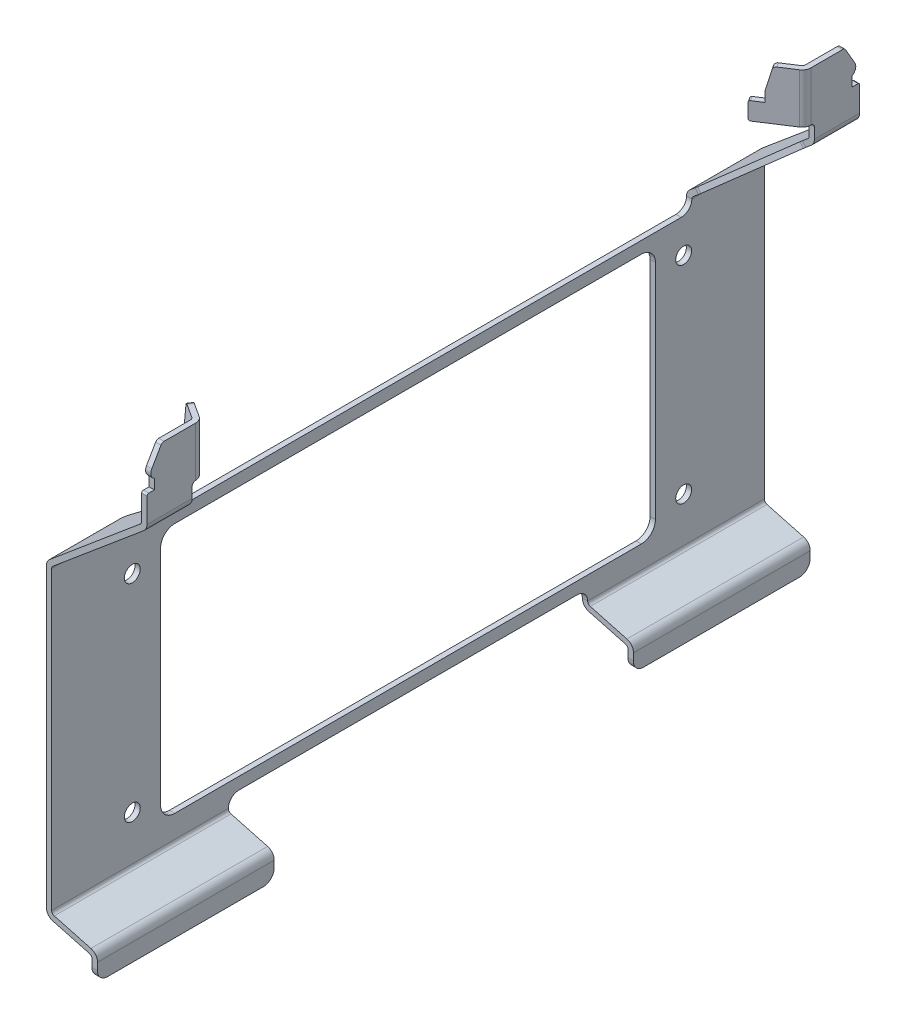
ISO-10303-21;
HEADER;
FILE_DESCRIPTION(('STEP AP214'),'2;1');
FILE_NAME('part.step','',(''),(''),'','','');
FILE_SCHEMA(('AUTOMOTIVE_DESIGN { 1 0 10303 214 1 1 1 1 }'));
ENDSEC;
DATA;
#1=APPLICATION_CONTEXT('core data for automotive mechanical design processes');
#2=APPLICATION_PROTOCOL_DEFINITION('international standard','automotive_design',2000,#1);
#3=PRODUCT_CONTEXT('',#1,'mechanical');
#4=PRODUCT('Part','Part','',(#3));
#5=PRODUCT_RELATED_PRODUCT_CATEGORY('part','',(#4));
#6=PRODUCT_DEFINITION_FORMATION('','',#4);
#7=PRODUCT_DEFINITION_CONTEXT('part definition',#1,'design');
#8=PRODUCT_DEFINITION('design','',#6,#7);
#9=PRODUCT_DEFINITION_SHAPE('','',#8);
#10=(LENGTH_UNIT() NAMED_UNIT(*) SI_UNIT(.MILLI.,.METRE.));
#11=(NAMED_UNIT(*) PLANE_ANGLE_UNIT() SI_UNIT($,.RADIAN.));
#12=(NAMED_UNIT(*) SI_UNIT($,.STERADIAN.) SOLID_ANGLE_UNIT());
#13=UNCERTAINTY_MEASURE_WITH_UNIT(LENGTH_MEASURE(1.E-05),#10,'distance_accuracy_value','');
#14=(GEOMETRIC_REPRESENTATION_CONTEXT(3) GLOBAL_UNCERTAINTY_ASSIGNED_CONTEXT((#13)) GLOBAL_UNIT_ASSIGNED_CONTEXT((#10,
#11,#12)) REPRESENTATION_CONTEXT('',''));
#15=CARTESIAN_POINT('',(0.,0.,0.));
#16=DIRECTION('',(0.,0.,1.));
#17=DIRECTION('',(1.,0.,0.));
#18=AXIS2_PLACEMENT_3D('',#15,#16,#17);
#19=CARTESIAN_POINT('',(19.5516154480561,78.1102952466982,18.1837446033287));
#20=DIRECTION('',(0.544639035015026,0.,0.838670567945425));
#21=DIRECTION('',(0.838670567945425,0.,-0.544639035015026));
#22=AXIS2_PLACEMENT_3D('',#19,#20,#21);
#23=CYLINDRICAL_SURFACE('',#22,0.500000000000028);
#24=DIRECTION('',(0.544639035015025,0.,0.838670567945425));
#25=VECTOR('',#24,1.);
#26=CARTESIAN_POINT('',(19.1322801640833,78.1102952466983,18.456064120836));
#27=LINE('',#26,#25);
#28=CARTESIAN_POINT('',(19.9492387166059,78.1102952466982,19.7140699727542));
#29=VERTEX_POINT('',#28);
#30=CARTESIAN_POINT('',(19.1322801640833,78.1102952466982,18.4560641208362));
#31=VERTEX_POINT('',#30);
#32=EDGE_CURVE('E638',#29,#31,#27,.F.);
#33=ORIENTED_EDGE('',*,*,#32,.F.);
#34=CARTESIAN_POINT('',(20.3685740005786,78.1102952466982,19.4417504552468));
#35=DIRECTION('',(0.544639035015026,0.,0.838670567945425));
#36=DIRECTION('',(0.838670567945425,0.,-0.544639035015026));
#37=AXIS2_PLACEMENT_3D('',#34,#35,#36);
#38=CIRCLE('',#37,0.500000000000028);
#39=CARTESIAN_POINT('',(19.9635272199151,78.2397047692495,19.7047909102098));
#40=VERTEX_POINT('',#39);
#41=EDGE_CURVE('E20',#29,#40,#38,.F.);
#42=ORIENTED_EDGE('',*,*,#41,.T.);
#43=DIRECTION('',(0.544639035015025,0.,0.838670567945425));
#44=VECTOR('',#43,1.);
#45=CARTESIAN_POINT('',(19.1465686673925,78.2397047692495,18.4467850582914));
#46=LINE('',#45,#44);
#47=CARTESIAN_POINT('',(19.1465686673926,78.2397047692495,18.4467850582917));
#48=VERTEX_POINT('',#47);
#49=EDGE_CURVE('E635',#48,#40,#46,.T.);
#50=ORIENTED_EDGE('',*,*,#49,.F.);
#51=CARTESIAN_POINT('',(19.5516154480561,78.1102952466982,18.1837446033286));
#52=DIRECTION('',(0.544639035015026,0.,0.838670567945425));
#53=DIRECTION('',(0.838670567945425,0.,-0.544639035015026));
#54=AXIS2_PLACEMENT_3D('',#51,#52,#53);
#55=CIRCLE('',#54,0.500000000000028);
#56=EDGE_CURVE('E1128',#48,#31,#55,.T.);
#57=ORIENTED_EDGE('',*,*,#56,.T.);
#58=EDGE_LOOP('',(#33,#42,#50,#57));
#59=FACE_BOUND('',#58,.T.);
#60=ADVANCED_FACE('F17',(#59),#23,.T.);
#61=CARTESIAN_POINT('',(16.616268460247,74.6102952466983,20.0899812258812));
#62=DIRECTION('',(0.544639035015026,0.,0.838670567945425));
#63=DIRECTION('',(0.838670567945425,0.,-0.544639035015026));
#64=AXIS2_PLACEMENT_3D('',#61,#62,#63);
#65=CYLINDRICAL_SURFACE('',#64,0.500000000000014);
#66=DIRECTION('',(0.544639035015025,0.,0.838670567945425));
#67=VECTOR('',#66,1.);
#68=CARTESIAN_POINT('',(16.1969331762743,74.6102952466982,20.3623007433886));
#69=LINE('',#68,#67);
#70=CARTESIAN_POINT('',(17.0138917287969,74.6102952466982,21.6203065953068));
#71=VERTEX_POINT('',#70);
#72=CARTESIAN_POINT('',(16.1969331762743,74.6102952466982,20.3623007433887));
#73=VERTEX_POINT('',#72);
#74=EDGE_CURVE('E714',#71,#73,#69,.F.);
#75=ORIENTED_EDGE('',*,*,#74,.F.);
#76=CARTESIAN_POINT('',(17.4332270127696,74.6102952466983,21.3479870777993));
#77=DIRECTION('',(0.544639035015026,0.,0.838670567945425));
#78=DIRECTION('',(0.838670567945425,0.,-0.544639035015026));
#79=AXIS2_PLACEMENT_3D('',#76,#77,#78);
#80=CIRCLE('',#79,0.500000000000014);
#81=CARTESIAN_POINT('',(17.4332270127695,75.1102952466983,21.3479870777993));
#82=VERTEX_POINT('',#81);
#83=EDGE_CURVE('E640',#71,#82,#80,.F.);
#84=ORIENTED_EDGE('',*,*,#83,.T.);
#85=DIRECTION('',(0.544639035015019,0.,0.838670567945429));
#86=VECTOR('',#85,1.);
#87=CARTESIAN_POINT('',(16.616268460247,75.1102952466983,20.0899812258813));
#88=LINE('',#87,#86);
#89=CARTESIAN_POINT('',(16.6162684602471,75.1102952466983,20.0899812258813));
#90=VERTEX_POINT('',#89);
#91=EDGE_CURVE('E718',#90,#82,#88,.T.);
#92=ORIENTED_EDGE('',*,*,#91,.F.);
#93=CARTESIAN_POINT('',(16.6162684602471,74.6102952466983,20.0899812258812));
#94=DIRECTION('',(0.544639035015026,0.,0.838670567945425));
#95=DIRECTION('',(0.838670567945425,0.,-0.544639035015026));
#96=AXIS2_PLACEMENT_3D('',#93,#94,#95);
#97=CIRCLE('',#96,0.500000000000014);
#98=EDGE_CURVE('E1126',#90,#73,#97,.T.);
#99=ORIENTED_EDGE('',*,*,#98,.T.);
#100=EDGE_LOOP('',(#75,#84,#92,#99));
#101=FACE_BOUND('',#100,.T.);
#102=ADVANCED_FACE('F1146',(#101),#65,.T.);
#103=CARTESIAN_POINT('',(16.616268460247,70.6102952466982,20.0899812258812));
#104=DIRECTION('',(0.544639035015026,0.,0.838670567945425));
#105=DIRECTION('',(0.838670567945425,0.,-0.544639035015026));
#106=AXIS2_PLACEMENT_3D('',#103,#104,#105);
#107=CYLINDRICAL_SURFACE('',#106,0.5);
#108=DIRECTION('',(-0.544639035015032,0.,-0.838670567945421));
#109=VECTOR('',#108,1.);
#110=CARTESIAN_POINT('',(17.4332270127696,70.1102952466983,21.3479870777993));
#111=LINE('',#110,#109);
#112=CARTESIAN_POINT('',(17.4332270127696,70.1102952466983,21.3479870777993));
#113=VERTEX_POINT('',#112);
#114=CARTESIAN_POINT('',(16.616268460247,70.1102952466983,20.0899812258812));
#115=VERTEX_POINT('',#114);
#116=EDGE_CURVE('E709',#113,#115,#111,.T.);
#117=ORIENTED_EDGE('',*,*,#116,.F.);
#118=CARTESIAN_POINT('',(17.4332270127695,70.6102952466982,21.3479870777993));
#119=DIRECTION('',(0.544639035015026,0.,0.838670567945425));
#120=DIRECTION('',(0.838670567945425,0.,-0.544639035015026));
#121=AXIS2_PLACEMENT_3D('',#118,#119,#120);
#122=CIRCLE('',#121,0.5);
#123=CARTESIAN_POINT('',(17.0138917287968,70.6102952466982,21.6203065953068));
#124=VERTEX_POINT('',#123);
#125=EDGE_CURVE('E1142',#113,#124,#122,.F.);
#126=ORIENTED_EDGE('',*,*,#125,.T.);
#127=DIRECTION('',(0.544639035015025,0.,0.838670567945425));
#128=VECTOR('',#127,1.);
#129=CARTESIAN_POINT('',(16.1969331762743,70.6102952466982,20.3623007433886));
#130=LINE('',#129,#128);
#131=CARTESIAN_POINT('',(16.1969331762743,70.6102952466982,20.3623007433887));
#132=VERTEX_POINT('',#131);
#133=EDGE_CURVE('E713',#132,#124,#130,.T.);
#134=ORIENTED_EDGE('',*,*,#133,.F.);
#135=CARTESIAN_POINT('',(16.616268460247,70.6102952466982,20.0899812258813));
#136=DIRECTION('',(0.544639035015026,0.,0.838670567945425));
#137=DIRECTION('',(0.838670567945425,0.,-0.544639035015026));
#138=AXIS2_PLACEMENT_3D('',#135,#136,#137);
#139=CIRCLE('',#138,0.5);
#140=EDGE_CURVE('E739',#132,#115,#139,.T.);
#141=ORIENTED_EDGE('',*,*,#140,.T.);
#142=EDGE_LOOP('',(#117,#126,#134,#141));
#143=FACE_BOUND('',#142,.T.);
#144=ADVANCED_FACE('F2564',(#143),#107,.T.);
#145=CARTESIAN_POINT('',(16.616268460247,70.6102952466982,181.560018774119));
#146=DIRECTION('',(0.544639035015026,0.,-0.838670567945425));
#147=DIRECTION('',(-0.838670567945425,0.,-0.544639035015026));
#148=AXIS2_PLACEMENT_3D('',#145,#146,#147);
#149=CYLINDRICAL_SURFACE('',#148,0.5);
#150=DIRECTION('',(0.544639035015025,0.,-0.838670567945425));
#151=VECTOR('',#150,1.);
#152=CARTESIAN_POINT('',(16.1969331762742,70.6102952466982,181.287699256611));
#153=LINE('',#152,#151);
#154=CARTESIAN_POINT('',(16.1969331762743,70.6102952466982,181.287699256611));
#155=VERTEX_POINT('',#154);
#156=CARTESIAN_POINT('',(17.0138917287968,70.6102952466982,180.029693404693));
#157=VERTEX_POINT('',#156);
#158=EDGE_CURVE('E699',#155,#157,#153,.T.);
#159=ORIENTED_EDGE('',*,*,#158,.T.);
#160=CARTESIAN_POINT('',(17.4332270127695,70.6102952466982,180.302012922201));
#161=DIRECTION('',(0.544639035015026,0.,-0.838670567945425));
#162=DIRECTION('',(-0.838670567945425,0.,-0.544639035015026));
#163=AXIS2_PLACEMENT_3D('',#160,#161,#162);
#164=CIRCLE('',#163,0.5);
#165=CARTESIAN_POINT('',(17.4332270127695,70.1102952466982,180.302012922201));
#166=VERTEX_POINT('',#165);
#167=EDGE_CURVE('E1140',#157,#166,#164,.F.);
#168=ORIENTED_EDGE('',*,*,#167,.T.);
#169=DIRECTION('',(-0.544639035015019,0.,0.838670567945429));
#170=VECTOR('',#169,1.);
#171=CARTESIAN_POINT('',(17.4332270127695,70.1102952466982,180.3020129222));
#172=LINE('',#171,#170);
#173=CARTESIAN_POINT('',(16.616268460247,70.1102952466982,181.560018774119));
#174=VERTEX_POINT('',#173);
#175=EDGE_CURVE('E703',#166,#174,#172,.T.);
#176=ORIENTED_EDGE('',*,*,#175,.T.);
#177=CARTESIAN_POINT('',(16.616268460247,70.6102952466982,181.560018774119));
#178=DIRECTION('',(0.544639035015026,0.,-0.838670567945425));
#179=DIRECTION('',(-0.838670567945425,0.,-0.544639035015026));
#180=AXIS2_PLACEMENT_3D('',#177,#178,#179);
#181=CIRCLE('',#180,0.5);
#182=EDGE_CURVE('E1134',#174,#155,#181,.T.);
#183=ORIENTED_EDGE('',*,*,#182,.T.);
#184=EDGE_LOOP('',(#159,#168,#176,#183));
#185=FACE_BOUND('',#184,.T.);
#186=ADVANCED_FACE('F2555',(#185),#149,.T.);
#187=CARTESIAN_POINT('',(16.616268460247,74.6102952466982,181.560018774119));
#188=DIRECTION('',(0.544639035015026,0.,-0.838670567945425));
#189=DIRECTION('',(-0.838670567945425,0.,-0.544639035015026));
#190=AXIS2_PLACEMENT_3D('',#187,#188,#189);
#191=CYLINDRICAL_SURFACE('',#190,0.500000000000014);
#192=DIRECTION('',(0.544639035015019,0.,-0.838670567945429));
#193=VECTOR('',#192,1.);
#194=CARTESIAN_POINT('',(16.616268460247,75.1102952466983,181.560018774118));
#195=LINE('',#194,#193);
#196=CARTESIAN_POINT('',(16.616268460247,75.1102952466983,181.560018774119));
#197=VERTEX_POINT('',#196);
#198=CARTESIAN_POINT('',(17.4332270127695,75.1102952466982,180.3020129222));
#199=VERTEX_POINT('',#198);
#200=EDGE_CURVE('E694',#197,#199,#195,.T.);
#201=ORIENTED_EDGE('',*,*,#200,.T.);
#202=CARTESIAN_POINT('',(17.4332270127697,74.6102952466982,180.3020129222));
#203=DIRECTION('',(0.544639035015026,0.,-0.838670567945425));
#204=DIRECTION('',(-0.838670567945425,0.,-0.544639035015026));
#205=AXIS2_PLACEMENT_3D('',#202,#203,#204);
#206=CIRCLE('',#205,0.500000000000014);
#207=CARTESIAN_POINT('',(17.0138917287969,74.6102952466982,180.029693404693));
#208=VERTEX_POINT('',#207);
#209=EDGE_CURVE('E1138',#199,#208,#206,.F.);
#210=ORIENTED_EDGE('',*,*,#209,.T.);
#211=DIRECTION('',(0.544639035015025,0.,-0.838670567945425));
#212=VECTOR('',#211,1.);
#213=CARTESIAN_POINT('',(16.1969331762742,74.6102952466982,181.287699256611));
#214=LINE('',#213,#212);
#215=CARTESIAN_POINT('',(16.1969331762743,74.6102952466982,181.287699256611));
#216=VERTEX_POINT('',#215);
#217=EDGE_CURVE('E708',#208,#216,#214,.F.);
#218=ORIENTED_EDGE('',*,*,#217,.T.);
#219=CARTESIAN_POINT('',(16.616268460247,74.6102952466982,181.560018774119));
#220=DIRECTION('',(0.544639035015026,0.,-0.838670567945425));
#221=DIRECTION('',(-0.838670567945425,0.,-0.544639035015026));
#222=AXIS2_PLACEMENT_3D('',#219,#220,#221);
#223=CIRCLE('',#222,0.500000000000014);
#224=EDGE_CURVE('E1132',#216,#197,#223,.T.);
#225=ORIENTED_EDGE('',*,*,#224,.T.);
#226=EDGE_LOOP('',(#201,#210,#218,#225));
#227=FACE_BOUND('',#226,.T.);
#228=ADVANCED_FACE('F2546',(#227),#191,.T.);
#229=CARTESIAN_POINT('',(19.551615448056,78.1102952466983,183.466255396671));
#230=DIRECTION('',(0.544639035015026,0.,-0.838670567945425));
#231=DIRECTION('',(-0.838670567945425,0.,-0.544639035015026));
#232=AXIS2_PLACEMENT_3D('',#229,#230,#231);
#233=CYLINDRICAL_SURFACE('',#232,0.500000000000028);
#234=DIRECTION('',(0.544639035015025,0.,-0.838670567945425));
#235=VECTOR('',#234,1.);
#236=CARTESIAN_POINT('',(19.1465686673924,78.2397047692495,183.203214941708));
#237=LINE('',#236,#235);
#238=CARTESIAN_POINT('',(19.1465686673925,78.2397047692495,183.203214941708));
#239=VERTEX_POINT('',#238);
#240=CARTESIAN_POINT('',(19.963527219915,78.2397047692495,181.94520908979));
#241=VERTEX_POINT('',#240);
#242=EDGE_CURVE('E684',#239,#241,#237,.T.);
#243=ORIENTED_EDGE('',*,*,#242,.T.);
#244=CARTESIAN_POINT('',(20.3685740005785,78.1102952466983,182.208249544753));
#245=DIRECTION('',(0.544639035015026,0.,-0.838670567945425));
#246=DIRECTION('',(-0.838670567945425,0.,-0.544639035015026));
#247=AXIS2_PLACEMENT_3D('',#244,#245,#246);
#248=CIRCLE('',#247,0.500000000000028);
#249=CARTESIAN_POINT('',(19.9492387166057,78.1102952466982,181.935930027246));
#250=VERTEX_POINT('',#249);
#251=EDGE_CURVE('E1136',#241,#250,#248,.F.);
#252=ORIENTED_EDGE('',*,*,#251,.T.);
#253=DIRECTION('',(0.544639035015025,0.,-0.838670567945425));
#254=VECTOR('',#253,1.);
#255=CARTESIAN_POINT('',(19.1322801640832,78.1102952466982,183.193935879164));
#256=LINE('',#255,#254);
#257=CARTESIAN_POINT('',(19.1322801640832,78.1102952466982,183.193935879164));
#258=VERTEX_POINT('',#257);
#259=EDGE_CURVE('E697',#250,#258,#256,.F.);
#260=ORIENTED_EDGE('',*,*,#259,.T.);
#261=CARTESIAN_POINT('',(19.551615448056,78.1102952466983,183.466255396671));
#262=DIRECTION('',(0.544639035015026,0.,-0.838670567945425));
#263=DIRECTION('',(-0.838670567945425,0.,-0.544639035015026));
#264=AXIS2_PLACEMENT_3D('',#261,#262,#263);
#265=CIRCLE('',#264,0.500000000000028);
#266=EDGE_CURVE('E1130',#258,#239,#265,.T.);
#267=ORIENTED_EDGE('',*,*,#266,.T.);
#268=EDGE_LOOP('',(#243,#252,#260,#267));
#269=FACE_BOUND('',#268,.T.);
#270=ADVANCED_FACE('F2537',(#269),#233,.T.);
#271=CARTESIAN_POINT('',(38.0443014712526,84.1423460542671,195.475546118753));
#272=DIRECTION('',(0.544639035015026,0.,-0.838670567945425));
#273=DIRECTION('',(-0.838670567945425,0.,-0.544639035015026));
#274=AXIS2_PLACEMENT_3D('',#271,#272,#273);
#275=PLANE('',#274);
#276=DIRECTION('',(0.838670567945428,0.,0.544639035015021));
#277=VECTOR('',#276,1.);
#278=CARTESIAN_POINT('',(21.1165512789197,84.1423460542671,184.482536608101));
#279=LINE('',#278,#277);
#280=CARTESIAN_POINT('',(21.1165512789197,84.1423460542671,184.482536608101));
#281=VERTEX_POINT('',#280);
#282=CARTESIAN_POINT('',(25.0105507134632,84.1423460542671,187.011329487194));
#283=VERTEX_POINT('',#282);
#284=EDGE_CURVE('E706',#281,#283,#279,.T.);
#285=ORIENTED_EDGE('',*,*,#284,.F.);
#286=CARTESIAN_POINT('',(21.1165512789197,83.1423460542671,184.482536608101));
#287=DIRECTION('',(0.544639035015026,0.,-0.838670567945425));
#288=DIRECTION('',(-0.838670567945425,0.,-0.544639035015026));
#289=AXIS2_PLACEMENT_3D('',#286,#287,#288);
#290=CIRCLE('',#289,1.);
#291=CARTESIAN_POINT('',(20.3064577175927,83.4011650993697,183.956455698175));
#292=VERTEX_POINT('',#291);
#293=EDGE_CURVE('E680',#292,#281,#290,.T.);
#294=ORIENTED_EDGE('',*,*,#293,.F.);
#295=DIRECTION('',(0.217063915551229,0.965925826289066,0.140962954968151));
#296=VECTOR('',#295,1.);
#297=CARTESIAN_POINT('',(-11.8854705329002,-59.8516404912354,163.050773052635));
#298=LINE('',#297,#296);
#299=EDGE_CURVE('E687',#292,#239,#298,.F.);
#300=ORIENTED_EDGE('',*,*,#299,.T.);
#301=ORIENTED_EDGE('',*,*,#266,.F.);
#302=DIRECTION('',(0.,1.,0.));
#303=VECTOR('',#302,1.);
#304=CARTESIAN_POINT('',(19.1322801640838,4.74419960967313,183.193935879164));
#305=LINE('',#304,#303);
#306=CARTESIAN_POINT('',(19.1322801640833,75.1102952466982,183.193935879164));
#307=VERTEX_POINT('',#306);
#308=EDGE_CURVE('E691',#258,#307,#305,.F.);
#309=ORIENTED_EDGE('',*,*,#308,.T.);
#310=DIRECTION('',(-0.838670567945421,0.,-0.544639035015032));
#311=VECTOR('',#310,1.);
#312=CARTESIAN_POINT('',(19.1322801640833,75.1102952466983,183.193935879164));
#313=LINE('',#312,#311);
#314=EDGE_CURVE('E698',#307,#197,#313,.T.);
#315=ORIENTED_EDGE('',*,*,#314,.T.);
#316=ORIENTED_EDGE('',*,*,#224,.F.);
#317=DIRECTION('',(0.,1.,0.));
#318=VECTOR('',#317,1.);
#319=CARTESIAN_POINT('',(16.1969331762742,4.74419960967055,181.287699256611));
#320=LINE('',#319,#318);
#321=EDGE_CURVE('E702',#216,#155,#320,.F.);
#322=ORIENTED_EDGE('',*,*,#321,.T.);
#323=ORIENTED_EDGE('',*,*,#182,.F.);
#324=DIRECTION('',(0.838670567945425,0.,0.544639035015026));
#325=VECTOR('',#324,1.);
#326=CARTESIAN_POINT('',(16.616268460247,70.1102952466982,181.560018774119));
#327=LINE('',#326,#325);
#328=CARTESIAN_POINT('',(25.0105507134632,70.1102952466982,187.011329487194));
#329=VERTEX_POINT('',#328);
#330=EDGE_CURVE('E705',#174,#329,#327,.T.);
#331=ORIENTED_EDGE('',*,*,#330,.T.);
#332=DIRECTION('',(0.,1.,0.));
#333=VECTOR('',#332,1.);
#334=CARTESIAN_POINT('',(25.0105506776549,62.9073399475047,187.011329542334));
#335=LINE('',#334,#333);
#336=EDGE_CURVE('E673',#329,#283,#335,.T.);
#337=ORIENTED_EDGE('',*,*,#336,.T.);
#338=EDGE_LOOP('',(#285,#294,#300,#301,#309,#315,#316,#322,#323,#331,#337));
#339=FACE_BOUND('',#338,.T.);
#340=ADVANCED_FACE('F2528',(#339),#275,.F.);
#341=CARTESIAN_POINT('',(-131.073618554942,84.1423460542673,116.000915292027));
#342=DIRECTION('',(0.544639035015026,0.,0.838670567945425));
#343=DIRECTION('',(0.838670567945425,0.,-0.544639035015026));
#344=AXIS2_PLACEMENT_3D('',#341,#342,#343);
#345=PLANE('',#344);
#346=DIRECTION('',(0.,-1.,0.));
#347=VECTOR('',#346,1.);
#348=CARTESIAN_POINT('',(25.0105507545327,91.3453013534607,14.6386705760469));
#349=LINE('',#348,#347);
#350=CARTESIAN_POINT('',(25.0105507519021,84.1423460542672,14.6386705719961));
#351=VERTEX_POINT('',#350);
#352=CARTESIAN_POINT('',(25.0105507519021,70.1102952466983,14.6386705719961));
#353=VERTEX_POINT('',#352);
#354=EDGE_CURVE('E676',#351,#353,#349,.T.);
#355=ORIENTED_EDGE('',*,*,#354,.T.);
#356=DIRECTION('',(0.838670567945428,0.,-0.544639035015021));
#357=VECTOR('',#356,1.);
#358=CARTESIAN_POINT('',(16.616268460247,70.1102952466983,20.0899812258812));
#359=LINE('',#358,#357);
#360=EDGE_CURVE('E712',#115,#353,#359,.T.);
#361=ORIENTED_EDGE('',*,*,#360,.F.);
#362=ORIENTED_EDGE('',*,*,#140,.F.);
#363=DIRECTION('',(0.,1.,0.));
#364=VECTOR('',#363,1.);
#365=CARTESIAN_POINT('',(16.1969331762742,4.74419960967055,20.3623007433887));
#366=LINE('',#365,#364);
#367=EDGE_CURVE('E717',#73,#132,#366,.F.);
#368=ORIENTED_EDGE('',*,*,#367,.F.);
#369=ORIENTED_EDGE('',*,*,#98,.F.);
#370=DIRECTION('',(-0.838670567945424,0.,0.544639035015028));
#371=VECTOR('',#370,1.);
#372=CARTESIAN_POINT('',(19.1322801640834,75.1102952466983,18.4560641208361));
#373=LINE('',#372,#371);
#374=CARTESIAN_POINT('',(19.1322801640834,75.1102952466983,18.4560641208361));
#375=VERTEX_POINT('',#374);
#376=EDGE_CURVE('E723',#375,#90,#373,.T.);
#377=ORIENTED_EDGE('',*,*,#376,.F.);
#378=DIRECTION('',(0.,1.,0.));
#379=VECTOR('',#378,1.);
#380=CARTESIAN_POINT('',(19.1322801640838,4.74419960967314,18.4560641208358));
#381=LINE('',#380,#379);
#382=EDGE_CURVE('E727',#31,#375,#381,.F.);
#383=ORIENTED_EDGE('',*,*,#382,.F.);
#384=ORIENTED_EDGE('',*,*,#56,.F.);
#385=DIRECTION('',(0.217063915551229,0.965925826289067,-0.140962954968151));
#386=VECTOR('',#385,1.);
#387=CARTESIAN_POINT('',(-11.8854705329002,-59.8516404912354,38.5992269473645));
#388=LINE('',#387,#386);
#389=CARTESIAN_POINT('',(20.3064577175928,83.4011650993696,17.6935443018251));
#390=VERTEX_POINT('',#389);
#391=EDGE_CURVE('E648',#390,#48,#388,.F.);
#392=ORIENTED_EDGE('',*,*,#391,.F.);
#393=CARTESIAN_POINT('',(21.1165512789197,83.1423460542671,17.1674633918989));
#394=DIRECTION('',(0.544639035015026,0.,0.838670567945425));
#395=DIRECTION('',(0.838670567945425,0.,-0.544639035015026));
#396=AXIS2_PLACEMENT_3D('',#393,#394,#395);
#397=CIRCLE('',#396,1.);
#398=CARTESIAN_POINT('',(21.1165512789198,84.1423460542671,17.1674633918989));
#399=VERTEX_POINT('',#398);
#400=EDGE_CURVE('E732',#399,#390,#397,.T.);
#401=ORIENTED_EDGE('',*,*,#400,.F.);
#402=DIRECTION('',(-0.838670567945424,0.,0.544639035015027));
#403=VECTOR('',#402,1.);
#404=CARTESIAN_POINT('',(25.0105507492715,84.1423460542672,14.6386705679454));
#405=LINE('',#404,#403);
#406=EDGE_CURVE('E737',#351,#399,#405,.T.);
#407=ORIENTED_EDGE('',*,*,#406,.F.);
#408=EDGE_LOOP('',(#355,#361,#362,#368,#369,#377,#383,#384,#392,#401,#407));
#409=FACE_BOUND('',#408,.T.);
#410=ADVANCED_FACE('F2519',(#409),#345,.F.);
#411=CARTESIAN_POINT('',(21.1165512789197,83.1423460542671,17.1674633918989));
#412=DIRECTION('',(0.544639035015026,0.,0.838670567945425));
#413=DIRECTION('',(0.838670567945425,0.,-0.544639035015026));
#414=AXIS2_PLACEMENT_3D('',#411,#412,#413);
#415=CYLINDRICAL_SURFACE('',#414,1.);
#416=DIRECTION('',(0.544639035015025,0.,0.838670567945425));
#417=VECTOR('',#416,1.);
#418=CARTESIAN_POINT('',(20.3064577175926,83.4011650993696,17.6935443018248));
#419=LINE('',#418,#417);
#420=CARTESIAN_POINT('',(21.1234162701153,83.4011650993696,18.9515501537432));
#421=VERTEX_POINT('',#420);
#422=EDGE_CURVE('E731',#421,#390,#419,.F.);
#423=ORIENTED_EDGE('',*,*,#422,.F.);
#424=CARTESIAN_POINT('',(21.9335098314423,83.1423460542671,18.4254692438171));
#425=DIRECTION('',(0.544639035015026,0.,0.838670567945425));
#426=DIRECTION('',(0.838670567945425,0.,-0.544639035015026));
#427=AXIS2_PLACEMENT_3D('',#424,#425,#426);
#428=CIRCLE('',#427,1.);
#429=CARTESIAN_POINT('',(21.9335098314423,84.1423460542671,18.425469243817));
#430=VERTEX_POINT('',#429);
#431=EDGE_CURVE('E653',#430,#421,#428,.T.);
#432=ORIENTED_EDGE('',*,*,#431,.F.);
#433=DIRECTION('',(0.544639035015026,0.,0.838670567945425));
#434=VECTOR('',#433,1.);
#435=CARTESIAN_POINT('',(21.1165512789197,84.1423460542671,17.1674633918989));
#436=LINE('',#435,#434);
#437=EDGE_CURVE('E734',#430,#399,#436,.F.);
#438=ORIENTED_EDGE('',*,*,#437,.T.);
#439=ORIENTED_EDGE('',*,*,#400,.T.);
#440=EDGE_LOOP('',(#423,#432,#438,#439));
#441=FACE_BOUND('',#440,.T.);
#442=ADVANCED_FACE('F2511',(#441),#415,.T.);
#443=CARTESIAN_POINT('',(-11.8854705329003,-59.8516404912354,38.5992269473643));
#444=DIRECTION('',(-0.810093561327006,0.258819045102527,0.526080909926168));
#445=DIRECTION('',(0.544639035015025,0.,0.838670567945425));
#446=AXIS2_PLACEMENT_3D('',#443,#444,#445);
#447=PLANE('',#446);
#448=ORIENTED_EDGE('',*,*,#49,.T.);
#449=DIRECTION('',(-0.217063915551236,-0.965925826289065,0.140962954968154));
#450=VECTOR('',#449,1.);
#451=CARTESIAN_POINT('',(21.1234162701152,83.4011650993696,18.9515501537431));
#452=LINE('',#451,#450);
#453=EDGE_CURVE('E645',#421,#40,#452,.T.);
#454=ORIENTED_EDGE('',*,*,#453,.F.);
#455=ORIENTED_EDGE('',*,*,#422,.T.);
#456=ORIENTED_EDGE('',*,*,#391,.T.);
#457=EDGE_LOOP('',(#448,#454,#455,#456));
#458=FACE_BOUND('',#457,.T.);
#459=ADVANCED_FACE('F643',(#458),#447,.T.);
#460=CARTESIAN_POINT('',(19.1322801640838,4.74419960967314,18.4560641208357));
#461=DIRECTION('',(-0.838670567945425,0.,0.544639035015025));
#462=DIRECTION('',(0.544639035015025,0.,0.838670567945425));
#463=AXIS2_PLACEMENT_3D('',#460,#461,#462);
#464=PLANE('',#463);
#465=DIRECTION('',(-0.544639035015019,0.,-0.838670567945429));
#466=VECTOR('',#465,1.);
#467=CARTESIAN_POINT('',(19.9492387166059,75.1102952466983,19.7140699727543));
#468=LINE('',#467,#466);
#469=CARTESIAN_POINT('',(19.9492387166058,75.1102952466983,19.7140699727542));
#470=VERTEX_POINT('',#469);
#471=EDGE_CURVE('E724',#470,#375,#468,.T.);
#472=ORIENTED_EDGE('',*,*,#471,.F.);
#473=DIRECTION('',(0.,1.,0.));
#474=VECTOR('',#473,1.);
#475=CARTESIAN_POINT('',(19.9492387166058,84.1423460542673,19.7140699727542));
#476=LINE('',#475,#474);
#477=EDGE_CURVE('E654',#29,#470,#476,.F.);
#478=ORIENTED_EDGE('',*,*,#477,.F.);
#479=ORIENTED_EDGE('',*,*,#32,.T.);
#480=ORIENTED_EDGE('',*,*,#382,.T.);
#481=EDGE_LOOP('',(#472,#478,#479,#480));
#482=FACE_BOUND('',#481,.T.);
#483=ADVANCED_FACE('F2495',(#482),#464,.T.);
#484=CARTESIAN_POINT('',(-214.067941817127,75.1102952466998,169.898059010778));
#485=DIRECTION('',(0.,1.,0.));
#486=DIRECTION('',(-1.,0.,0.));
#487=AXIS2_PLACEMENT_3D('',#484,#485,#486);
#488=PLANE('',#487);
#489=ORIENTED_EDGE('',*,*,#91,.T.);
#490=DIRECTION('',(0.838670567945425,0.,-0.544639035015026));
#491=VECTOR('',#490,1.);
#492=CARTESIAN_POINT('',(-130.25666000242,75.1102952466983,117.258921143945));
#493=LINE('',#492,#491);
#494=EDGE_CURVE('E656',#470,#82,#493,.F.);
#495=ORIENTED_EDGE('',*,*,#494,.F.);
#496=ORIENTED_EDGE('',*,*,#471,.T.);
#497=ORIENTED_EDGE('',*,*,#376,.T.);
#498=EDGE_LOOP('',(#489,#495,#496,#497));
#499=FACE_BOUND('',#498,.T.);
#500=ADVANCED_FACE('F1152',(#499),#488,.T.);
#501=CARTESIAN_POINT('',(16.1969331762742,4.74419960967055,20.3623007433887));
#502=DIRECTION('',(-0.838670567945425,0.,0.544639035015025));
#503=DIRECTION('',(0.544639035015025,0.,0.838670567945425));
#504=AXIS2_PLACEMENT_3D('',#501,#502,#503);
#505=PLANE('',#504);
#506=ORIENTED_EDGE('',*,*,#133,.T.);
#507=DIRECTION('',(0.,1.,0.));
#508=VECTOR('',#507,1.);
#509=CARTESIAN_POINT('',(17.0138917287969,84.1423460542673,21.6203065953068));
#510=LINE('',#509,#508);
#511=EDGE_CURVE('E1154',#71,#124,#510,.F.);
#512=ORIENTED_EDGE('',*,*,#511,.F.);
#513=ORIENTED_EDGE('',*,*,#74,.T.);
#514=ORIENTED_EDGE('',*,*,#367,.T.);
#515=EDGE_LOOP('',(#506,#512,#513,#514));
#516=FACE_BOUND('',#515,.T.);
#517=ADVANCED_FACE('F2478',(#516),#505,.T.);
#518=CARTESIAN_POINT('',(16.1969331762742,4.74419960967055,181.287699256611));
#519=DIRECTION('',(0.838670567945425,0.,0.544639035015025));
#520=DIRECTION('',(0.544639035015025,0.,-0.838670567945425));
#521=AXIS2_PLACEMENT_3D('',#518,#519,#520);
#522=PLANE('',#521);
#523=ORIENTED_EDGE('',*,*,#321,.F.);
#524=ORIENTED_EDGE('',*,*,#217,.F.);
#525=DIRECTION('',(0.,1.,0.));
#526=VECTOR('',#525,1.);
#527=CARTESIAN_POINT('',(17.0138917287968,84.1423460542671,180.029693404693));
#528=LINE('',#527,#526);
#529=EDGE_CURVE('E1187',#157,#208,#528,.T.);
#530=ORIENTED_EDGE('',*,*,#529,.F.);
#531=ORIENTED_EDGE('',*,*,#158,.F.);
#532=EDGE_LOOP('',(#523,#524,#530,#531));
#533=FACE_BOUND('',#532,.T.);
#534=ADVANCED_FACE('F2469',(#533),#522,.F.);
#535=CARTESIAN_POINT('',(-214.067941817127,75.1102952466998,31.7519409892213));
#536=DIRECTION('',(0.,-1.,0.));
#537=DIRECTION('',(1.,0.,0.));
#538=AXIS2_PLACEMENT_3D('',#535,#536,#537);
#539=PLANE('',#538);
#540=ORIENTED_EDGE('',*,*,#314,.F.);
#541=DIRECTION('',(0.544639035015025,0.,-0.838670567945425));
#542=VECTOR('',#541,1.);
#543=CARTESIAN_POINT('',(19.1322801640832,75.1102952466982,183.193935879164));
#544=LINE('',#543,#542);
#545=CARTESIAN_POINT('',(19.9492387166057,75.1102952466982,181.935930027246));
#546=VERTEX_POINT('',#545);
#547=EDGE_CURVE('E688',#307,#546,#544,.T.);
#548=ORIENTED_EDGE('',*,*,#547,.T.);
#549=DIRECTION('',(-0.838670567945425,0.,-0.544639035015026));
#550=VECTOR('',#549,1.);
#551=CARTESIAN_POINT('',(38.8612600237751,75.1102952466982,194.217540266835));
#552=LINE('',#551,#550);
#553=EDGE_CURVE('E1190',#199,#546,#552,.F.);
#554=ORIENTED_EDGE('',*,*,#553,.F.);
#555=ORIENTED_EDGE('',*,*,#200,.F.);
#556=EDGE_LOOP('',(#540,#548,#554,#555));
#557=FACE_BOUND('',#556,.T.);
#558=ADVANCED_FACE('F2460',(#557),#539,.F.);
#559=CARTESIAN_POINT('',(19.1322801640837,4.74419960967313,183.193935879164));
#560=DIRECTION('',(0.838670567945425,0.,0.544639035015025));
#561=DIRECTION('',(0.544639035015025,0.,-0.838670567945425));
#562=AXIS2_PLACEMENT_3D('',#559,#560,#561);
#563=PLANE('',#562);
#564=ORIENTED_EDGE('',*,*,#308,.F.);
#565=ORIENTED_EDGE('',*,*,#259,.F.);
#566=DIRECTION('',(0.,1.,0.));
#567=VECTOR('',#566,1.);
#568=CARTESIAN_POINT('',(19.9492387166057,84.1423460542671,181.935930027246));
#569=LINE('',#568,#567);
#570=EDGE_CURVE('E1195',#546,#250,#569,.T.);
#571=ORIENTED_EDGE('',*,*,#570,.F.);
#572=ORIENTED_EDGE('',*,*,#547,.F.);
#573=EDGE_LOOP('',(#564,#565,#571,#572));
#574=FACE_BOUND('',#573,.T.);
#575=ADVANCED_FACE('F2451',(#574),#563,.F.);
#576=CARTESIAN_POINT('',(-11.8854705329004,-59.8516404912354,163.050773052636));
#577=DIRECTION('',(0.810093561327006,-0.258819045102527,0.526080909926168));
#578=DIRECTION('',(0.544639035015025,0.,-0.838670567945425));
#579=AXIS2_PLACEMENT_3D('',#576,#577,#578);
#580=PLANE('',#579);
#581=ORIENTED_EDGE('',*,*,#299,.F.);
#582=DIRECTION('',(0.544639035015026,0.,-0.838670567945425));
#583=VECTOR('',#582,1.);
#584=CARTESIAN_POINT('',(20.3064577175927,83.4011650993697,183.956455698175));
#585=LINE('',#584,#583);
#586=CARTESIAN_POINT('',(21.1234162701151,83.4011650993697,182.698449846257));
#587=VERTEX_POINT('',#586);
#588=EDGE_CURVE('E681',#587,#292,#585,.F.);
#589=ORIENTED_EDGE('',*,*,#588,.F.);
#590=DIRECTION('',(0.217063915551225,0.965925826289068,0.140962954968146));
#591=VECTOR('',#590,1.);
#592=CARTESIAN_POINT('',(19.963527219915,78.2397047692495,181.94520908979));
#593=LINE('',#592,#591);
#594=EDGE_CURVE('E1108',#241,#587,#593,.T.);
#595=ORIENTED_EDGE('',*,*,#594,.F.);
#596=ORIENTED_EDGE('',*,*,#242,.F.);
#597=EDGE_LOOP('',(#581,#589,#595,#596));
#598=FACE_BOUND('',#597,.T.);
#599=ADVANCED_FACE('F2442',(#598),#580,.F.);
#600=CARTESIAN_POINT('',(21.1165512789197,83.1423460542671,184.482536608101));
#601=DIRECTION('',(0.544639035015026,0.,-0.838670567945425));
#602=DIRECTION('',(-0.838670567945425,0.,-0.544639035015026));
#603=AXIS2_PLACEMENT_3D('',#600,#601,#602);
#604=CYLINDRICAL_SURFACE('',#603,1.);
#605=DIRECTION('',(0.544639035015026,0.,-0.838670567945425));
#606=VECTOR('',#605,1.);
#607=CARTESIAN_POINT('',(21.1165512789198,84.1423460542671,184.482536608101));
#608=LINE('',#607,#606);
#609=CARTESIAN_POINT('',(21.9335098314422,84.1423460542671,183.224530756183));
#610=VERTEX_POINT('',#609);
#611=EDGE_CURVE('E677',#281,#610,#608,.T.);
#612=ORIENTED_EDGE('',*,*,#611,.T.);
#613=CARTESIAN_POINT('',(21.9335098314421,83.1423460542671,183.224530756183));
#614=DIRECTION('',(0.544639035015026,0.,-0.838670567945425));
#615=DIRECTION('',(-0.838670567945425,0.,-0.544639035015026));
#616=AXIS2_PLACEMENT_3D('',#613,#614,#615);
#617=CIRCLE('',#616,1.);
#618=EDGE_CURVE('E1105',#587,#610,#617,.T.);
#619=ORIENTED_EDGE('',*,*,#618,.F.);
#620=ORIENTED_EDGE('',*,*,#588,.T.);
#621=ORIENTED_EDGE('',*,*,#293,.T.);
#622=EDGE_LOOP('',(#612,#619,#620,#621));
#623=FACE_BOUND('',#622,.T.);
#624=ADVANCED_FACE('F2433',(#623),#604,.T.);
#625=CARTESIAN_POINT('',(24.4659117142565,62.9073399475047,187.85));
#626=DIRECTION('',(0.,1.,0.));
#627=DIRECTION('',(0.,0.,1.));
#628=AXIS2_PLACEMENT_3D('',#625,#626,#627);
#629=CYLINDRICAL_SURFACE('',#628,0.999999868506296);
#630=CARTESIAN_POINT('',(24.4659117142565,84.1423460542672,187.85));
#631=DIRECTION('',(0.,1.,0.));
#632=DIRECTION('',(0.,0.,1.));
#633=AXIS2_PLACEMENT_3D('',#630,#631,#632);
#634=CIRCLE('',#633,0.999999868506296);
#635=CARTESIAN_POINT('',(25.4659116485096,84.1423460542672,187.85));
#636=VERTEX_POINT('',#635);
#637=EDGE_CURVE('E1102',#283,#636,#634,.F.);
#638=ORIENTED_EDGE('',*,*,#637,.F.);
#639=ORIENTED_EDGE('',*,*,#336,.F.);
#640=CARTESIAN_POINT('',(24.4659117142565,70.1102952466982,187.85));
#641=DIRECTION('',(0.,1.,0.));
#642=DIRECTION('',(0.,0.,1.));
#643=AXIS2_PLACEMENT_3D('',#640,#641,#642);
#644=CIRCLE('',#643,0.999999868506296);
#645=CARTESIAN_POINT('',(25.4659116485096,70.1102952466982,187.85));
#646=VERTEX_POINT('',#645);
#647=EDGE_CURVE('E1109',#646,#329,#644,.T.);
#648=ORIENTED_EDGE('',*,*,#647,.F.);
#649=DIRECTION('',(0.,1.,0.));
#650=VECTOR('',#649,1.);
#651=CARTESIAN_POINT('',(25.4659117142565,84.1423460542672,187.85));
#652=LINE('',#651,#650);
#653=EDGE_CURVE('E1097',#646,#636,#652,.T.);
#654=ORIENTED_EDGE('',*,*,#653,.T.);
#655=EDGE_LOOP('',(#638,#639,#648,#654));
#656=FACE_BOUND('',#655,.T.);
#657=ADVANCED_FACE('F2424',(#656),#629,.F.);
#658=CARTESIAN_POINT('',(24.4659117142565,91.3453013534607,13.8));
#659=DIRECTION('',(0.,-1.,0.));
#660=DIRECTION('',(0.,0.,-1.));
#661=AXIS2_PLACEMENT_3D('',#658,#659,#660);
#662=CYLINDRICAL_SURFACE('',#661,1.0000000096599);
#663=ORIENTED_EDGE('',*,*,#354,.F.);
#664=CARTESIAN_POINT('',(24.4659117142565,84.1423460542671,13.8));
#665=DIRECTION('',(0.,-1.,0.));
#666=DIRECTION('',(0.,0.,-1.));
#667=AXIS2_PLACEMENT_3D('',#664,#665,#666);
#668=CIRCLE('',#667,1.0000000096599);
#669=CARTESIAN_POINT('',(25.4659117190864,84.1423460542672,13.8));
#670=VERTEX_POINT('',#669);
#671=EDGE_CURVE('E664',#670,#351,#668,.T.);
#672=ORIENTED_EDGE('',*,*,#671,.F.);
#673=DIRECTION('',(0.,1.,0.));
#674=VECTOR('',#673,1.);
#675=CARTESIAN_POINT('',(25.4659117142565,84.1423460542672,13.8));
#676=LINE('',#675,#674);
#677=CARTESIAN_POINT('',(25.4659117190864,70.1102952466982,13.7999999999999));
#678=VERTEX_POINT('',#677);
#679=EDGE_CURVE('E1096',#670,#678,#676,.F.);
#680=ORIENTED_EDGE('',*,*,#679,.T.);
#681=CARTESIAN_POINT('',(24.4659117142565,70.1102952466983,13.7999999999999));
#682=DIRECTION('',(0.,-1.,0.));
#683=DIRECTION('',(0.,0.,-1.));
#684=AXIS2_PLACEMENT_3D('',#681,#682,#683);
#685=CIRCLE('',#684,1.0000000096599);
#686=EDGE_CURVE('E672',#353,#678,#685,.F.);
#687=ORIENTED_EDGE('',*,*,#686,.F.);
#688=EDGE_LOOP('',(#663,#672,#680,#687));
#689=FACE_BOUND('',#688,.T.);
#690=ADVANCED_FACE('F2415',(#689),#662,.F.);
#691=CARTESIAN_POINT('',(24.4659117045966,70.1102952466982,13.7999999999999));
#692=DIRECTION('',(0.,-1.,0.));
#693=DIRECTION('',(1.,0.,0.));
#694=AXIS2_PLACEMENT_3D('',#691,#692,#693);
#695=PLANE('',#694);
#696=DIRECTION('',(1.,0.,0.));
#697=VECTOR('',#696,1.);
#698=CARTESIAN_POINT('',(24.4659117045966,70.1102952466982,13.7999999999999));
#699=LINE('',#698,#697);
#700=CARTESIAN_POINT('',(26.9659117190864,70.1102952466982,13.7999999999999));
#701=VERTEX_POINT('',#700);
#702=EDGE_CURVE('E670',#678,#701,#699,.T.);
#703=ORIENTED_EDGE('',*,*,#702,.T.);
#704=CARTESIAN_POINT('',(24.4659117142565,70.1102952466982,13.7999999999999));
#705=DIRECTION('',(0.,-1.,0.));
#706=DIRECTION('',(0.,0.,-1.));
#707=AXIS2_PLACEMENT_3D('',#704,#705,#706);
#708=CIRCLE('',#707,2.5000000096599);
#709=CARTESIAN_POINT('',(25.8275093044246,70.1102952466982,15.8966764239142));
#710=VERTEX_POINT('',#709);
#711=EDGE_CURVE('E1090',#710,#701,#708,.F.);
#712=ORIENTED_EDGE('',*,*,#711,.F.);
#713=DIRECTION('',(0.838670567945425,0.,-0.544639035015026));
#714=VECTOR('',#713,1.);
#715=CARTESIAN_POINT('',(-130.25666000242,70.1102952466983,117.258921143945));
#716=LINE('',#715,#714);
#717=EDGE_CURVE('E1114',#113,#710,#716,.T.);
#718=ORIENTED_EDGE('',*,*,#717,.F.);
#719=ORIENTED_EDGE('',*,*,#116,.T.);
#720=ORIENTED_EDGE('',*,*,#360,.T.);
#721=ORIENTED_EDGE('',*,*,#686,.T.);
#722=EDGE_LOOP('',(#703,#712,#718,#719,#720,#721));
#723=FACE_BOUND('',#722,.T.);
#724=ADVANCED_FACE('F2407',(#723),#695,.T.);
#725=CARTESIAN_POINT('',(-130.25666000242,84.1423460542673,117.258921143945));
#726=DIRECTION('',(0.544639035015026,0.,0.838670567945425));
#727=DIRECTION('',(0.838670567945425,0.,-0.544639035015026));
#728=AXIS2_PLACEMENT_3D('',#725,#726,#727);
#729=PLANE('',#728);
#730=ORIENTED_EDGE('',*,*,#125,.F.);
#731=ORIENTED_EDGE('',*,*,#717,.T.);
#732=DIRECTION('',(0.,-1.,0.));
#733=VECTOR('',#732,1.);
#734=CARTESIAN_POINT('',(25.8275093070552,91.3453013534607,15.896676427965));
#735=LINE('',#734,#733);
#736=CARTESIAN_POINT('',(25.8275093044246,84.1423460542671,15.8966764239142));
#737=VERTEX_POINT('',#736);
#738=EDGE_CURVE('E665',#737,#710,#735,.T.);
#739=ORIENTED_EDGE('',*,*,#738,.F.);
#740=DIRECTION('',(0.838670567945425,0.,-0.544639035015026));
#741=VECTOR('',#740,1.);
#742=CARTESIAN_POINT('',(-130.25666000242,84.1423460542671,117.258921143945));
#743=LINE('',#742,#741);
#744=EDGE_CURVE('E658',#737,#430,#743,.F.);
#745=ORIENTED_EDGE('',*,*,#744,.T.);
#746=ORIENTED_EDGE('',*,*,#431,.T.);
#747=ORIENTED_EDGE('',*,*,#453,.T.);
#748=ORIENTED_EDGE('',*,*,#41,.F.);
#749=ORIENTED_EDGE('',*,*,#477,.T.);
#750=ORIENTED_EDGE('',*,*,#494,.T.);
#751=ORIENTED_EDGE('',*,*,#83,.F.);
#752=ORIENTED_EDGE('',*,*,#511,.T.);
#753=EDGE_LOOP('',(#730,#731,#739,#745,#746,#747,#748,#749,#750,#751,#752));
#754=FACE_BOUND('',#753,.T.);
#755=ADVANCED_FACE('F650',(#754),#729,.T.);
#756=CARTESIAN_POINT('',(25.4659117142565,73.1102952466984,0.500000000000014));
#757=DIRECTION('',(1.,0.,0.));
#758=DIRECTION('',(0.,1.,0.));
#759=AXIS2_PLACEMENT_3D('',#756,#757,#758);
#760=CYLINDRICAL_SURFACE('',#759,0.500000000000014);
#761=DIRECTION('',(1.,0.,0.));
#762=VECTOR('',#761,1.);
#763=CARTESIAN_POINT('',(25.4659117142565,73.6102952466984,0.5));
#764=LINE('',#763,#762);
#765=CARTESIAN_POINT('',(26.9659117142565,73.6102952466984,0.500000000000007));
#766=VERTEX_POINT('',#765);
#767=CARTESIAN_POINT('',(25.4659117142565,73.6102952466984,0.500000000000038));
#768=VERTEX_POINT('',#767);
#769=EDGE_CURVE('E1172',#766,#768,#764,.F.);
#770=ORIENTED_EDGE('',*,*,#769,.F.);
#771=CARTESIAN_POINT('',(26.9659117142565,73.1102952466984,0.500000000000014));
#772=DIRECTION('',(1.,0.,0.));
#773=DIRECTION('',(0.,1.,0.));
#774=AXIS2_PLACEMENT_3D('',#771,#772,#773);
#775=CIRCLE('',#774,0.500000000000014);
#776=CARTESIAN_POINT('',(26.9659117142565,73.1102952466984,0.));
#777=VERTEX_POINT('',#776);
#778=EDGE_CURVE('E1113',#766,#777,#775,.F.);
#779=ORIENTED_EDGE('',*,*,#778,.T.);
#780=DIRECTION('',(1.,0.,0.));
#781=VECTOR('',#780,1.);
#782=CARTESIAN_POINT('',(25.108699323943,73.1102952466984,0.));
#783=LINE('',#782,#781);
#784=CARTESIAN_POINT('',(25.4659117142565,73.1102952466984,0.));
#785=VERTEX_POINT('',#784);
#786=EDGE_CURVE('E1244',#785,#777,#783,.T.);
#787=ORIENTED_EDGE('',*,*,#786,.F.);
#788=CARTESIAN_POINT('',(25.4659117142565,73.1102952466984,0.500000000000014));
#789=DIRECTION('',(1.,0.,0.));
#790=DIRECTION('',(0.,1.,0.));
#791=AXIS2_PLACEMENT_3D('',#788,#789,#790);
#792=CIRCLE('',#791,0.500000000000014);
#793=EDGE_CURVE('E1094',#785,#768,#792,.T.);
#794=ORIENTED_EDGE('',*,*,#793,.T.);
#795=EDGE_LOOP('',(#770,#779,#787,#794));
#796=FACE_BOUND('',#795,.T.);
#797=ADVANCED_FACE('F2390',(#796),#760,.T.);
#798=CARTESIAN_POINT('',(24.4659118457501,70.1102952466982,187.85));
#799=DIRECTION('',(0.,-1.,0.));
#800=DIRECTION('',(1.,0.,0.));
#801=AXIS2_PLACEMENT_3D('',#798,#799,#800);
#802=PLANE('',#801);
#803=CARTESIAN_POINT('',(24.4659117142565,70.1102952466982,187.85));
#804=DIRECTION('',(0.,1.,0.));
#805=DIRECTION('',(0.,0.,1.));
#806=AXIS2_PLACEMENT_3D('',#803,#804,#805);
#807=CIRCLE('',#806,2.4999998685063);
#808=CARTESIAN_POINT('',(26.9659116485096,70.1102952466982,187.85));
#809=VERTEX_POINT('',#808);
#810=CARTESIAN_POINT('',(25.8275092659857,70.1102952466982,185.753323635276));
#811=VERTEX_POINT('',#810);
#812=EDGE_CURVE('E1071',#809,#811,#807,.T.);
#813=ORIENTED_EDGE('',*,*,#812,.F.);
#814=DIRECTION('',(1.,0.,0.));
#815=VECTOR('',#814,1.);
#816=CARTESIAN_POINT('',(24.4659118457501,70.1102952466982,187.85));
#817=LINE('',#816,#815);
#818=EDGE_CURVE('E1112',#809,#646,#817,.F.);
#819=ORIENTED_EDGE('',*,*,#818,.T.);
#820=ORIENTED_EDGE('',*,*,#647,.T.);
#821=ORIENTED_EDGE('',*,*,#330,.F.);
#822=ORIENTED_EDGE('',*,*,#175,.F.);
#823=DIRECTION('',(-0.838670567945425,0.,-0.544639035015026));
#824=VECTOR('',#823,1.);
#825=CARTESIAN_POINT('',(38.8612600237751,70.1102952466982,194.217540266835));
#826=LINE('',#825,#824);
#827=EDGE_CURVE('E1184',#811,#166,#826,.T.);
#828=ORIENTED_EDGE('',*,*,#827,.F.);
#829=EDGE_LOOP('',(#813,#819,#820,#821,#822,#828));
#830=FACE_BOUND('',#829,.T.);
#831=ADVANCED_FACE('F2381',(#830),#802,.T.);
#832=CARTESIAN_POINT('',(38.8612600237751,84.1423460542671,194.217540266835));
#833=DIRECTION('',(0.544639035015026,0.,-0.838670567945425));
#834=DIRECTION('',(-0.838670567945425,0.,-0.544639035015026));
#835=AXIS2_PLACEMENT_3D('',#832,#833,#834);
#836=PLANE('',#835);
#837=ORIENTED_EDGE('',*,*,#594,.T.);
#838=ORIENTED_EDGE('',*,*,#618,.T.);
#839=DIRECTION('',(-0.838670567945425,0.,-0.544639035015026));
#840=VECTOR('',#839,1.);
#841=CARTESIAN_POINT('',(38.8612600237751,84.1423460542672,194.217540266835));
#842=LINE('',#841,#840);
#843=CARTESIAN_POINT('',(25.8275092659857,84.1423460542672,185.753323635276));
#844=VERTEX_POINT('',#843);
#845=EDGE_CURVE('E1182',#610,#844,#842,.F.);
#846=ORIENTED_EDGE('',*,*,#845,.T.);
#847=DIRECTION('',(0.,1.,0.));
#848=VECTOR('',#847,1.);
#849=CARTESIAN_POINT('',(25.8275092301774,62.9073399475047,185.753323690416));
#850=LINE('',#849,#848);
#851=EDGE_CURVE('E1070',#811,#844,#850,.T.);
#852=ORIENTED_EDGE('',*,*,#851,.F.);
#853=ORIENTED_EDGE('',*,*,#827,.T.);
#854=ORIENTED_EDGE('',*,*,#167,.F.);
#855=ORIENTED_EDGE('',*,*,#529,.T.);
#856=ORIENTED_EDGE('',*,*,#209,.F.);
#857=ORIENTED_EDGE('',*,*,#553,.T.);
#858=ORIENTED_EDGE('',*,*,#570,.T.);
#859=ORIENTED_EDGE('',*,*,#251,.F.);
#860=EDGE_LOOP('',(#837,#838,#846,#852,#853,#854,#855,#856,#857,#858,#859));
#861=FACE_BOUND('',#860,.T.);
#862=ADVANCED_FACE('F2372',(#861),#836,.T.);
#863=CARTESIAN_POINT('',(25.4659117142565,73.1102952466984,201.15));
#864=DIRECTION('',(1.,0.,0.));
#865=DIRECTION('',(0.,1.,0.));
#866=AXIS2_PLACEMENT_3D('',#863,#864,#865);
#867=CYLINDRICAL_SURFACE('',#866,0.500000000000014);
#868=CARTESIAN_POINT('',(26.9659117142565,73.1102952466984,201.15));
#869=DIRECTION('',(1.,0.,0.));
#870=DIRECTION('',(0.,1.,0.));
#871=AXIS2_PLACEMENT_3D('',#868,#869,#870);
#872=CIRCLE('',#871,0.500000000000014);
#873=CARTESIAN_POINT('',(26.9659117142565,73.1102952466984,201.65));
#874=VERTEX_POINT('',#873);
#875=CARTESIAN_POINT('',(26.9659117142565,73.6102952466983,201.15));
#876=VERTEX_POINT('',#875);
#877=EDGE_CURVE('E1100',#874,#876,#872,.F.);
#878=ORIENTED_EDGE('',*,*,#877,.T.);
#879=DIRECTION('',(1.,0.,0.));
#880=VECTOR('',#879,1.);
#881=CARTESIAN_POINT('',(25.4659117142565,73.6102952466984,201.15));
#882=LINE('',#881,#880);
#883=CARTESIAN_POINT('',(25.4659117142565,73.6102952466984,201.15));
#884=VERTEX_POINT('',#883);
#885=EDGE_CURVE('E1213',#876,#884,#882,.F.);
#886=ORIENTED_EDGE('',*,*,#885,.T.);
#887=CARTESIAN_POINT('',(25.4659117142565,73.1102952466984,201.15));
#888=DIRECTION('',(1.,0.,0.));
#889=DIRECTION('',(0.,1.,0.));
#890=AXIS2_PLACEMENT_3D('',#887,#888,#889);
#891=CIRCLE('',#890,0.500000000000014);
#892=CARTESIAN_POINT('',(25.4659117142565,73.1102952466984,201.65));
#893=VERTEX_POINT('',#892);
#894=EDGE_CURVE('E1098',#884,#893,#891,.T.);
#895=ORIENTED_EDGE('',*,*,#894,.T.);
#896=DIRECTION('',(1.,0.,0.));
#897=VECTOR('',#896,1.);
#898=CARTESIAN_POINT('',(10.4662924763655,73.1102952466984,201.65));
#899=LINE('',#898,#897);
#900=EDGE_CURVE('E1221',#893,#874,#899,.T.);
#901=ORIENTED_EDGE('',*,*,#900,.T.);
#902=EDGE_LOOP('',(#878,#886,#895,#901));
#903=FACE_BOUND('',#902,.T.);
#904=ADVANCED_FACE('F2363',(#903),#867,.T.);
#905=CARTESIAN_POINT('',(25.4659117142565,84.1423460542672,201.65));
#906=DIRECTION('',(1.,0.,0.));
#907=DIRECTION('',(0.,1.,0.));
#908=AXIS2_PLACEMENT_3D('',#905,#906,#907);
#909=PLANE('',#908);
#910=ORIENTED_EDGE('',*,*,#653,.F.);
#911=CARTESIAN_POINT('',(25.4659117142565,69.1102952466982,187.85));
#912=DIRECTION('',(1.,0.,0.));
#913=DIRECTION('',(0.,1.,0.));
#914=AXIS2_PLACEMENT_3D('',#911,#912,#913);
#915=CIRCLE('',#914,1.);
#916=CARTESIAN_POINT('',(25.4659117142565,69.1102952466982,188.85));
#917=VERTEX_POINT('',#916);
#918=EDGE_CURVE('E1054',#646,#917,#915,.T.);
#919=ORIENTED_EDGE('',*,*,#918,.T.);
#920=DIRECTION('',(0.,-1.,0.));
#921=VECTOR('',#920,1.);
#922=CARTESIAN_POINT('',(25.4659117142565,84.1423460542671,188.85));
#923=LINE('',#922,#921);
#924=CARTESIAN_POINT('',(25.4659117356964,66.1423460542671,188.85));
#925=VERTEX_POINT('',#924);
#926=EDGE_CURVE('E1057',#917,#925,#923,.T.);
#927=ORIENTED_EDGE('',*,*,#926,.T.);
#928=DIRECTION('',(0.,0.,1.));
#929=VECTOR('',#928,1.);
#930=CARTESIAN_POINT('',(25.4659117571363,66.1423460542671,182.099558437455));
#931=LINE('',#930,#929);
#932=CARTESIAN_POINT('',(25.4659117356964,66.1423460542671,201.65));
#933=VERTEX_POINT('',#932);
#934=EDGE_CURVE('E1236',#925,#933,#931,.T.);
#935=ORIENTED_EDGE('',*,*,#934,.T.);
#936=DIRECTION('',(0.,1.,0.));
#937=VECTOR('',#936,1.);
#938=CARTESIAN_POINT('',(25.4659117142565,-48.0431347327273,201.65));
#939=LINE('',#938,#937);
#940=EDGE_CURVE('E1218',#933,#893,#939,.T.);
#941=ORIENTED_EDGE('',*,*,#940,.T.);
#942=ORIENTED_EDGE('',*,*,#894,.F.);
#943=DIRECTION('',(0.,-1.21430643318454E-13,-1.));
#944=VECTOR('',#943,1.);
#945=CARTESIAN_POINT('',(25.4659117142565,73.610295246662,-98.9593845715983));
#946=LINE('',#945,#944);
#947=CARTESIAN_POINT('',(25.4659117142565,73.6102952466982,199.55));
#948=VERTEX_POINT('',#947);
#949=EDGE_CURVE('E1209',#884,#948,#946,.T.);
#950=ORIENTED_EDGE('',*,*,#949,.T.);
#951=DIRECTION('',(0.,1.,0.));
#952=VECTOR('',#951,1.);
#953=CARTESIAN_POINT('',(25.4659117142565,4.74419960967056,199.55));
#954=LINE('',#953,#952);
#955=CARTESIAN_POINT('',(25.4659117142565,76.4102952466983,199.55));
#956=VERTEX_POINT('',#955);
#957=EDGE_CURVE('E1061',#948,#956,#954,.T.);
#958=ORIENTED_EDGE('',*,*,#957,.T.);
#959=CARTESIAN_POINT('',(25.4659117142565,78.1423460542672,198.55));
#960=DIRECTION('',(1.,0.,0.));
#961=DIRECTION('',(0.,1.,0.));
#962=AXIS2_PLACEMENT_3D('',#959,#960,#961);
#963=CIRCLE('',#962,2.00000000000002);
#964=CARTESIAN_POINT('',(25.4659117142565,79.1423460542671,200.282050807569));
#965=VERTEX_POINT('',#964);
#966=EDGE_CURVE('E1058',#965,#956,#963,.T.);
#967=ORIENTED_EDGE('',*,*,#966,.F.);
#968=DIRECTION('',(0.,-0.866025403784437,0.500000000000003));
#969=VECTOR('',#968,1.);
#970=CARTESIAN_POINT('',(25.4659117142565,152.919078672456,157.687034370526));
#971=LINE('',#970,#969);
#972=CARTESIAN_POINT('',(25.4659117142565,83.6423460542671,197.683974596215));
#973=VERTEX_POINT('',#972);
#974=EDGE_CURVE('E1205',#973,#965,#971,.T.);
#975=ORIENTED_EDGE('',*,*,#974,.F.);
#976=CARTESIAN_POINT('',(25.4659117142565,83.1423460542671,196.817949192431));
#977=DIRECTION('',(1.,0.,0.));
#978=DIRECTION('',(0.,1.,0.));
#979=AXIS2_PLACEMENT_3D('',#976,#977,#978);
#980=CIRCLE('',#979,0.999999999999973);
#981=CARTESIAN_POINT('',(25.4659117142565,84.1423460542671,196.817949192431));
#982=VERTEX_POINT('',#981);
#983=EDGE_CURVE('E1063',#982,#973,#980,.T.);
#984=ORIENTED_EDGE('',*,*,#983,.F.);
#985=DIRECTION('',(0.,0.,1.));
#986=VECTOR('',#985,1.);
#987=CARTESIAN_POINT('',(25.4659117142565,84.1423460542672,201.65));
#988=LINE('',#987,#986);
#989=EDGE_CURVE('E1069',#636,#982,#988,.T.);
#990=ORIENTED_EDGE('',*,*,#989,.F.);
#991=EDGE_LOOP('',(#910,#919,#927,#935,#941,#942,#950,#958,#967,#975,#984,#990));
#992=FACE_BOUND('',#991,.T.);
#993=ADVANCED_FACE('F2354',(#992),#909,.F.);
#994=CARTESIAN_POINT('',(11.4661401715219,-48.0605871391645,201.65));
#995=DIRECTION('',(0.999847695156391,-0.0174524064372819,0.));
#996=DIRECTION('',(0.0174524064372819,0.999847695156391,0.));
#997=AXIS2_PLACEMENT_3D('',#994,#995,#996);
#998=PLANE('',#997);
#999=DIRECTION('',(-0.0174524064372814,-0.999847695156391,0.));
#1000=VECTOR('',#999,1.);
#1001=CARTESIAN_POINT('',(11.4661401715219,-48.0605871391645,201.65));
#1002=LINE('',#1001,#1000);
#1003=CARTESIAN_POINT('',(11.4661401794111,-48.0605871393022,201.65));
#1004=VERTEX_POINT('',#1003);
#1005=CARTESIAN_POINT('',(11.4304188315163,-50.1070613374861,201.65));
#1006=VERTEX_POINT('',#1005);
#1007=EDGE_CURVE('E1279',#1004,#1006,#1002,.T.);
#1008=ORIENTED_EDGE('',*,*,#1007,.F.);
#1009=DIRECTION('',(0.,0.,-1.));
#1010=VECTOR('',#1009,1.);
#1011=CARTESIAN_POINT('',(11.4661401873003,-48.0605871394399,226.76107970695));
#1012=LINE('',#1011,#1010);
#1013=CARTESIAN_POINT('',(11.4661401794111,-48.0605871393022,151.65));
#1014=VERTEX_POINT('',#1013);
#1015=EDGE_CURVE('E1282',#1004,#1014,#1012,.T.);
#1016=ORIENTED_EDGE('',*,*,#1015,.T.);
#1017=DIRECTION('',(0.0174524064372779,0.999847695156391,0.));
#1018=VECTOR('',#1017,1.);
#1019=CARTESIAN_POINT('',(11.4304188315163,-50.1070613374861,151.65));
#1020=LINE('',#1019,#1018);
#1021=CARTESIAN_POINT('',(11.4304188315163,-50.1070613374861,151.65));
#1022=VERTEX_POINT('',#1021);
#1023=EDGE_CURVE('E1225',#1022,#1014,#1020,.T.);
#1024=ORIENTED_EDGE('',*,*,#1023,.F.);
#1025=CARTESIAN_POINT('',(11.4304188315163,-50.1070613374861,154.65));
#1026=DIRECTION('',(0.999847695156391,-0.0174524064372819,0.));
#1027=DIRECTION('',(0.0174524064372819,0.999847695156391,0.));
#1028=AXIS2_PLACEMENT_3D('',#1025,#1026,#1027);
#1029=CIRCLE('',#1028,3.00000000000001);
#1030=CARTESIAN_POINT('',(11.3780616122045,-53.1066044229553,154.65));
#1031=VERTEX_POINT('',#1030);
#1032=EDGE_CURVE('E1046',#1031,#1022,#1029,.T.);
#1033=ORIENTED_EDGE('',*,*,#1032,.F.);
#1034=DIRECTION('',(0.,0.,1.));
#1035=VECTOR('',#1034,1.);
#1036=CARTESIAN_POINT('',(11.3780616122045,-53.1066044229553,201.65));
#1037=LINE('',#1036,#1035);
#1038=CARTESIAN_POINT('',(11.3780616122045,-53.1066044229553,198.65));
#1039=VERTEX_POINT('',#1038);
#1040=EDGE_CURVE('E1223',#1039,#1031,#1037,.F.);
#1041=ORIENTED_EDGE('',*,*,#1040,.F.);
#1042=CARTESIAN_POINT('',(11.4304188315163,-50.1070613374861,198.65));
#1043=DIRECTION('',(0.999847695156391,-0.0174524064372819,0.));
#1044=DIRECTION('',(0.0174524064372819,0.999847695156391,0.));
#1045=AXIS2_PLACEMENT_3D('',#1042,#1043,#1044);
#1046=CIRCLE('',#1045,3.00000000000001);
#1047=EDGE_CURVE('E1050',#1006,#1039,#1046,.T.);
#1048=ORIENTED_EDGE('',*,*,#1047,.F.);
#1049=EDGE_LOOP('',(#1008,#1016,#1024,#1033,#1041,#1048));
#1050=FACE_BOUND('',#1049,.T.);
#1051=ADVANCED_FACE('F2345',(#1050),#998,.F.);
#1052=CARTESIAN_POINT('',(11.4661401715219,-48.0605871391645,201.65));
#1053=DIRECTION('',(0.999847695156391,-0.0174524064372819,0.));
#1054=DIRECTION('',(0.0174524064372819,0.999847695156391,0.));
#1055=AXIS2_PLACEMENT_3D('',#1052,#1053,#1054);
#1056=PLANE('',#1055);
#1057=DIRECTION('',(0.,0.,-1.));
#1058=VECTOR('',#1057,1.);
#1059=CARTESIAN_POINT('',(11.4661401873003,-48.0605871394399,75.1110797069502));
#1060=LINE('',#1059,#1058);
#1061=CARTESIAN_POINT('',(11.4661401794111,-48.0605871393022,49.9999999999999));
#1062=VERTEX_POINT('',#1061);
#1063=CARTESIAN_POINT('',(11.4661401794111,-48.0605871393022,0.));
#1064=VERTEX_POINT('',#1063);
#1065=EDGE_CURVE('E1263',#1062,#1064,#1060,.T.);
#1066=ORIENTED_EDGE('',*,*,#1065,.T.);
#1067=DIRECTION('',(0.0174524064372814,0.999847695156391,0.));
#1068=VECTOR('',#1067,1.);
#1069=CARTESIAN_POINT('',(11.4304188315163,-50.1070613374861,0.));
#1070=LINE('',#1069,#1068);
#1071=CARTESIAN_POINT('',(11.4304188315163,-50.1070613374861,0.));
#1072=VERTEX_POINT('',#1071);
#1073=EDGE_CURVE('E1233',#1072,#1064,#1070,.T.);
#1074=ORIENTED_EDGE('',*,*,#1073,.F.);
#1075=CARTESIAN_POINT('',(11.4304188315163,-50.1070613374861,2.99999999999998));
#1076=DIRECTION('',(0.999847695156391,-0.0174524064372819,0.));
#1077=DIRECTION('',(0.0174524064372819,0.999847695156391,0.));
#1078=AXIS2_PLACEMENT_3D('',#1075,#1076,#1077);
#1079=CIRCLE('',#1078,3.00000000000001);
#1080=CARTESIAN_POINT('',(11.3780616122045,-53.1066044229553,2.99999999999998));
#1081=VERTEX_POINT('',#1080);
#1082=EDGE_CURVE('E1038',#1081,#1072,#1079,.T.);
#1083=ORIENTED_EDGE('',*,*,#1082,.F.);
#1084=DIRECTION('',(0.,0.,1.));
#1085=VECTOR('',#1084,1.);
#1086=CARTESIAN_POINT('',(11.3780616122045,-53.1066044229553,201.65));
#1087=LINE('',#1086,#1085);
#1088=CARTESIAN_POINT('',(11.3780616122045,-53.1066044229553,46.9999999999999));
#1089=VERTEX_POINT('',#1088);
#1090=EDGE_CURVE('E1041',#1089,#1081,#1087,.F.);
#1091=ORIENTED_EDGE('',*,*,#1090,.F.);
#1092=CARTESIAN_POINT('',(11.4304188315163,-50.1070613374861,46.9999999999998));
#1093=DIRECTION('',(0.999847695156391,-0.0174524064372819,0.));
#1094=DIRECTION('',(0.0174524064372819,0.999847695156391,0.));
#1095=AXIS2_PLACEMENT_3D('',#1092,#1093,#1094);
#1096=CIRCLE('',#1095,3.00000000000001);
#1097=CARTESIAN_POINT('',(11.4304188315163,-50.1070613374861,49.9999999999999));
#1098=VERTEX_POINT('',#1097);
#1099=EDGE_CURVE('E1042',#1098,#1089,#1096,.T.);
#1100=ORIENTED_EDGE('',*,*,#1099,.F.);
#1101=DIRECTION('',(-0.0174524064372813,-0.999847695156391,0.));
#1102=VECTOR('',#1101,1.);
#1103=CARTESIAN_POINT('',(11.4661401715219,-48.0605871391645,49.9999999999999));
#1104=LINE('',#1103,#1102);
#1105=EDGE_CURVE('E1045',#1062,#1098,#1104,.T.);
#1106=ORIENTED_EDGE('',*,*,#1105,.F.);
#1107=EDGE_LOOP('',(#1066,#1074,#1083,#1091,#1100,#1106));
#1108=FACE_BOUND('',#1107,.T.);
#1109=ADVANCED_FACE('F2336',(#1108),#1056,.F.);
#1110=CARTESIAN_POINT('',(25.4659117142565,84.1423460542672,201.65));
#1111=DIRECTION('',(1.,0.,0.));
#1112=DIRECTION('',(0.,1.,0.));
#1113=AXIS2_PLACEMENT_3D('',#1110,#1111,#1112);
#1114=PLANE('',#1113);
#1115=DIRECTION('',(0.,0.,1.));
#1116=VECTOR('',#1115,1.);
#1117=CARTESIAN_POINT('',(25.4659117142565,84.1423460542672,201.65));
#1118=LINE('',#1117,#1116);
#1119=CARTESIAN_POINT('',(25.4659117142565,84.1423460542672,4.83205080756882));
#1120=VERTEX_POINT('',#1119);
#1121=EDGE_CURVE('E1093',#1120,#670,#1118,.T.);
#1122=ORIENTED_EDGE('',*,*,#1121,.F.);
#1123=CARTESIAN_POINT('',(25.4659117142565,83.1423460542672,4.83205080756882));
#1124=DIRECTION('',(1.,0.,0.));
#1125=DIRECTION('',(0.,1.,0.));
#1126=AXIS2_PLACEMENT_3D('',#1123,#1124,#1125);
#1127=CIRCLE('',#1126,0.999999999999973);
#1128=CARTESIAN_POINT('',(25.4659117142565,83.6423460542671,3.96602540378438));
#1129=VERTEX_POINT('',#1128);
#1130=EDGE_CURVE('E1075',#1129,#1120,#1127,.T.);
#1131=ORIENTED_EDGE('',*,*,#1130,.F.);
#1132=DIRECTION('',(0.,-0.866025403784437,-0.500000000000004));
#1133=VECTOR('',#1132,1.);
#1134=CARTESIAN_POINT('',(25.4659117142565,152.919078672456,43.9629656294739));
#1135=LINE('',#1134,#1133);
#1136=CARTESIAN_POINT('',(25.4659117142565,79.1423460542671,1.36794919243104));
#1137=VERTEX_POINT('',#1136);
#1138=EDGE_CURVE('E1083',#1129,#1137,#1135,.T.);
#1139=ORIENTED_EDGE('',*,*,#1138,.T.);
#1140=CARTESIAN_POINT('',(25.4659117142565,78.1423460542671,3.10000000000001));
#1141=DIRECTION('',(1.,0.,0.));
#1142=DIRECTION('',(0.,1.,0.));
#1143=AXIS2_PLACEMENT_3D('',#1140,#1141,#1142);
#1144=CIRCLE('',#1143,2.00000000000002);
#1145=CARTESIAN_POINT('',(25.4659117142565,76.4102952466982,2.09999999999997));
#1146=VERTEX_POINT('',#1145);
#1147=EDGE_CURVE('E1080',#1146,#1137,#1144,.T.);
#1148=ORIENTED_EDGE('',*,*,#1147,.F.);
#1149=DIRECTION('',(0.,1.,0.));
#1150=VECTOR('',#1149,1.);
#1151=CARTESIAN_POINT('',(25.4659117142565,4.74419960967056,2.09999999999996));
#1152=LINE('',#1151,#1150);
#1153=CARTESIAN_POINT('',(25.4659117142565,73.6102952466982,2.09999999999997));
#1154=VERTEX_POINT('',#1153);
#1155=EDGE_CURVE('E1175',#1154,#1146,#1152,.T.);
#1156=ORIENTED_EDGE('',*,*,#1155,.F.);
#1157=DIRECTION('',(0.,-1.21430643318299E-13,1.));
#1158=VECTOR('',#1157,1.);
#1159=CARTESIAN_POINT('',(25.4659117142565,73.610295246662,300.609384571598));
#1160=LINE('',#1159,#1158);
#1161=EDGE_CURVE('E1168',#768,#1154,#1160,.T.);
#1162=ORIENTED_EDGE('',*,*,#1161,.F.);
#1163=ORIENTED_EDGE('',*,*,#793,.F.);
#1164=DIRECTION('',(0.,1.,0.));
#1165=VECTOR('',#1164,1.);
#1166=CARTESIAN_POINT('',(25.4659117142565,65.3763016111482,0.));
#1167=LINE('',#1166,#1165);
#1168=CARTESIAN_POINT('',(25.4659117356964,66.1423460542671,0.));
#1169=VERTEX_POINT('',#1168);
#1170=EDGE_CURVE('E1165',#1169,#785,#1167,.T.);
#1171=ORIENTED_EDGE('',*,*,#1170,.F.);
#1172=DIRECTION('',(0.,0.,1.));
#1173=VECTOR('',#1172,1.);
#1174=CARTESIAN_POINT('',(25.4659117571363,66.1423460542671,-6.75044156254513));
#1175=LINE('',#1174,#1173);
#1176=CARTESIAN_POINT('',(25.4659117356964,66.1423460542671,12.8));
#1177=VERTEX_POINT('',#1176);
#1178=EDGE_CURVE('E1037',#1169,#1177,#1175,.T.);
#1179=ORIENTED_EDGE('',*,*,#1178,.T.);
#1180=DIRECTION('',(0.,1.,0.));
#1181=VECTOR('',#1180,1.);
#1182=CARTESIAN_POINT('',(25.4659117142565,4.74419960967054,12.8));
#1183=LINE('',#1182,#1181);
#1184=CARTESIAN_POINT('',(25.4659117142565,69.1102952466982,12.8));
#1185=VERTEX_POINT('',#1184);
#1186=EDGE_CURVE('E1162',#1177,#1185,#1183,.T.);
#1187=ORIENTED_EDGE('',*,*,#1186,.T.);
#1188=CARTESIAN_POINT('',(25.4659117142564,69.1102952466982,13.8));
#1189=DIRECTION('',(1.,0.,0.));
#1190=DIRECTION('',(0.,1.,0.));
#1191=AXIS2_PLACEMENT_3D('',#1188,#1189,#1190);
#1192=CIRCLE('',#1191,1.);
#1193=EDGE_CURVE('E668',#1185,#678,#1192,.T.);
#1194=ORIENTED_EDGE('',*,*,#1193,.T.);
#1195=ORIENTED_EDGE('',*,*,#679,.F.);
#1196=EDGE_LOOP('',(#1122,#1131,#1139,#1148,#1156,#1162,#1163,#1171,#1179,#1187,#1194,#1195));
#1197=FACE_BOUND('',#1196,.T.);
#1198=ADVANCED_FACE('F2327',(#1197),#1114,.F.);
#1199=CARTESIAN_POINT('',(25.4659117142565,84.1423460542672,201.65));
#1200=DIRECTION('',(0.,1.,0.));
#1201=DIRECTION('',(-1.,0.,0.));
#1202=AXIS2_PLACEMENT_3D('',#1199,#1200,#1201);
#1203=PLANE('',#1202);
#1204=DIRECTION('',(0.,0.,1.));
#1205=VECTOR('',#1204,1.);
#1206=CARTESIAN_POINT('',(26.9659117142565,84.1423460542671,201.65));
#1207=LINE('',#1206,#1205);
#1208=CARTESIAN_POINT('',(26.9659117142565,84.1423460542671,4.83205080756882));
#1209=VERTEX_POINT('',#1208);
#1210=CARTESIAN_POINT('',(26.9659117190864,84.1423460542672,13.8));
#1211=VERTEX_POINT('',#1210);
#1212=EDGE_CURVE('E1036',#1209,#1211,#1207,.T.);
#1213=ORIENTED_EDGE('',*,*,#1212,.F.);
#1214=DIRECTION('',(1.,0.,0.));
#1215=VECTOR('',#1214,1.);
#1216=CARTESIAN_POINT('',(25.4659117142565,84.1423460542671,4.83205080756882));
#1217=LINE('',#1216,#1215);
#1218=EDGE_CURVE('E1078',#1120,#1209,#1217,.T.);
#1219=ORIENTED_EDGE('',*,*,#1218,.F.);
#1220=ORIENTED_EDGE('',*,*,#1121,.T.);
#1221=ORIENTED_EDGE('',*,*,#671,.T.);
#1222=ORIENTED_EDGE('',*,*,#406,.T.);
#1223=ORIENTED_EDGE('',*,*,#437,.F.);
#1224=ORIENTED_EDGE('',*,*,#744,.F.);
#1225=CARTESIAN_POINT('',(24.4659117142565,84.1423460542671,13.8));
#1226=DIRECTION('',(0.,-1.,0.));
#1227=DIRECTION('',(0.,0.,-1.));
#1228=AXIS2_PLACEMENT_3D('',#1225,#1226,#1227);
#1229=CIRCLE('',#1228,2.5000000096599);
#1230=EDGE_CURVE('E669',#1211,#737,#1229,.T.);
#1231=ORIENTED_EDGE('',*,*,#1230,.F.);
#1232=EDGE_LOOP('',(#1213,#1219,#1220,#1221,#1222,#1223,#1224,#1231));
#1233=FACE_BOUND('',#1232,.T.);
#1234=ADVANCED_FACE('F2318',(#1233),#1203,.T.);
#1235=CARTESIAN_POINT('',(24.4659117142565,91.3453013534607,13.8));
#1236=DIRECTION('',(0.,-1.,0.));
#1237=DIRECTION('',(0.,0.,-1.));
#1238=AXIS2_PLACEMENT_3D('',#1235,#1236,#1237);
#1239=CYLINDRICAL_SURFACE('',#1238,2.5000000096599);
#1240=ORIENTED_EDGE('',*,*,#1230,.T.);
#1241=ORIENTED_EDGE('',*,*,#738,.T.);
#1242=ORIENTED_EDGE('',*,*,#711,.T.);
#1243=DIRECTION('',(0.,1.,0.));
#1244=VECTOR('',#1243,1.);
#1245=CARTESIAN_POINT('',(26.9659117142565,84.1423460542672,13.8));
#1246=LINE('',#1245,#1244);
#1247=EDGE_CURVE('E1032',#1211,#701,#1246,.F.);
#1248=ORIENTED_EDGE('',*,*,#1247,.F.);
#1249=EDGE_LOOP('',(#1240,#1241,#1242,#1248));
#1250=FACE_BOUND('',#1249,.T.);
#1251=ADVANCED_FACE('F2309',(#1250),#1239,.T.);
#1252=CARTESIAN_POINT('',(25.4659117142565,69.1102952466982,13.8));
#1253=DIRECTION('',(1.,0.,0.));
#1254=DIRECTION('',(0.,1.,0.));
#1255=AXIS2_PLACEMENT_3D('',#1252,#1253,#1254);
#1256=CYLINDRICAL_SURFACE('',#1255,1.);
#1257=ORIENTED_EDGE('',*,*,#1193,.F.);
#1258=DIRECTION('',(1.,0.,0.));
#1259=VECTOR('',#1258,1.);
#1260=CARTESIAN_POINT('',(25.4659117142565,69.1102952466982,12.8));
#1261=LINE('',#1260,#1259);
#1262=CARTESIAN_POINT('',(26.9659117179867,69.1102952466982,12.8));
#1263=VERTEX_POINT('',#1262);
#1264=EDGE_CURVE('E1087',#1185,#1263,#1261,.T.);
#1265=ORIENTED_EDGE('',*,*,#1264,.T.);
#1266=CARTESIAN_POINT('',(26.965911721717,69.1102952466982,13.8));
#1267=DIRECTION('',(1.,0.,0.));
#1268=DIRECTION('',(0.,1.,0.));
#1269=AXIS2_PLACEMENT_3D('',#1266,#1267,#1268);
#1270=CIRCLE('',#1269,1.);
#1271=EDGE_CURVE('E1028',#701,#1263,#1270,.F.);
#1272=ORIENTED_EDGE('',*,*,#1271,.F.);
#1273=ORIENTED_EDGE('',*,*,#702,.F.);
#1274=EDGE_LOOP('',(#1257,#1265,#1272,#1273));
#1275=FACE_BOUND('',#1274,.T.);
#1276=ADVANCED_FACE('F2300',(#1275),#1256,.F.);
#1277=CARTESIAN_POINT('',(25.4659117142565,73.610295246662,300.609384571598));
#1278=DIRECTION('',(0.,1.,1.21430643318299E-13));
#1279=DIRECTION('',(0.,-1.21430643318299E-13,1.));
#1280=AXIS2_PLACEMENT_3D('',#1277,#1278,#1279);
#1281=PLANE('',#1280);
#1282=DIRECTION('',(1.,0.,0.));
#1283=VECTOR('',#1282,1.);
#1284=CARTESIAN_POINT('',(25.4659117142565,73.6102952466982,2.09999999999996));
#1285=LINE('',#1284,#1283);
#1286=CARTESIAN_POINT('',(26.9659117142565,73.6102952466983,2.1));
#1287=VERTEX_POINT('',#1286);
#1288=EDGE_CURVE('E1171',#1287,#1154,#1285,.F.);
#1289=ORIENTED_EDGE('',*,*,#1288,.F.);
#1290=DIRECTION('',(0.,0.,1.));
#1291=VECTOR('',#1290,1.);
#1292=CARTESIAN_POINT('',(26.9659117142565,73.6102952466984,201.65));
#1293=LINE('',#1292,#1291);
#1294=EDGE_CURVE('E1317',#766,#1287,#1293,.T.);
#1295=ORIENTED_EDGE('',*,*,#1294,.F.);
#1296=ORIENTED_EDGE('',*,*,#769,.T.);
#1297=ORIENTED_EDGE('',*,*,#1161,.T.);
#1298=EDGE_LOOP('',(#1289,#1295,#1296,#1297));
#1299=FACE_BOUND('',#1298,.T.);
#1300=ADVANCED_FACE('F2291',(#1299),#1281,.T.);
#1301=CARTESIAN_POINT('',(25.4659117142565,4.74419960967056,2.09999999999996));
#1302=DIRECTION('',(0.,0.,-1.));
#1303=DIRECTION('',(0.,1.,0.));
#1304=AXIS2_PLACEMENT_3D('',#1301,#1302,#1303);
#1305=PLANE('',#1304);
#1306=DIRECTION('',(1.,0.,0.));
#1307=VECTOR('',#1306,1.);
#1308=CARTESIAN_POINT('',(25.4659117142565,76.4102952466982,2.09999999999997));
#1309=LINE('',#1308,#1307);
#1310=CARTESIAN_POINT('',(26.9659117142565,76.4102952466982,2.1));
#1311=VERTEX_POINT('',#1310);
#1312=EDGE_CURVE('E1084',#1311,#1146,#1309,.F.);
#1313=ORIENTED_EDGE('',*,*,#1312,.F.);
#1314=DIRECTION('',(0.,1.,0.));
#1315=VECTOR('',#1314,1.);
#1316=CARTESIAN_POINT('',(26.9659117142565,84.1423460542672,2.10000000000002));
#1317=LINE('',#1316,#1315);
#1318=EDGE_CURVE('E1027',#1287,#1311,#1317,.T.);
#1319=ORIENTED_EDGE('',*,*,#1318,.F.);
#1320=ORIENTED_EDGE('',*,*,#1288,.T.);
#1321=ORIENTED_EDGE('',*,*,#1155,.T.);
#1322=EDGE_LOOP('',(#1313,#1319,#1320,#1321));
#1323=FACE_BOUND('',#1322,.T.);
#1324=ADVANCED_FACE('F2282',(#1323),#1305,.T.);
#1325=CARTESIAN_POINT('',(25.4659117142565,78.1423460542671,3.10000000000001));
#1326=DIRECTION('',(1.,0.,0.));
#1327=DIRECTION('',(0.,1.,0.));
#1328=AXIS2_PLACEMENT_3D('',#1325,#1326,#1327);
#1329=CYLINDRICAL_SURFACE('',#1328,2.00000000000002);
#1330=DIRECTION('',(1.,0.,0.));
#1331=VECTOR('',#1330,1.);
#1332=CARTESIAN_POINT('',(25.4659117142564,79.1423460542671,1.36794919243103));
#1333=LINE('',#1332,#1331);
#1334=CARTESIAN_POINT('',(26.9659117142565,79.1423460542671,1.36794919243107));
#1335=VERTEX_POINT('',#1334);
#1336=EDGE_CURVE('E1079',#1137,#1335,#1333,.T.);
#1337=ORIENTED_EDGE('',*,*,#1336,.T.);
#1338=CARTESIAN_POINT('',(26.9659117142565,78.1423460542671,3.10000000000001));
#1339=DIRECTION('',(1.,0.,0.));
#1340=DIRECTION('',(0.,1.,0.));
#1341=AXIS2_PLACEMENT_3D('',#1338,#1339,#1340);
#1342=CIRCLE('',#1341,2.00000000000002);
#1343=EDGE_CURVE('E1024',#1311,#1335,#1342,.T.);
#1344=ORIENTED_EDGE('',*,*,#1343,.F.);
#1345=ORIENTED_EDGE('',*,*,#1312,.T.);
#1346=ORIENTED_EDGE('',*,*,#1147,.T.);
#1347=EDGE_LOOP('',(#1337,#1344,#1345,#1346));
#1348=FACE_BOUND('',#1347,.T.);
#1349=ADVANCED_FACE('F2273',(#1348),#1329,.T.);
#1350=CARTESIAN_POINT('',(25.4659117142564,152.919078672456,43.9629656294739));
#1351=DIRECTION('',(0.,-0.500000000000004,0.866025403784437));
#1352=DIRECTION('',(0.,-0.866025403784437,-0.500000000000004));
#1353=AXIS2_PLACEMENT_3D('',#1350,#1351,#1352);
#1354=PLANE('',#1353);
#1355=ORIENTED_EDGE('',*,*,#1138,.F.);
#1356=DIRECTION('',(1.,0.,0.));
#1357=VECTOR('',#1356,1.);
#1358=CARTESIAN_POINT('',(25.4659117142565,83.6423460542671,3.96602540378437));
#1359=LINE('',#1358,#1357);
#1360=CARTESIAN_POINT('',(26.9659117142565,83.6423460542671,3.96602540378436));
#1361=VERTEX_POINT('',#1360);
#1362=EDGE_CURVE('E1074',#1361,#1129,#1359,.F.);
#1363=ORIENTED_EDGE('',*,*,#1362,.F.);
#1364=DIRECTION('',(0.,0.866025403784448,0.499999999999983));
#1365=VECTOR('',#1364,1.);
#1366=CARTESIAN_POINT('',(26.9659117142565,79.1423460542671,1.36794919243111));
#1367=LINE('',#1366,#1365);
#1368=EDGE_CURVE('E1023',#1335,#1361,#1367,.T.);
#1369=ORIENTED_EDGE('',*,*,#1368,.F.);
#1370=ORIENTED_EDGE('',*,*,#1336,.F.);
#1371=EDGE_LOOP('',(#1355,#1363,#1369,#1370));
#1372=FACE_BOUND('',#1371,.T.);
#1373=ADVANCED_FACE('F2264',(#1372),#1354,.F.);
#1374=CARTESIAN_POINT('',(25.4659117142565,83.1423460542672,4.83205080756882));
#1375=DIRECTION('',(1.,0.,0.));
#1376=DIRECTION('',(0.,1.,0.));
#1377=AXIS2_PLACEMENT_3D('',#1374,#1375,#1376);
#1378=CYLINDRICAL_SURFACE('',#1377,0.999999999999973);
#1379=CARTESIAN_POINT('',(26.9659117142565,83.1423460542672,4.83205080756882));
#1380=DIRECTION('',(1.,0.,0.));
#1381=DIRECTION('',(0.,1.,0.));
#1382=AXIS2_PLACEMENT_3D('',#1379,#1380,#1381);
#1383=CIRCLE('',#1382,0.999999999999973);
#1384=EDGE_CURVE('E1020',#1361,#1209,#1383,.T.);
#1385=ORIENTED_EDGE('',*,*,#1384,.F.);
#1386=ORIENTED_EDGE('',*,*,#1362,.T.);
#1387=ORIENTED_EDGE('',*,*,#1130,.T.);
#1388=ORIENTED_EDGE('',*,*,#1218,.T.);
#1389=EDGE_LOOP('',(#1385,#1386,#1387,#1388));
#1390=FACE_BOUND('',#1389,.T.);
#1391=ADVANCED_FACE('F2255',(#1390),#1378,.T.);
#1392=CARTESIAN_POINT('',(24.4659117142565,62.9073399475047,187.85));
#1393=DIRECTION('',(0.,1.,0.));
#1394=DIRECTION('',(0.,0.,1.));
#1395=AXIS2_PLACEMENT_3D('',#1392,#1393,#1394);
#1396=CYLINDRICAL_SURFACE('',#1395,2.4999998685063);
#1397=ORIENTED_EDGE('',*,*,#851,.T.);
#1398=CARTESIAN_POINT('',(24.4659117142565,84.1423460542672,187.85));
#1399=DIRECTION('',(0.,1.,0.));
#1400=DIRECTION('',(0.,0.,1.));
#1401=AXIS2_PLACEMENT_3D('',#1398,#1399,#1400);
#1402=CIRCLE('',#1401,2.4999998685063);
#1403=CARTESIAN_POINT('',(26.9659116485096,84.1423460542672,187.85));
#1404=VERTEX_POINT('',#1403);
#1405=EDGE_CURVE('E1067',#844,#1404,#1402,.F.);
#1406=ORIENTED_EDGE('',*,*,#1405,.T.);
#1407=DIRECTION('',(0.,1.,0.));
#1408=VECTOR('',#1407,1.);
#1409=CARTESIAN_POINT('',(26.9659117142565,84.1423460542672,187.85));
#1410=LINE('',#1409,#1408);
#1411=EDGE_CURVE('E1019',#809,#1404,#1410,.T.);
#1412=ORIENTED_EDGE('',*,*,#1411,.F.);
#1413=ORIENTED_EDGE('',*,*,#812,.T.);
#1414=EDGE_LOOP('',(#1397,#1406,#1412,#1413));
#1415=FACE_BOUND('',#1414,.T.);
#1416=ADVANCED_FACE('F2246',(#1415),#1396,.T.);
#1417=CARTESIAN_POINT('',(25.4659117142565,84.1423460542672,201.65));
#1418=DIRECTION('',(0.,1.,0.));
#1419=DIRECTION('',(-1.,0.,0.));
#1420=AXIS2_PLACEMENT_3D('',#1417,#1418,#1419);
#1421=PLANE('',#1420);
#1422=DIRECTION('',(1.,0.,0.));
#1423=VECTOR('',#1422,1.);
#1424=CARTESIAN_POINT('',(25.4659117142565,84.1423460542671,196.817949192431));
#1425=LINE('',#1424,#1423);
#1426=CARTESIAN_POINT('',(26.9659117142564,84.1423460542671,196.817949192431));
#1427=VERTEX_POINT('',#1426);
#1428=EDGE_CURVE('E1066',#1427,#982,#1425,.F.);
#1429=ORIENTED_EDGE('',*,*,#1428,.F.);
#1430=DIRECTION('',(0.,0.,1.));
#1431=VECTOR('',#1430,1.);
#1432=CARTESIAN_POINT('',(26.9659117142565,84.1423460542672,201.65));
#1433=LINE('',#1432,#1431);
#1434=EDGE_CURVE('E1015',#1404,#1427,#1433,.T.);
#1435=ORIENTED_EDGE('',*,*,#1434,.F.);
#1436=ORIENTED_EDGE('',*,*,#1405,.F.);
#1437=ORIENTED_EDGE('',*,*,#845,.F.);
#1438=ORIENTED_EDGE('',*,*,#611,.F.);
#1439=ORIENTED_EDGE('',*,*,#284,.T.);
#1440=ORIENTED_EDGE('',*,*,#637,.T.);
#1441=ORIENTED_EDGE('',*,*,#989,.T.);
#1442=EDGE_LOOP('',(#1429,#1435,#1436,#1437,#1438,#1439,#1440,#1441));
#1443=FACE_BOUND('',#1442,.T.);
#1444=ADVANCED_FACE('F2237',(#1443),#1421,.T.);
#1445=CARTESIAN_POINT('',(25.4659117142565,83.1423460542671,196.817949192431));
#1446=DIRECTION('',(1.,0.,0.));
#1447=DIRECTION('',(0.,1.,0.));
#1448=AXIS2_PLACEMENT_3D('',#1445,#1446,#1447);
#1449=CYLINDRICAL_SURFACE('',#1448,0.999999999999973);
#1450=DIRECTION('',(1.,0.,0.));
#1451=VECTOR('',#1450,1.);
#1452=CARTESIAN_POINT('',(25.4659117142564,83.642346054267,197.683974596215));
#1453=LINE('',#1452,#1451);
#1454=CARTESIAN_POINT('',(26.9659117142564,83.6423460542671,197.683974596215));
#1455=VERTEX_POINT('',#1454);
#1456=EDGE_CURVE('E1065',#1455,#973,#1453,.F.);
#1457=ORIENTED_EDGE('',*,*,#1456,.F.);
#1458=CARTESIAN_POINT('',(26.9659117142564,83.1423460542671,196.817949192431));
#1459=DIRECTION('',(1.,0.,0.));
#1460=DIRECTION('',(0.,1.,0.));
#1461=AXIS2_PLACEMENT_3D('',#1458,#1459,#1460);
#1462=CIRCLE('',#1461,0.999999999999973);
#1463=EDGE_CURVE('E1012',#1427,#1455,#1462,.T.);
#1464=ORIENTED_EDGE('',*,*,#1463,.F.);
#1465=ORIENTED_EDGE('',*,*,#1428,.T.);
#1466=ORIENTED_EDGE('',*,*,#983,.T.);
#1467=EDGE_LOOP('',(#1457,#1464,#1465,#1466));
#1468=FACE_BOUND('',#1467,.T.);
#1469=ADVANCED_FACE('F2228',(#1468),#1449,.T.);
#1470=CARTESIAN_POINT('',(25.4659117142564,152.919078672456,157.687034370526));
#1471=DIRECTION('',(0.,0.500000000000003,0.866025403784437));
#1472=DIRECTION('',(0.,-0.866025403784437,0.500000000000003));
#1473=AXIS2_PLACEMENT_3D('',#1470,#1471,#1472);
#1474=PLANE('',#1473);
#1475=DIRECTION('',(1.,0.,0.));
#1476=VECTOR('',#1475,1.);
#1477=CARTESIAN_POINT('',(25.4659117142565,79.1423460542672,200.282050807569));
#1478=LINE('',#1477,#1476);
#1479=CARTESIAN_POINT('',(26.9659117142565,79.1423460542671,200.282050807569));
#1480=VERTEX_POINT('',#1479);
#1481=EDGE_CURVE('E1062',#1480,#965,#1478,.F.);
#1482=ORIENTED_EDGE('',*,*,#1481,.F.);
#1483=DIRECTION('',(0.,-0.86602540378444,0.499999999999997));
#1484=VECTOR('',#1483,1.);
#1485=CARTESIAN_POINT('',(26.9659117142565,83.6423460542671,197.683974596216));
#1486=LINE('',#1485,#1484);
#1487=EDGE_CURVE('E1011',#1455,#1480,#1486,.T.);
#1488=ORIENTED_EDGE('',*,*,#1487,.F.);
#1489=ORIENTED_EDGE('',*,*,#1456,.T.);
#1490=ORIENTED_EDGE('',*,*,#974,.T.);
#1491=EDGE_LOOP('',(#1482,#1488,#1489,#1490));
#1492=FACE_BOUND('',#1491,.T.);
#1493=ADVANCED_FACE('F2219',(#1492),#1474,.T.);
#1494=CARTESIAN_POINT('',(25.4659117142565,78.1423460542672,198.55));
#1495=DIRECTION('',(1.,0.,0.));
#1496=DIRECTION('',(0.,1.,0.));
#1497=AXIS2_PLACEMENT_3D('',#1494,#1495,#1496);
#1498=CYLINDRICAL_SURFACE('',#1497,2.00000000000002);
#1499=DIRECTION('',(1.,0.,0.));
#1500=VECTOR('',#1499,1.);
#1501=CARTESIAN_POINT('',(25.4659117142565,76.4102952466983,199.55));
#1502=LINE('',#1501,#1500);
#1503=CARTESIAN_POINT('',(26.9659117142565,76.4102952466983,199.55));
#1504=VERTEX_POINT('',#1503);
#1505=EDGE_CURVE('E1217',#956,#1504,#1502,.T.);
#1506=ORIENTED_EDGE('',*,*,#1505,.T.);
#1507=CARTESIAN_POINT('',(26.9659117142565,78.1423460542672,198.55));
#1508=DIRECTION('',(1.,0.,0.));
#1509=DIRECTION('',(0.,1.,0.));
#1510=AXIS2_PLACEMENT_3D('',#1507,#1508,#1509);
#1511=CIRCLE('',#1510,2.00000000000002);
#1512=EDGE_CURVE('E1007',#1480,#1504,#1511,.T.);
#1513=ORIENTED_EDGE('',*,*,#1512,.F.);
#1514=ORIENTED_EDGE('',*,*,#1481,.T.);
#1515=ORIENTED_EDGE('',*,*,#966,.T.);
#1516=EDGE_LOOP('',(#1506,#1513,#1514,#1515));
#1517=FACE_BOUND('',#1516,.T.);
#1518=ADVANCED_FACE('F2210',(#1517),#1498,.T.);
#1519=CARTESIAN_POINT('',(25.4659117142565,4.74419960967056,199.55));
#1520=DIRECTION('',(0.,0.,-1.));
#1521=DIRECTION('',(0.,1.,0.));
#1522=AXIS2_PLACEMENT_3D('',#1519,#1520,#1521);
#1523=PLANE('',#1522);
#1524=ORIENTED_EDGE('',*,*,#957,.F.);
#1525=DIRECTION('',(1.,0.,0.));
#1526=VECTOR('',#1525,1.);
#1527=CARTESIAN_POINT('',(25.4659117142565,73.6102952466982,199.55));
#1528=LINE('',#1527,#1526);
#1529=CARTESIAN_POINT('',(26.9659117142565,73.6102952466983,199.55));
#1530=VERTEX_POINT('',#1529);
#1531=EDGE_CURVE('E1212',#948,#1530,#1528,.T.);
#1532=ORIENTED_EDGE('',*,*,#1531,.T.);
#1533=DIRECTION('',(0.,1.,0.));
#1534=VECTOR('',#1533,1.);
#1535=CARTESIAN_POINT('',(26.9659117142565,84.1423460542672,199.55));
#1536=LINE('',#1535,#1534);
#1537=EDGE_CURVE('E1010',#1504,#1530,#1536,.F.);
#1538=ORIENTED_EDGE('',*,*,#1537,.F.);
#1539=ORIENTED_EDGE('',*,*,#1505,.F.);
#1540=EDGE_LOOP('',(#1524,#1532,#1538,#1539));
#1541=FACE_BOUND('',#1540,.T.);
#1542=ADVANCED_FACE('F2201',(#1541),#1523,.F.);
#1543=CARTESIAN_POINT('',(25.4659117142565,73.610295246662,-98.9593845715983));
#1544=DIRECTION('',(0.,-1.,1.21430643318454E-13));
#1545=DIRECTION('',(0.,-1.21430643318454E-13,-1.));
#1546=AXIS2_PLACEMENT_3D('',#1543,#1544,#1545);
#1547=PLANE('',#1546);
#1548=ORIENTED_EDGE('',*,*,#949,.F.);
#1549=ORIENTED_EDGE('',*,*,#885,.F.);
#1550=DIRECTION('',(0.,0.,1.));
#1551=VECTOR('',#1550,1.);
#1552=CARTESIAN_POINT('',(26.9659117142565,73.6102952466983,201.65));
#1553=LINE('',#1552,#1551);
#1554=EDGE_CURVE('E1356',#1530,#876,#1553,.T.);
#1555=ORIENTED_EDGE('',*,*,#1554,.F.);
#1556=ORIENTED_EDGE('',*,*,#1531,.F.);
#1557=EDGE_LOOP('',(#1548,#1549,#1555,#1556));
#1558=FACE_BOUND('',#1557,.T.);
#1559=ADVANCED_FACE('F2192',(#1558),#1547,.F.);
#1560=CARTESIAN_POINT('',(25.4659117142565,69.1102952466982,187.85));
#1561=DIRECTION('',(1.,0.,0.));
#1562=DIRECTION('',(0.,1.,0.));
#1563=AXIS2_PLACEMENT_3D('',#1560,#1561,#1562);
#1564=CYLINDRICAL_SURFACE('',#1563,1.);
#1565=ORIENTED_EDGE('',*,*,#918,.F.);
#1566=ORIENTED_EDGE('',*,*,#818,.F.);
#1567=CARTESIAN_POINT('',(26.9659117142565,69.1102952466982,187.85));
#1568=DIRECTION('',(1.,0.,0.));
#1569=DIRECTION('',(0.,1.,0.));
#1570=AXIS2_PLACEMENT_3D('',#1567,#1568,#1569);
#1571=CIRCLE('',#1570,1.);
#1572=CARTESIAN_POINT('',(26.9659117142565,69.1102952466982,188.85));
#1573=VERTEX_POINT('',#1572);
#1574=EDGE_CURVE('E1003',#1573,#809,#1571,.F.);
#1575=ORIENTED_EDGE('',*,*,#1574,.F.);
#1576=DIRECTION('',(1.,0.,0.));
#1577=VECTOR('',#1576,1.);
#1578=CARTESIAN_POINT('',(25.4659117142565,69.1102952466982,188.85));
#1579=LINE('',#1578,#1577);
#1580=EDGE_CURVE('E1056',#917,#1573,#1579,.T.);
#1581=ORIENTED_EDGE('',*,*,#1580,.F.);
#1582=EDGE_LOOP('',(#1565,#1566,#1575,#1581));
#1583=FACE_BOUND('',#1582,.T.);
#1584=ADVANCED_FACE('F2183',(#1583),#1564,.F.);
#1585=CARTESIAN_POINT('',(11.4304188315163,-50.1070613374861,198.65));
#1586=DIRECTION('',(0.999847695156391,-0.0174524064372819,0.));
#1587=DIRECTION('',(0.0174524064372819,0.999847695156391,0.));
#1588=AXIS2_PLACEMENT_3D('',#1585,#1586,#1587);
#1589=CYLINDRICAL_SURFACE('',#1588,3.00000000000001);
#1590=DIRECTION('',(0.999847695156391,-0.0174524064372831,0.));
#1591=VECTOR('',#1590,1.);
#1592=CARTESIAN_POINT('',(12.877833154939,-53.1327830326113,198.65));
#1593=LINE('',#1592,#1591);
#1594=CARTESIAN_POINT('',(12.877833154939,-53.1327830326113,198.65));
#1595=VERTEX_POINT('',#1594);
#1596=EDGE_CURVE('E1052',#1595,#1039,#1593,.F.);
#1597=ORIENTED_EDGE('',*,*,#1596,.F.);
#1598=CARTESIAN_POINT('',(12.9301903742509,-50.133239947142,198.65));
#1599=DIRECTION('',(0.999847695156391,-0.0174524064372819,0.));
#1600=DIRECTION('',(0.0174524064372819,0.999847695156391,0.));
#1601=AXIS2_PLACEMENT_3D('',#1598,#1599,#1600);
#1602=CIRCLE('',#1601,3.00000000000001);
#1603=CARTESIAN_POINT('',(12.9301903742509,-50.1332399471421,201.65));
#1604=VERTEX_POINT('',#1603);
#1605=EDGE_CURVE('E990',#1604,#1595,#1602,.T.);
#1606=ORIENTED_EDGE('',*,*,#1605,.F.);
#1607=DIRECTION('',(0.999847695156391,-0.0174524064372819,0.));
#1608=VECTOR('',#1607,1.);
#1609=CARTESIAN_POINT('',(11.4304188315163,-50.1070613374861,201.65));
#1610=LINE('',#1609,#1608);
#1611=EDGE_CURVE('E1053',#1604,#1006,#1610,.F.);
#1612=ORIENTED_EDGE('',*,*,#1611,.T.);
#1613=ORIENTED_EDGE('',*,*,#1047,.T.);
#1614=EDGE_LOOP('',(#1597,#1606,#1612,#1613));
#1615=FACE_BOUND('',#1614,.T.);
#1616=ADVANCED_FACE('F2174',(#1615),#1589,.T.);
#1617=CARTESIAN_POINT('',(12.877833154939,-53.1327830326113,201.65));
#1618=DIRECTION('',(-0.0174524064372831,-0.999847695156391,0.));
#1619=DIRECTION('',(0.999847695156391,-0.0174524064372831,0.));
#1620=AXIS2_PLACEMENT_3D('',#1617,#1618,#1619);
#1621=PLANE('',#1620);
#1622=DIRECTION('',(0.999847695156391,-0.0174524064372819,0.));
#1623=VECTOR('',#1622,1.);
#1624=CARTESIAN_POINT('',(11.3780616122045,-53.1066044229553,154.65));
#1625=LINE('',#1624,#1623);
#1626=CARTESIAN_POINT('',(12.877833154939,-53.1327830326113,154.65));
#1627=VERTEX_POINT('',#1626);
#1628=EDGE_CURVE('E1049',#1627,#1031,#1625,.F.);
#1629=ORIENTED_EDGE('',*,*,#1628,.F.);
#1630=DIRECTION('',(0.,0.,1.));
#1631=VECTOR('',#1630,1.);
#1632=CARTESIAN_POINT('',(12.877833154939,-53.1327830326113,201.65));
#1633=LINE('',#1632,#1631);
#1634=EDGE_CURVE('E989',#1595,#1627,#1633,.F.);
#1635=ORIENTED_EDGE('',*,*,#1634,.F.);
#1636=ORIENTED_EDGE('',*,*,#1596,.T.);
#1637=ORIENTED_EDGE('',*,*,#1040,.T.);
#1638=EDGE_LOOP('',(#1629,#1635,#1636,#1637));
#1639=FACE_BOUND('',#1638,.T.);
#1640=ADVANCED_FACE('F2165',(#1639),#1621,.T.);
#1641=CARTESIAN_POINT('',(11.4304188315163,-50.1070613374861,154.65));
#1642=DIRECTION('',(0.999847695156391,-0.0174524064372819,0.));
#1643=DIRECTION('',(0.0174524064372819,0.999847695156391,0.));
#1644=AXIS2_PLACEMENT_3D('',#1641,#1642,#1643);
#1645=CYLINDRICAL_SURFACE('',#1644,3.00000000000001);
#1646=DIRECTION('',(-0.999847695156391,0.0174524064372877,0.));
#1647=VECTOR('',#1646,1.);
#1648=CARTESIAN_POINT('',(12.9301903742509,-50.1332399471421,151.65));
#1649=LINE('',#1648,#1647);
#1650=CARTESIAN_POINT('',(12.9301903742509,-50.133239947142,151.65));
#1651=VERTEX_POINT('',#1650);
#1652=EDGE_CURVE('E1048',#1651,#1022,#1649,.T.);
#1653=ORIENTED_EDGE('',*,*,#1652,.F.);
#1654=CARTESIAN_POINT('',(12.9301903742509,-50.133239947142,154.65));
#1655=DIRECTION('',(0.999847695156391,-0.0174524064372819,0.));
#1656=DIRECTION('',(0.0174524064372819,0.999847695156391,0.));
#1657=AXIS2_PLACEMENT_3D('',#1654,#1655,#1656);
#1658=CIRCLE('',#1657,3.00000000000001);
#1659=EDGE_CURVE('E986',#1627,#1651,#1658,.T.);
#1660=ORIENTED_EDGE('',*,*,#1659,.F.);
#1661=ORIENTED_EDGE('',*,*,#1628,.T.);
#1662=ORIENTED_EDGE('',*,*,#1032,.T.);
#1663=EDGE_LOOP('',(#1653,#1660,#1661,#1662));
#1664=FACE_BOUND('',#1663,.T.);
#1665=ADVANCED_FACE('F2156',(#1664),#1645,.T.);
#1666=CARTESIAN_POINT('',(11.4304188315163,-50.1070613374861,46.9999999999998));
#1667=DIRECTION('',(0.999847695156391,-0.0174524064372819,0.));
#1668=DIRECTION('',(0.0174524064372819,0.999847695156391,0.));
#1669=AXIS2_PLACEMENT_3D('',#1666,#1667,#1668);
#1670=CYLINDRICAL_SURFACE('',#1669,3.00000000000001);
#1671=CARTESIAN_POINT('',(12.9301903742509,-50.133239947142,46.9999999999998));
#1672=DIRECTION('',(0.999847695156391,-0.0174524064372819,0.));
#1673=DIRECTION('',(0.0174524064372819,0.999847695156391,0.));
#1674=AXIS2_PLACEMENT_3D('',#1671,#1672,#1673);
#1675=CIRCLE('',#1674,3.00000000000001);
#1676=CARTESIAN_POINT('',(12.9301903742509,-50.133239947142,49.9999999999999));
#1677=VERTEX_POINT('',#1676);
#1678=CARTESIAN_POINT('',(12.877833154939,-53.1327830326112,46.9999999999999));
#1679=VERTEX_POINT('',#1678);
#1680=EDGE_CURVE('E978',#1677,#1679,#1675,.T.);
#1681=ORIENTED_EDGE('',*,*,#1680,.F.);
#1682=DIRECTION('',(0.999847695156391,-0.0174524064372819,0.));
#1683=VECTOR('',#1682,1.);
#1684=CARTESIAN_POINT('',(11.4304188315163,-50.1070613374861,49.9999999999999));
#1685=LINE('',#1684,#1683);
#1686=EDGE_CURVE('E1044',#1677,#1098,#1685,.F.);
#1687=ORIENTED_EDGE('',*,*,#1686,.T.);
#1688=ORIENTED_EDGE('',*,*,#1099,.T.);
#1689=DIRECTION('',(0.999847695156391,-0.0174524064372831,0.));
#1690=VECTOR('',#1689,1.);
#1691=CARTESIAN_POINT('',(12.877833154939,-53.1327830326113,46.9999999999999));
#1692=LINE('',#1691,#1690);
#1693=EDGE_CURVE('E1232',#1679,#1089,#1692,.F.);
#1694=ORIENTED_EDGE('',*,*,#1693,.F.);
#1695=EDGE_LOOP('',(#1681,#1687,#1688,#1694));
#1696=FACE_BOUND('',#1695,.T.);
#1697=ADVANCED_FACE('F2147',(#1696),#1670,.T.);
#1698=CARTESIAN_POINT('',(12.877833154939,-53.1327830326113,201.65));
#1699=DIRECTION('',(-0.0174524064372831,-0.999847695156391,0.));
#1700=DIRECTION('',(0.999847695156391,-0.0174524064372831,0.));
#1701=AXIS2_PLACEMENT_3D('',#1698,#1699,#1700);
#1702=PLANE('',#1701);
#1703=DIRECTION('',(0.999847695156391,-0.0174524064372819,0.));
#1704=VECTOR('',#1703,1.);
#1705=CARTESIAN_POINT('',(11.3780616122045,-53.1066044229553,2.99999999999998));
#1706=LINE('',#1705,#1704);
#1707=CARTESIAN_POINT('',(12.877833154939,-53.1327830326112,2.99999999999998));
#1708=VERTEX_POINT('',#1707);
#1709=EDGE_CURVE('E1040',#1708,#1081,#1706,.F.);
#1710=ORIENTED_EDGE('',*,*,#1709,.F.);
#1711=DIRECTION('',(0.,0.,1.));
#1712=VECTOR('',#1711,1.);
#1713=CARTESIAN_POINT('',(12.877833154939,-53.1327830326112,201.65));
#1714=LINE('',#1713,#1712);
#1715=EDGE_CURVE('E977',#1679,#1708,#1714,.F.);
#1716=ORIENTED_EDGE('',*,*,#1715,.F.);
#1717=ORIENTED_EDGE('',*,*,#1693,.T.);
#1718=ORIENTED_EDGE('',*,*,#1090,.T.);
#1719=EDGE_LOOP('',(#1710,#1716,#1717,#1718));
#1720=FACE_BOUND('',#1719,.T.);
#1721=ADVANCED_FACE('F2138',(#1720),#1702,.T.);
#1722=CARTESIAN_POINT('',(11.4304188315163,-50.1070613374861,2.99999999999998));
#1723=DIRECTION('',(0.999847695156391,-0.0174524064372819,0.));
#1724=DIRECTION('',(0.0174524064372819,0.999847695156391,0.));
#1725=AXIS2_PLACEMENT_3D('',#1722,#1723,#1724);
#1726=CYLINDRICAL_SURFACE('',#1725,3.00000000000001);
#1727=CARTESIAN_POINT('',(12.9301903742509,-50.1332399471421,2.99999999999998));
#1728=DIRECTION('',(0.999847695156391,-0.0174524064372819,0.));
#1729=DIRECTION('',(0.0174524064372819,0.999847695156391,0.));
#1730=AXIS2_PLACEMENT_3D('',#1727,#1728,#1729);
#1731=CIRCLE('',#1730,3.00000000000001);
#1732=CARTESIAN_POINT('',(12.9301903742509,-50.1332399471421,0.));
#1733=VERTEX_POINT('',#1732);
#1734=EDGE_CURVE('E974',#1708,#1733,#1731,.T.);
#1735=ORIENTED_EDGE('',*,*,#1734,.F.);
#1736=ORIENTED_EDGE('',*,*,#1709,.T.);
#1737=ORIENTED_EDGE('',*,*,#1082,.T.);
#1738=DIRECTION('',(-0.999847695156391,0.0174524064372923,0.));
#1739=VECTOR('',#1738,1.);
#1740=CARTESIAN_POINT('',(12.9301903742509,-50.1332399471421,0.));
#1741=LINE('',#1740,#1739);
#1742=EDGE_CURVE('E1237',#1733,#1072,#1741,.T.);
#1743=ORIENTED_EDGE('',*,*,#1742,.F.);
#1744=EDGE_LOOP('',(#1735,#1736,#1737,#1743));
#1745=FACE_BOUND('',#1744,.T.);
#1746=ADVANCED_FACE('F2129',(#1745),#1726,.T.);
#1747=CARTESIAN_POINT('',(24.4659117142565,66.1423460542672,182.099558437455));
#1748=DIRECTION('',(0.,0.,1.));
#1749=DIRECTION('',(0.,-1.,0.));
#1750=AXIS2_PLACEMENT_3D('',#1747,#1748,#1749);
#1751=CYLINDRICAL_SURFACE('',#1750,1.00000004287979);
#1752=CARTESIAN_POINT('',(24.4659117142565,66.1423460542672,188.85));
#1753=DIRECTION('',(0.,0.,1.));
#1754=DIRECTION('',(0.,-1.,0.));
#1755=AXIS2_PLACEMENT_3D('',#1752,#1753,#1754);
#1756=CIRCLE('',#1755,1.00000004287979);
#1757=CARTESIAN_POINT('',(25.1086993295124,65.3763015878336,188.85));
#1758=VERTEX_POINT('',#1757);
#1759=EDGE_CURVE('E997',#1758,#925,#1756,.T.);
#1760=ORIENTED_EDGE('',*,*,#1759,.F.);
#1761=DIRECTION('',(0.,0.,1.));
#1762=VECTOR('',#1761,1.);
#1763=CARTESIAN_POINT('',(25.108699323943,65.3763016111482,201.65));
#1764=LINE('',#1763,#1762);
#1765=CARTESIAN_POINT('',(25.1086993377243,65.3763015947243,201.65));
#1766=VERTEX_POINT('',#1765);
#1767=EDGE_CURVE('E966',#1758,#1766,#1764,.T.);
#1768=ORIENTED_EDGE('',*,*,#1767,.T.);
#1769=CARTESIAN_POINT('',(24.4659117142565,66.1423460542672,201.65));
#1770=DIRECTION('',(0.,0.,1.));
#1771=DIRECTION('',(0.,-1.,0.));
#1772=AXIS2_PLACEMENT_3D('',#1769,#1770,#1771);
#1773=CIRCLE('',#1772,1.00000004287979);
#1774=EDGE_CURVE('E1000',#933,#1766,#1773,.F.);
#1775=ORIENTED_EDGE('',*,*,#1774,.F.);
#1776=ORIENTED_EDGE('',*,*,#934,.F.);
#1777=EDGE_LOOP('',(#1760,#1768,#1775,#1776));
#1778=FACE_BOUND('',#1777,.T.);
#1779=ADVANCED_FACE('F2120',(#1778),#1751,.F.);
#1780=CARTESIAN_POINT('',(10.4662924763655,-48.0431347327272,226.76107970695));
#1781=DIRECTION('',(0.,0.,-1.));
#1782=DIRECTION('',(0.,1.,0.));
#1783=AXIS2_PLACEMENT_3D('',#1780,#1781,#1782);
#1784=CYLINDRICAL_SURFACE('',#1783,1.00000001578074);
#1785=CARTESIAN_POINT('',(10.4662924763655,-48.0431347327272,151.65));
#1786=DIRECTION('',(0.,0.,-1.));
#1787=DIRECTION('',(0.,1.,0.));
#1788=AXIS2_PLACEMENT_3D('',#1785,#1786,#1787);
#1789=CIRCLE('',#1788,1.00000001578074);
#1790=CARTESIAN_POINT('',(10.7251115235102,-47.0772088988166,151.65));
#1791=VERTEX_POINT('',#1790);
#1792=EDGE_CURVE('E982',#1014,#1791,#1789,.F.);
#1793=ORIENTED_EDGE('',*,*,#1792,.F.);
#1794=ORIENTED_EDGE('',*,*,#1015,.F.);
#1795=CARTESIAN_POINT('',(10.4662924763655,-48.0431347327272,201.65));
#1796=DIRECTION('',(0.,0.,-1.));
#1797=DIRECTION('',(0.,1.,0.));
#1798=AXIS2_PLACEMENT_3D('',#1795,#1796,#1797);
#1799=CIRCLE('',#1798,1.00000001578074);
#1800=CARTESIAN_POINT('',(10.7251115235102,-47.0772088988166,201.65));
#1801=VERTEX_POINT('',#1800);
#1802=EDGE_CURVE('E994',#1801,#1004,#1799,.T.);
#1803=ORIENTED_EDGE('',*,*,#1802,.F.);
#1804=DIRECTION('',(0.,0.,1.));
#1805=VECTOR('',#1804,1.);
#1806=CARTESIAN_POINT('',(10.725111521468,-47.0772089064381,201.65));
#1807=LINE('',#1806,#1805);
#1808=EDGE_CURVE('E957',#1801,#1791,#1807,.F.);
#1809=ORIENTED_EDGE('',*,*,#1808,.T.);
#1810=EDGE_LOOP('',(#1793,#1794,#1803,#1809));
#1811=FACE_BOUND('',#1810,.T.);
#1812=ADVANCED_FACE('F2111',(#1811),#1784,.F.);
#1813=CARTESIAN_POINT('',(10.4662924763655,-48.0431347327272,75.1110797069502));
#1814=DIRECTION('',(0.,0.,-1.));
#1815=DIRECTION('',(0.,1.,0.));
#1816=AXIS2_PLACEMENT_3D('',#1813,#1814,#1815);
#1817=CYLINDRICAL_SURFACE('',#1816,1.00000001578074);
#1818=CARTESIAN_POINT('',(10.4662924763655,-48.0431347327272,49.9999999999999));
#1819=DIRECTION('',(0.,0.,-1.));
#1820=DIRECTION('',(0.,1.,0.));
#1821=AXIS2_PLACEMENT_3D('',#1818,#1819,#1820);
#1822=CIRCLE('',#1821,1.00000001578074);
#1823=CARTESIAN_POINT('',(10.7251115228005,-47.0772088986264,49.9999999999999));
#1824=VERTEX_POINT('',#1823);
#1825=EDGE_CURVE('E967',#1824,#1062,#1822,.T.);
#1826=ORIENTED_EDGE('',*,*,#1825,.F.);
#1827=DIRECTION('',(0.,0.,1.));
#1828=VECTOR('',#1827,1.);
#1829=CARTESIAN_POINT('',(10.725111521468,-47.0772089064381,201.65));
#1830=LINE('',#1829,#1828);
#1831=CARTESIAN_POINT('',(10.7251115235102,-47.0772088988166,0.));
#1832=VERTEX_POINT('',#1831);
#1833=EDGE_CURVE('E954',#1824,#1832,#1830,.F.);
#1834=ORIENTED_EDGE('',*,*,#1833,.T.);
#1835=CARTESIAN_POINT('',(10.4662924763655,-48.0431347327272,0.));
#1836=DIRECTION('',(0.,0.,-1.));
#1837=DIRECTION('',(0.,1.,0.));
#1838=AXIS2_PLACEMENT_3D('',#1835,#1836,#1837);
#1839=CIRCLE('',#1838,1.00000001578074);
#1840=EDGE_CURVE('E970',#1064,#1832,#1839,.F.);
#1841=ORIENTED_EDGE('',*,*,#1840,.F.);
#1842=ORIENTED_EDGE('',*,*,#1065,.F.);
#1843=EDGE_LOOP('',(#1826,#1834,#1841,#1842));
#1844=FACE_BOUND('',#1843,.T.);
#1845=ADVANCED_FACE('F2102',(#1844),#1817,.F.);
#1846=CARTESIAN_POINT('',(24.4659117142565,66.1423460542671,-6.75044156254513));
#1847=DIRECTION('',(0.,0.,1.));
#1848=DIRECTION('',(0.,-1.,0.));
#1849=AXIS2_PLACEMENT_3D('',#1846,#1847,#1848);
#1850=CYLINDRICAL_SURFACE('',#1849,1.00000004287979);
#1851=CARTESIAN_POINT('',(24.4659117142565,66.1423460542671,12.8));
#1852=DIRECTION('',(0.,0.,1.));
#1853=DIRECTION('',(0.,-1.,0.));
#1854=AXIS2_PLACEMENT_3D('',#1851,#1852,#1853);
#1855=CIRCLE('',#1854,1.00000004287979);
#1856=CARTESIAN_POINT('',(25.1086993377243,65.3763015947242,12.7999999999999));
#1857=VERTEX_POINT('',#1856);
#1858=EDGE_CURVE('E1016',#1177,#1857,#1855,.F.);
#1859=ORIENTED_EDGE('',*,*,#1858,.F.);
#1860=ORIENTED_EDGE('',*,*,#1178,.F.);
#1861=CARTESIAN_POINT('',(24.4659117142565,66.1423460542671,0.));
#1862=DIRECTION('',(0.,0.,1.));
#1863=DIRECTION('',(0.,-1.,0.));
#1864=AXIS2_PLACEMENT_3D('',#1861,#1862,#1863);
#1865=CIRCLE('',#1864,1.00000004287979);
#1866=CARTESIAN_POINT('',(25.1086993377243,65.3763015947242,0.));
#1867=VERTEX_POINT('',#1866);
#1868=EDGE_CURVE('E1033',#1867,#1169,#1865,.T.);
#1869=ORIENTED_EDGE('',*,*,#1868,.F.);
#1870=DIRECTION('',(0.,0.,1.));
#1871=VECTOR('',#1870,1.);
#1872=CARTESIAN_POINT('',(25.108699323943,65.3763016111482,201.65));
#1873=LINE('',#1872,#1871);
#1874=EDGE_CURVE('E945',#1867,#1857,#1873,.T.);
#1875=ORIENTED_EDGE('',*,*,#1874,.T.);
#1876=EDGE_LOOP('',(#1859,#1860,#1869,#1875));
#1877=FACE_BOUND('',#1876,.T.);
#1878=ADVANCED_FACE('F2093',(#1877),#1850,.F.);
#1879=CARTESIAN_POINT('',(26.9659117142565,84.1423460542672,201.65));
#1880=DIRECTION('',(1.,0.,0.));
#1881=DIRECTION('',(0.,1.,0.));
#1882=AXIS2_PLACEMENT_3D('',#1879,#1880,#1881);
#1883=PLANE('',#1882);
#1884=ORIENTED_EDGE('',*,*,#1368,.T.);
#1885=ORIENTED_EDGE('',*,*,#1384,.T.);
#1886=ORIENTED_EDGE('',*,*,#1212,.T.);
#1887=ORIENTED_EDGE('',*,*,#1247,.T.);
#1888=ORIENTED_EDGE('',*,*,#1271,.T.);
#1889=DIRECTION('',(0.,1.,0.));
#1890=VECTOR('',#1889,1.);
#1891=CARTESIAN_POINT('',(26.9659117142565,84.1423460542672,12.8));
#1892=LINE('',#1891,#1890);
#1893=CARTESIAN_POINT('',(26.9659117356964,66.1423460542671,12.8));
#1894=VERTEX_POINT('',#1893);
#1895=EDGE_CURVE('E1031',#1263,#1894,#1892,.F.);
#1896=ORIENTED_EDGE('',*,*,#1895,.T.);
#1897=DIRECTION('',(0.,0.,1.));
#1898=VECTOR('',#1897,1.);
#1899=CARTESIAN_POINT('',(26.9659117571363,66.1423460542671,-6.75044156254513));
#1900=LINE('',#1899,#1898);
#1901=CARTESIAN_POINT('',(26.9659117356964,66.1423460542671,0.));
#1902=VERTEX_POINT('',#1901);
#1903=EDGE_CURVE('E935',#1902,#1894,#1900,.T.);
#1904=ORIENTED_EDGE('',*,*,#1903,.F.);
#1905=DIRECTION('',(0.,1.,0.));
#1906=VECTOR('',#1905,1.);
#1907=CARTESIAN_POINT('',(26.9659117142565,84.1423460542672,0.));
#1908=LINE('',#1907,#1906);
#1909=EDGE_CURVE('E1314',#1902,#777,#1908,.T.);
#1910=ORIENTED_EDGE('',*,*,#1909,.T.);
#1911=ORIENTED_EDGE('',*,*,#778,.F.);
#1912=ORIENTED_EDGE('',*,*,#1294,.T.);
#1913=ORIENTED_EDGE('',*,*,#1318,.T.);
#1914=ORIENTED_EDGE('',*,*,#1343,.T.);
#1915=EDGE_LOOP('',(#1884,#1885,#1886,#1887,#1888,#1896,#1904,#1910,#1911,#1912,#1913,#1914));
#1916=FACE_BOUND('',#1915,.T.);
#1917=ADVANCED_FACE('F2084',(#1916),#1883,.T.);
#1918=CARTESIAN_POINT('',(26.9659117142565,84.1423460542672,201.65));
#1919=DIRECTION('',(1.,0.,0.));
#1920=DIRECTION('',(0.,1.,0.));
#1921=AXIS2_PLACEMENT_3D('',#1918,#1919,#1920);
#1922=PLANE('',#1921);
#1923=DIRECTION('',(0.,1.,0.));
#1924=VECTOR('',#1923,1.);
#1925=CARTESIAN_POINT('',(26.9659117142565,84.1423460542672,188.85));
#1926=LINE('',#1925,#1924);
#1927=CARTESIAN_POINT('',(26.9659117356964,66.1423460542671,188.85));
#1928=VERTEX_POINT('',#1927);
#1929=EDGE_CURVE('E1006',#1928,#1573,#1926,.T.);
#1930=ORIENTED_EDGE('',*,*,#1929,.T.);
#1931=ORIENTED_EDGE('',*,*,#1574,.T.);
#1932=ORIENTED_EDGE('',*,*,#1411,.T.);
#1933=ORIENTED_EDGE('',*,*,#1434,.T.);
#1934=ORIENTED_EDGE('',*,*,#1463,.T.);
#1935=ORIENTED_EDGE('',*,*,#1487,.T.);
#1936=ORIENTED_EDGE('',*,*,#1512,.T.);
#1937=ORIENTED_EDGE('',*,*,#1537,.T.);
#1938=ORIENTED_EDGE('',*,*,#1554,.T.);
#1939=ORIENTED_EDGE('',*,*,#877,.F.);
#1940=DIRECTION('',(0.,1.,0.));
#1941=VECTOR('',#1940,1.);
#1942=CARTESIAN_POINT('',(26.9659117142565,84.1423460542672,201.65));
#1943=LINE('',#1942,#1941);
#1944=CARTESIAN_POINT('',(26.9659117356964,66.1423460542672,201.65));
#1945=VERTEX_POINT('',#1944);
#1946=EDGE_CURVE('E1361',#874,#1945,#1943,.F.);
#1947=ORIENTED_EDGE('',*,*,#1946,.T.);
#1948=DIRECTION('',(0.,0.,1.));
#1949=VECTOR('',#1948,1.);
#1950=CARTESIAN_POINT('',(26.9659117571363,66.1423460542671,182.099558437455));
#1951=LINE('',#1950,#1949);
#1952=EDGE_CURVE('E920',#1928,#1945,#1951,.T.);
#1953=ORIENTED_EDGE('',*,*,#1952,.F.);
#1954=EDGE_LOOP('',(#1930,#1931,#1932,#1933,#1934,#1935,#1936,#1937,#1938,#1939,#1947,#1953));
#1955=FACE_BOUND('',#1954,.T.);
#1956=ADVANCED_FACE('F2075',(#1955),#1922,.T.);
#1957=CARTESIAN_POINT('',(12.9659117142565,-48.0867657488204,201.65));
#1958=DIRECTION('',(0.999847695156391,-0.0174524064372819,0.));
#1959=DIRECTION('',(0.0174524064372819,0.999847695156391,0.));
#1960=AXIS2_PLACEMENT_3D('',#1957,#1958,#1959);
#1961=PLANE('',#1960);
#1962=DIRECTION('',(0.0174524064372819,0.999847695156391,0.));
#1963=VECTOR('',#1962,1.);
#1964=CARTESIAN_POINT('',(12.9659117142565,-48.0867657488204,151.65));
#1965=LINE('',#1964,#1963);
#1966=CARTESIAN_POINT('',(12.9659117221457,-48.0867657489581,151.65));
#1967=VERTEX_POINT('',#1966);
#1968=EDGE_CURVE('E985',#1651,#1967,#1965,.T.);
#1969=ORIENTED_EDGE('',*,*,#1968,.T.);
#1970=DIRECTION('',(0.,0.,-1.));
#1971=VECTOR('',#1970,1.);
#1972=CARTESIAN_POINT('',(12.9659117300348,-48.0867657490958,226.76107970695));
#1973=LINE('',#1972,#1971);
#1974=CARTESIAN_POINT('',(12.9659117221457,-48.0867657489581,201.65));
#1975=VERTEX_POINT('',#1974);
#1976=EDGE_CURVE('E910',#1975,#1967,#1973,.T.);
#1977=ORIENTED_EDGE('',*,*,#1976,.F.);
#1978=DIRECTION('',(0.0174524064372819,0.999847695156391,0.));
#1979=VECTOR('',#1978,1.);
#1980=CARTESIAN_POINT('',(12.9659117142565,-48.0867657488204,201.65));
#1981=LINE('',#1980,#1979);
#1982=EDGE_CURVE('E993',#1975,#1604,#1981,.F.);
#1983=ORIENTED_EDGE('',*,*,#1982,.T.);
#1984=ORIENTED_EDGE('',*,*,#1605,.T.);
#1985=ORIENTED_EDGE('',*,*,#1634,.T.);
#1986=ORIENTED_EDGE('',*,*,#1659,.T.);
#1987=EDGE_LOOP('',(#1969,#1977,#1983,#1984,#1985,#1986));
#1988=FACE_BOUND('',#1987,.T.);
#1989=ADVANCED_FACE('F2066',(#1988),#1961,.T.);
#1990=CARTESIAN_POINT('',(12.9659117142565,-48.0867657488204,201.65));
#1991=DIRECTION('',(0.999847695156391,-0.0174524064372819,0.));
#1992=DIRECTION('',(0.0174524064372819,0.999847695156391,0.));
#1993=AXIS2_PLACEMENT_3D('',#1990,#1991,#1992);
#1994=PLANE('',#1993);
#1995=ORIENTED_EDGE('',*,*,#1734,.T.);
#1996=DIRECTION('',(0.0174524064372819,0.999847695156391,0.));
#1997=VECTOR('',#1996,1.);
#1998=CARTESIAN_POINT('',(12.9659117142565,-48.0867657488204,0.));
#1999=LINE('',#1998,#1997);
#2000=CARTESIAN_POINT('',(12.9659117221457,-48.0867657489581,0.));
#2001=VERTEX_POINT('',#2000);
#2002=EDGE_CURVE('E973',#1733,#2001,#1999,.T.);
#2003=ORIENTED_EDGE('',*,*,#2002,.T.);
#2004=DIRECTION('',(0.,0.,-1.));
#2005=VECTOR('',#2004,1.);
#2006=CARTESIAN_POINT('',(12.9659117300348,-48.0867657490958,75.1110797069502));
#2007=LINE('',#2006,#2005);
#2008=CARTESIAN_POINT('',(12.9659117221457,-48.0867657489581,49.9999999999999));
#2009=VERTEX_POINT('',#2008);
#2010=EDGE_CURVE('E906',#2009,#2001,#2007,.T.);
#2011=ORIENTED_EDGE('',*,*,#2010,.F.);
#2012=DIRECTION('',(0.0174524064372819,0.999847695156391,0.));
#2013=VECTOR('',#2012,1.);
#2014=CARTESIAN_POINT('',(12.9659117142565,-48.0867657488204,49.9999999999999));
#2015=LINE('',#2014,#2013);
#2016=EDGE_CURVE('E981',#2009,#1677,#2015,.F.);
#2017=ORIENTED_EDGE('',*,*,#2016,.T.);
#2018=ORIENTED_EDGE('',*,*,#1680,.T.);
#2019=ORIENTED_EDGE('',*,*,#1715,.T.);
#2020=EDGE_LOOP('',(#1995,#2003,#2011,#2017,#2018,#2019));
#2021=FACE_BOUND('',#2020,.T.);
#2022=ADVANCED_FACE('F2057',(#2021),#1994,.T.);
#2023=CARTESIAN_POINT('',(25.108699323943,65.3763016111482,201.65));
#2024=DIRECTION('',(0.642787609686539,-0.766044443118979,0.));
#2025=DIRECTION('',(0.766044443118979,0.642787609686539,0.));
#2026=AXIS2_PLACEMENT_3D('',#2023,#2024,#2025);
#2027=PLANE('',#2026);
#2028=DIRECTION('',(0.,0.,1.));
#2029=VECTOR('',#2028,1.);
#2030=CARTESIAN_POINT('',(-0.606969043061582,43.7982938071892,170.771435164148));
#2031=LINE('',#2030,#2029);
#2032=CARTESIAN_POINT('',(-0.606969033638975,43.7982937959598,201.65));
#2033=VERTEX_POINT('',#2032);
#2034=CARTESIAN_POINT('',(-0.606969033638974,43.7982937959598,181.138554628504));
#2035=VERTEX_POINT('',#2034);
#2036=EDGE_CURVE('E899',#2033,#2035,#2031,.F.);
#2037=ORIENTED_EDGE('',*,*,#2036,.F.);
#2038=DIRECTION('',(-0.766044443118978,-0.642787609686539,0.));
#2039=VECTOR('',#2038,1.);
#2040=CARTESIAN_POINT('',(25.108699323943,65.3763016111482,201.65));
#2041=LINE('',#2040,#2039);
#2042=EDGE_CURVE('E914',#1766,#2033,#2041,.T.);
#2043=ORIENTED_EDGE('',*,*,#2042,.F.);
#2044=ORIENTED_EDGE('',*,*,#1767,.F.);
#2045=DIRECTION('',(0.766044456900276,0.642787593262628,0.));
#2046=VECTOR('',#2045,1.);
#2047=CARTESIAN_POINT('',(23.576610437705,64.0907263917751,188.85));
#2048=LINE('',#2047,#2046);
#2049=CARTESIAN_POINT('',(23.576610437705,64.0907263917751,188.85));
#2050=VERTEX_POINT('',#2049);
#2051=EDGE_CURVE('E1342',#2050,#1758,#2048,.T.);
#2052=ORIENTED_EDGE('',*,*,#2051,.F.);
#2053=CARTESIAN_POINT('',(23.5766104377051,64.0907263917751,185.85));
#2054=DIRECTION('',(0.642787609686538,-0.766044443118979,0.));
#2055=DIRECTION('',(0.766044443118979,0.642787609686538,0.));
#2056=AXIS2_PLACEMENT_3D('',#2053,#2054,#2055);
#2057=CIRCLE('',#2056,3.00000000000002);
#2058=CARTESIAN_POINT('',(22.9818097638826,63.5916293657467,188.747777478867));
#2059=VERTEX_POINT('',#2058);
#2060=EDGE_CURVE('E921',#2050,#2059,#2057,.T.);
#2061=ORIENTED_EDGE('',*,*,#2060,.T.);
#2062=DIRECTION('',(0.739942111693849,0.620885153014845,0.258819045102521));
#2063=VECTOR('',#2062,1.);
#2064=CARTESIAN_POINT('',(1.51992053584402,45.5829660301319,181.240777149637));
#2065=LINE('',#2064,#2063);
#2066=CARTESIAN_POINT('',(1.51992053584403,45.5829660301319,181.240777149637));
#2067=VERTEX_POINT('',#2066);
#2068=EDGE_CURVE('E924',#2067,#2059,#2065,.T.);
#2069=ORIENTED_EDGE('',*,*,#2068,.F.);
#2070=CARTESIAN_POINT('',(0.925119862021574,45.0838690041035,184.138554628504));
#2071=DIRECTION('',(0.642787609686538,-0.766044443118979,0.));
#2072=DIRECTION('',(0.766044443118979,0.642787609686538,0.));
#2073=AXIS2_PLACEMENT_3D('',#2070,#2071,#2072);
#2074=CIRCLE('',#2073,2.99999999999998);
#2075=CARTESIAN_POINT('',(0.925119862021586,45.0838690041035,181.138554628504));
#2076=VERTEX_POINT('',#2075);
#2077=EDGE_CURVE('E925',#2076,#2067,#2074,.T.);
#2078=ORIENTED_EDGE('',*,*,#2077,.F.);
#2079=DIRECTION('',(0.766044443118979,0.642787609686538,0.));
#2080=VECTOR('',#2079,1.);
#2081=CARTESIAN_POINT('',(-0.606969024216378,43.7982937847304,181.138554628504));
#2082=LINE('',#2081,#2080);
#2083=EDGE_CURVE('E1337',#2035,#2076,#2082,.T.);
#2084=ORIENTED_EDGE('',*,*,#2083,.F.);
#2085=EDGE_LOOP('',(#2037,#2043,#2044,#2052,#2061,#2069,#2078,#2084));
#2086=FACE_BOUND('',#2085,.T.);
#2087=ADVANCED_FACE('F2048',(#2086),#2027,.F.);
#2088=CARTESIAN_POINT('',(0.352952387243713,-44.2979972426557,201.65));
#2089=DIRECTION('',(0.258819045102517,0.965925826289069,0.));
#2090=DIRECTION('',(-0.965925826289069,0.258819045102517,0.));
#2091=AXIS2_PLACEMENT_3D('',#2088,#2089,#2090);
#2092=PLANE('',#2091);
#2093=ORIENTED_EDGE('',*,*,#1808,.F.);
#2094=DIRECTION('',(0.96592582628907,-0.258819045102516,0.));
#2095=VECTOR('',#2094,1.);
#2096=CARTESIAN_POINT('',(0.352952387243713,-44.2979972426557,201.65));
#2097=LINE('',#2096,#2095);
#2098=CARTESIAN_POINT('',(0.352952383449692,-44.2979972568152,201.65));
#2099=VERTEX_POINT('',#2098);
#2100=EDGE_CURVE('E1390',#2099,#1801,#2097,.T.);
#2101=ORIENTED_EDGE('',*,*,#2100,.F.);
#2102=DIRECTION('',(0.,0.,-1.));
#2103=VECTOR('',#2102,1.);
#2104=CARTESIAN_POINT('',(0.35295237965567,-44.2979972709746,226.724918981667));
#2105=LINE('',#2104,#2103);
#2106=CARTESIAN_POINT('',(0.352952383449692,-44.2979972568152,151.65));
#2107=VERTEX_POINT('',#2106);
#2108=EDGE_CURVE('E891',#2107,#2099,#2105,.F.);
#2109=ORIENTED_EDGE('',*,*,#2108,.F.);
#2110=DIRECTION('',(0.965925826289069,-0.258819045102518,0.));
#2111=VECTOR('',#2110,1.);
#2112=CARTESIAN_POINT('',(0.352952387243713,-44.2979972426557,151.65));
#2113=LINE('',#2112,#2111);
#2114=EDGE_CURVE('E909',#2107,#1791,#2113,.T.);
#2115=ORIENTED_EDGE('',*,*,#2114,.T.);
#2116=EDGE_LOOP('',(#2093,#2101,#2109,#2115));
#2117=FACE_BOUND('',#2116,.T.);
#2118=ADVANCED_FACE('F2039',(#2117),#2092,.F.);
#2119=CARTESIAN_POINT('',(0.352952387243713,-44.2979972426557,201.65));
#2120=DIRECTION('',(0.258819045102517,0.965925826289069,0.));
#2121=DIRECTION('',(-0.965925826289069,0.258819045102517,0.));
#2122=AXIS2_PLACEMENT_3D('',#2119,#2120,#2121);
#2123=PLANE('',#2122);
#2124=DIRECTION('',(0.,0.,-1.));
#2125=VECTOR('',#2124,1.);
#2126=CARTESIAN_POINT('',(0.352952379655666,-44.2979972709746,75.0749189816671));
#2127=LINE('',#2126,#2125);
#2128=CARTESIAN_POINT('',(0.352952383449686,-44.2979972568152,0.));
#2129=VERTEX_POINT('',#2128);
#2130=CARTESIAN_POINT('',(0.352952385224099,-44.2979972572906,49.9999999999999));
#2131=VERTEX_POINT('',#2130);
#2132=EDGE_CURVE('E888',#2129,#2131,#2127,.F.);
#2133=ORIENTED_EDGE('',*,*,#2132,.F.);
#2134=DIRECTION('',(-0.965925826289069,0.258819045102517,0.));
#2135=VECTOR('',#2134,1.);
#2136=CARTESIAN_POINT('',(10.725111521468,-47.0772089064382,0.));
#2137=LINE('',#2136,#2135);
#2138=EDGE_CURVE('E903',#1832,#2129,#2137,.T.);
#2139=ORIENTED_EDGE('',*,*,#2138,.F.);
#2140=ORIENTED_EDGE('',*,*,#1833,.F.);
#2141=DIRECTION('',(-0.965925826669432,0.258819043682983,0.));
#2142=VECTOR('',#2141,1.);
#2143=CARTESIAN_POINT('',(10.7251115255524,-47.0772088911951,49.9999999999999));
#2144=LINE('',#2143,#2142);
#2145=EDGE_CURVE('E1401',#1824,#2131,#2144,.T.);
#2146=ORIENTED_EDGE('',*,*,#2145,.T.);
#2147=EDGE_LOOP('',(#2133,#2139,#2140,#2146));
#2148=FACE_BOUND('',#2147,.T.);
#2149=ADVANCED_FACE('F2030',(#2148),#2123,.F.);
#2150=CARTESIAN_POINT('',(25.108699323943,65.3763016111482,201.65));
#2151=DIRECTION('',(0.642787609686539,-0.766044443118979,0.));
#2152=DIRECTION('',(0.766044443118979,0.642787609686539,0.));
#2153=AXIS2_PLACEMENT_3D('',#2150,#2151,#2152);
#2154=PLANE('',#2153);
#2155=CARTESIAN_POINT('',(0.925119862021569,45.0838690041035,17.5114453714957));
#2156=DIRECTION('',(-0.642787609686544,0.766044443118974,0.));
#2157=DIRECTION('',(-0.766044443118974,-0.642787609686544,0.));
#2158=AXIS2_PLACEMENT_3D('',#2155,#2156,#2157);
#2159=CIRCLE('',#2158,2.99999999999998);
#2160=CARTESIAN_POINT('',(1.51992053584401,45.5829660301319,20.409222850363));
#2161=VERTEX_POINT('',#2160);
#2162=CARTESIAN_POINT('',(0.925119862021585,45.0838690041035,20.5114453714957));
#2163=VERTEX_POINT('',#2162);
#2164=EDGE_CURVE('E940',#2161,#2163,#2159,.F.);
#2165=ORIENTED_EDGE('',*,*,#2164,.F.);
#2166=DIRECTION('',(-0.739942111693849,-0.620885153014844,0.258819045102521));
#2167=VECTOR('',#2166,1.);
#2168=CARTESIAN_POINT('',(22.9818097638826,63.5916293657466,12.9022225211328));
#2169=LINE('',#2168,#2167);
#2170=CARTESIAN_POINT('',(22.9818097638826,63.5916293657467,12.9022225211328));
#2171=VERTEX_POINT('',#2170);
#2172=EDGE_CURVE('E1334',#2171,#2161,#2169,.T.);
#2173=ORIENTED_EDGE('',*,*,#2172,.F.);
#2174=CARTESIAN_POINT('',(23.576610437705,64.0907263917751,15.8));
#2175=DIRECTION('',(-0.642787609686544,0.766044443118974,0.));
#2176=DIRECTION('',(-0.766044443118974,-0.642787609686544,0.));
#2177=AXIS2_PLACEMENT_3D('',#2174,#2175,#2176);
#2178=CIRCLE('',#2177,3.00000000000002);
#2179=CARTESIAN_POINT('',(23.576610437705,64.0907263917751,12.8));
#2180=VERTEX_POINT('',#2179);
#2181=EDGE_CURVE('E929',#2171,#2180,#2178,.F.);
#2182=ORIENTED_EDGE('',*,*,#2181,.T.);
#2183=DIRECTION('',(-0.766044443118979,-0.642787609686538,0.));
#2184=VECTOR('',#2183,1.);
#2185=CARTESIAN_POINT('',(25.108699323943,65.3763016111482,12.8));
#2186=LINE('',#2185,#2184);
#2187=EDGE_CURVE('E932',#1857,#2180,#2186,.T.);
#2188=ORIENTED_EDGE('',*,*,#2187,.F.);
#2189=ORIENTED_EDGE('',*,*,#1874,.F.);
#2190=DIRECTION('',(0.766044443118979,0.642787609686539,0.));
#2191=VECTOR('',#2190,1.);
#2192=CARTESIAN_POINT('',(-0.606969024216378,43.7982937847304,0.));
#2193=LINE('',#2192,#2191);
#2194=CARTESIAN_POINT('',(-0.606969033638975,43.7982937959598,0.));
#2195=VERTEX_POINT('',#2194);
#2196=EDGE_CURVE('E939',#2195,#1867,#2193,.T.);
#2197=ORIENTED_EDGE('',*,*,#2196,.F.);
#2198=DIRECTION('',(0.,0.,1.));
#2199=VECTOR('',#2198,1.);
#2200=CARTESIAN_POINT('',(-0.606969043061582,43.7982938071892,-10.3671194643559));
#2201=LINE('',#2200,#2199);
#2202=CARTESIAN_POINT('',(-0.606969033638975,43.7982937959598,20.5114453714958));
#2203=VERTEX_POINT('',#2202);
#2204=EDGE_CURVE('E880',#2203,#2195,#2201,.F.);
#2205=ORIENTED_EDGE('',*,*,#2204,.F.);
#2206=DIRECTION('',(-0.766044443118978,-0.642787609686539,0.));
#2207=VECTOR('',#2206,1.);
#2208=CARTESIAN_POINT('',(0.925119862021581,45.0838690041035,20.5114453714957));
#2209=LINE('',#2208,#2207);
#2210=EDGE_CURVE('E1304',#2163,#2203,#2209,.T.);
#2211=ORIENTED_EDGE('',*,*,#2210,.F.);
#2212=EDGE_LOOP('',(#2165,#2173,#2182,#2188,#2189,#2197,#2205,#2211));
#2213=FACE_BOUND('',#2212,.T.);
#2214=ADVANCED_FACE('F2021',(#2213),#2154,.F.);
#2215=CARTESIAN_POINT('',(1.88930127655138,43.934802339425,17.5114453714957));
#2216=DIRECTION('',(-0.642787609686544,0.766044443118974,0.));
#2217=DIRECTION('',(-0.766044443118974,-0.642787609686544,0.));
#2218=AXIS2_PLACEMENT_3D('',#2215,#2216,#2217);
#2219=CYLINDRICAL_SURFACE('',#2218,2.99999999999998);
#2220=DIRECTION('',(0.642787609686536,-0.766044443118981,0.));
#2221=VECTOR('',#2220,1.);
#2222=CARTESIAN_POINT('',(1.51992053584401,45.5829660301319,20.409222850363));
#2223=LINE('',#2222,#2221);
#2224=CARTESIAN_POINT('',(2.48410195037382,44.4338993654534,20.409222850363));
#2225=VERTEX_POINT('',#2224);
#2226=EDGE_CURVE('E1450',#2161,#2225,#2223,.T.);
#2227=ORIENTED_EDGE('',*,*,#2226,.F.);
#2228=ORIENTED_EDGE('',*,*,#2164,.T.);
#2229=DIRECTION('',(-0.642787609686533,0.766044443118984,0.));
#2230=VECTOR('',#2229,1.);
#2231=CARTESIAN_POINT('',(1.88930127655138,43.934802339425,20.5114453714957));
#2232=LINE('',#2231,#2230);
#2233=CARTESIAN_POINT('',(1.88930127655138,43.934802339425,20.5114453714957));
#2234=VERTEX_POINT('',#2233);
#2235=EDGE_CURVE('E942',#2234,#2163,#2232,.T.);
#2236=ORIENTED_EDGE('',*,*,#2235,.F.);
#2237=CARTESIAN_POINT('',(1.88930127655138,43.934802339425,17.5114453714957));
#2238=DIRECTION('',(-0.642787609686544,0.766044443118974,0.));
#2239=DIRECTION('',(-0.766044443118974,-0.642787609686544,0.));
#2240=AXIS2_PLACEMENT_3D('',#2237,#2238,#2239);
#2241=CIRCLE('',#2240,2.99999999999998);
#2242=EDGE_CURVE('E874',#2225,#2234,#2241,.F.);
#2243=ORIENTED_EDGE('',*,*,#2242,.F.);
#2244=EDGE_LOOP('',(#2227,#2228,#2236,#2243));
#2245=FACE_BOUND('',#2244,.T.);
#2246=ADVANCED_FACE('F2012',(#2245),#2219,.T.);
#2247=CARTESIAN_POINT('',(-19.7909533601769,25.7429086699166,20.5114453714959));
#2248=DIRECTION('',(0.,0.,1.));
#2249=DIRECTION('',(1.,0.,0.));
#2250=AXIS2_PLACEMENT_3D('',#2247,#2248,#2249);
#2251=PLANE('',#2250);
#2252=ORIENTED_EDGE('',*,*,#2235,.T.);
#2253=ORIENTED_EDGE('',*,*,#2210,.T.);
#2254=CARTESIAN_POINT('',(0.99999999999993,41.883182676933,20.5114453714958));
#2255=DIRECTION('',(0.,0.,1.));
#2256=DIRECTION('',(0.,-1.,0.));
#2257=AXIS2_PLACEMENT_3D('',#2254,#2255,#2256);
#2258=CIRCLE('',#2257,2.50000002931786);
#2259=CARTESIAN_POINT('',(-1.50000001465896,41.883182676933,20.5114453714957));
#2260=VERTEX_POINT('',#2259);
#2261=EDGE_CURVE('E881',#2260,#2203,#2258,.F.);
#2262=ORIENTED_EDGE('',*,*,#2261,.F.);
#2263=DIRECTION('',(1.,0.,0.));
#2264=VECTOR('',#2263,1.);
#2265=CARTESIAN_POINT('',(1.00000002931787,41.883182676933,20.5114453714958));
#2266=LINE('',#2265,#2264);
#2267=CARTESIAN_POINT('',(-1.46589585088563E-08,41.883182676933,20.5114453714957));
#2268=VERTEX_POINT('',#2267);
#2269=EDGE_CURVE('E948',#2268,#2260,#2266,.F.);
#2270=ORIENTED_EDGE('',*,*,#2269,.F.);
#2271=CARTESIAN_POINT('',(0.99999999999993,41.883182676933,20.5114453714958));
#2272=DIRECTION('',(0.,0.,1.));
#2273=DIRECTION('',(0.,-1.,0.));
#2274=AXIS2_PLACEMENT_3D('',#2271,#2272,#2273);
#2275=CIRCLE('',#2274,1.00000002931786);
#2276=CARTESIAN_POINT('',(0.357212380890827,42.6492271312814,20.5114453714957));
#2277=VERTEX_POINT('',#2276);
#2278=EDGE_CURVE('E946',#2277,#2268,#2275,.T.);
#2279=ORIENTED_EDGE('',*,*,#2278,.F.);
#2280=DIRECTION('',(0.766044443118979,0.642787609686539,0.));
#2281=VECTOR('',#2280,1.);
#2282=CARTESIAN_POINT('',(26.0728807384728,64.2272349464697,20.5114453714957));
#2283=LINE('',#2282,#2281);
#2284=EDGE_CURVE('E877',#2234,#2277,#2283,.F.);
#2285=ORIENTED_EDGE('',*,*,#2284,.F.);
#2286=EDGE_LOOP('',(#2252,#2253,#2262,#2270,#2279,#2285));
#2287=FACE_BOUND('',#2286,.T.);
#2288=ADVANCED_FACE('F2003',(#2287),#2251,.T.);
#2289=CARTESIAN_POINT('',(24.4659117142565,66.1423460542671,-6.75044156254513));
#2290=DIRECTION('',(0.,0.,1.));
#2291=DIRECTION('',(0.,-1.,0.));
#2292=AXIS2_PLACEMENT_3D('',#2289,#2290,#2291);
#2293=CYLINDRICAL_SURFACE('',#2292,2.50000004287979);
#2294=ORIENTED_EDGE('',*,*,#1903,.T.);
#2295=CARTESIAN_POINT('',(24.4659117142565,66.1423460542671,12.8));
#2296=DIRECTION('',(0.,0.,1.));
#2297=DIRECTION('',(0.,-1.,0.));
#2298=AXIS2_PLACEMENT_3D('',#2295,#2296,#2297);
#2299=CIRCLE('',#2298,2.50000004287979);
#2300=CARTESIAN_POINT('',(26.0728807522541,64.2272349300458,12.7999999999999));
#2301=VERTEX_POINT('',#2300);
#2302=EDGE_CURVE('E933',#1894,#2301,#2299,.F.);
#2303=ORIENTED_EDGE('',*,*,#2302,.T.);
#2304=DIRECTION('',(0.,0.,1.));
#2305=VECTOR('',#2304,1.);
#2306=CARTESIAN_POINT('',(26.0728807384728,64.2272349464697,201.65));
#2307=LINE('',#2306,#2305);
#2308=CARTESIAN_POINT('',(26.0728807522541,64.2272349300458,0.));
#2309=VERTEX_POINT('',#2308);
#2310=EDGE_CURVE('E1446',#2309,#2301,#2307,.T.);
#2311=ORIENTED_EDGE('',*,*,#2310,.F.);
#2312=CARTESIAN_POINT('',(24.4659117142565,66.1423460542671,0.));
#2313=DIRECTION('',(0.,0.,1.));
#2314=DIRECTION('',(0.,-1.,0.));
#2315=AXIS2_PLACEMENT_3D('',#2312,#2313,#2314);
#2316=CIRCLE('',#2315,2.50000004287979);
#2317=EDGE_CURVE('E936',#2309,#1902,#2316,.T.);
#2318=ORIENTED_EDGE('',*,*,#2317,.T.);
#2319=EDGE_LOOP('',(#2294,#2303,#2311,#2318));
#2320=FACE_BOUND('',#2319,.T.);
#2321=ADVANCED_FACE('F1994',(#2320),#2293,.T.);
#2322=CARTESIAN_POINT('',(-19.7909533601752,25.742908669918,12.8));
#2323=DIRECTION('',(0.,0.,1.));
#2324=DIRECTION('',(1.,0.,0.));
#2325=AXIS2_PLACEMENT_3D('',#2322,#2323,#2324);
#2326=PLANE('',#2325);
#2327=DIRECTION('',(0.766044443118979,0.642787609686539,0.));
#2328=VECTOR('',#2327,1.);
#2329=CARTESIAN_POINT('',(26.0728807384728,64.2272349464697,12.7999999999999));
#2330=LINE('',#2329,#2328);
#2331=CARTESIAN_POINT('',(24.5407918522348,62.9416597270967,12.7999999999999));
#2332=VERTEX_POINT('',#2331);
#2333=EDGE_CURVE('E873',#2301,#2332,#2330,.F.);
#2334=ORIENTED_EDGE('',*,*,#2333,.F.);
#2335=ORIENTED_EDGE('',*,*,#2302,.F.);
#2336=ORIENTED_EDGE('',*,*,#1895,.F.);
#2337=ORIENTED_EDGE('',*,*,#1264,.F.);
#2338=ORIENTED_EDGE('',*,*,#1186,.F.);
#2339=ORIENTED_EDGE('',*,*,#1858,.T.);
#2340=ORIENTED_EDGE('',*,*,#2187,.T.);
#2341=DIRECTION('',(-0.642787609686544,0.766044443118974,0.));
#2342=VECTOR('',#2341,1.);
#2343=CARTESIAN_POINT('',(24.5407918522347,62.9416597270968,12.8));
#2344=LINE('',#2343,#2342);
#2345=EDGE_CURVE('E931',#2180,#2332,#2344,.F.);
#2346=ORIENTED_EDGE('',*,*,#2345,.T.);
#2347=EDGE_LOOP('',(#2334,#2335,#2336,#2337,#2338,#2339,#2340,#2346));
#2348=FACE_BOUND('',#2347,.T.);
#2349=ADVANCED_FACE('F1985',(#2348),#2326,.T.);
#2350=CARTESIAN_POINT('',(24.5407918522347,62.9416597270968,15.8));
#2351=DIRECTION('',(-0.642787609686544,0.766044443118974,0.));
#2352=DIRECTION('',(-0.766044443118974,-0.642787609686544,0.));
#2353=AXIS2_PLACEMENT_3D('',#2350,#2351,#2352);
#2354=CYLINDRICAL_SURFACE('',#2353,3.00000000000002);
#2355=CARTESIAN_POINT('',(24.5407918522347,62.9416597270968,15.8));
#2356=DIRECTION('',(-0.642787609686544,0.766044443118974,0.));
#2357=DIRECTION('',(-0.766044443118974,-0.642787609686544,0.));
#2358=AXIS2_PLACEMENT_3D('',#2355,#2356,#2357);
#2359=CIRCLE('',#2358,3.00000000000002);
#2360=CARTESIAN_POINT('',(23.9459911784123,62.4425627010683,12.9022225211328));
#2361=VERTEX_POINT('',#2360);
#2362=EDGE_CURVE('E869',#2332,#2361,#2359,.T.);
#2363=ORIENTED_EDGE('',*,*,#2362,.F.);
#2364=ORIENTED_EDGE('',*,*,#2345,.F.);
#2365=ORIENTED_EDGE('',*,*,#2181,.F.);
#2366=DIRECTION('',(-0.642787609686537,0.76604444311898,0.));
#2367=VECTOR('',#2366,1.);
#2368=CARTESIAN_POINT('',(23.9459911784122,62.4425627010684,12.9022225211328));
#2369=LINE('',#2368,#2367);
#2370=EDGE_CURVE('E1338',#2361,#2171,#2369,.T.);
#2371=ORIENTED_EDGE('',*,*,#2370,.F.);
#2372=EDGE_LOOP('',(#2363,#2364,#2365,#2371));
#2373=FACE_BOUND('',#2372,.T.);
#2374=ADVANCED_FACE('F1976',(#2373),#2354,.F.);
#2375=CARTESIAN_POINT('',(-71.9602518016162,-18.0323304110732,46.4485795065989));
#2376=DIRECTION('',(0.198266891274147,0.166365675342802,0.965925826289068));
#2377=DIRECTION('',(0.979577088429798,0.,-0.201068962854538));
#2378=AXIS2_PLACEMENT_3D('',#2375,#2376,#2377);
#2379=PLANE('',#2378);
#2380=ORIENTED_EDGE('',*,*,#2370,.T.);
#2381=ORIENTED_EDGE('',*,*,#2172,.T.);
#2382=ORIENTED_EDGE('',*,*,#2226,.T.);
#2383=DIRECTION('',(-0.739942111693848,-0.620885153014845,0.258819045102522));
#2384=VECTOR('',#2383,1.);
#2385=CARTESIAN_POINT('',(23.9459911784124,62.4425627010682,12.9022225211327));
#2386=LINE('',#2385,#2384);
#2387=EDGE_CURVE('E872',#2361,#2225,#2386,.T.);
#2388=ORIENTED_EDGE('',*,*,#2387,.F.);
#2389=EDGE_LOOP('',(#2380,#2381,#2382,#2388));
#2390=FACE_BOUND('',#2389,.T.);
#2391=ADVANCED_FACE('F1967',(#2390),#2379,.T.);
#2392=CARTESIAN_POINT('',(-20.7551347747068,26.8919753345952,181.138554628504));
#2393=DIRECTION('',(0.,0.,-1.));
#2394=DIRECTION('',(-1.,0.,0.));
#2395=AXIS2_PLACEMENT_3D('',#2392,#2393,#2394);
#2396=PLANE('',#2395);
#2397=DIRECTION('',(0.642787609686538,-0.766044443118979,0.));
#2398=VECTOR('',#2397,1.);
#2399=CARTESIAN_POINT('',(0.925119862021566,45.0838690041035,181.138554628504));
#2400=LINE('',#2399,#2398);
#2401=CARTESIAN_POINT('',(1.88930127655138,43.934802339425,181.138554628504));
#2402=VERTEX_POINT('',#2401);
#2403=EDGE_CURVE('E928',#2402,#2076,#2400,.F.);
#2404=ORIENTED_EDGE('',*,*,#2403,.F.);
#2405=DIRECTION('',(0.766044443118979,0.642787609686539,0.));
#2406=VECTOR('',#2405,1.);
#2407=CARTESIAN_POINT('',(26.0728807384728,64.2272349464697,181.138554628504));
#2408=LINE('',#2407,#2406);
#2409=CARTESIAN_POINT('',(0.357212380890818,42.6492271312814,181.138554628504));
#2410=VERTEX_POINT('',#2409);
#2411=EDGE_CURVE('E868',#2410,#2402,#2408,.T.);
#2412=ORIENTED_EDGE('',*,*,#2411,.F.);
#2413=CARTESIAN_POINT('',(0.99999999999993,41.883182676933,181.138554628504));
#2414=DIRECTION('',(0.,0.,1.));
#2415=DIRECTION('',(0.,-1.,0.));
#2416=AXIS2_PLACEMENT_3D('',#2413,#2414,#2415);
#2417=CIRCLE('',#2416,1.00000002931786);
#2418=CARTESIAN_POINT('',(-1.46589585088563E-08,41.883182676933,181.138554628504));
#2419=VERTEX_POINT('',#2418);
#2420=EDGE_CURVE('E964',#2419,#2410,#2417,.F.);
#2421=ORIENTED_EDGE('',*,*,#2420,.F.);
#2422=DIRECTION('',(1.,0.,0.));
#2423=VECTOR('',#2422,1.);
#2424=CARTESIAN_POINT('',(1.00000002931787,41.883182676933,181.138554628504));
#2425=LINE('',#2424,#2423);
#2426=CARTESIAN_POINT('',(-1.50000001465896,41.883182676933,181.138554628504));
#2427=VERTEX_POINT('',#2426);
#2428=EDGE_CURVE('E963',#2427,#2419,#2425,.T.);
#2429=ORIENTED_EDGE('',*,*,#2428,.F.);
#2430=CARTESIAN_POINT('',(0.99999999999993,41.883182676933,181.138554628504));
#2431=DIRECTION('',(0.,0.,1.));
#2432=DIRECTION('',(0.,-1.,0.));
#2433=AXIS2_PLACEMENT_3D('',#2430,#2431,#2432);
#2434=CIRCLE('',#2433,2.50000002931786);
#2435=EDGE_CURVE('E896',#2035,#2427,#2434,.T.);
#2436=ORIENTED_EDGE('',*,*,#2435,.F.);
#2437=ORIENTED_EDGE('',*,*,#2083,.T.);
#2438=EDGE_LOOP('',(#2404,#2412,#2421,#2429,#2436,#2437));
#2439=FACE_BOUND('',#2438,.T.);
#2440=ADVANCED_FACE('F1958',(#2439),#2396,.T.);
#2441=CARTESIAN_POINT('',(0.925119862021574,45.0838690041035,184.138554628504));
#2442=DIRECTION('',(0.642787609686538,-0.766044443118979,0.));
#2443=DIRECTION('',(0.766044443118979,0.642787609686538,0.));
#2444=AXIS2_PLACEMENT_3D('',#2441,#2442,#2443);
#2445=CYLINDRICAL_SURFACE('',#2444,2.99999999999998);
#2446=DIRECTION('',(-0.64278760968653,0.766044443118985,0.));
#2447=VECTOR('',#2446,1.);
#2448=CARTESIAN_POINT('',(2.48410195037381,44.4338993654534,181.240777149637));
#2449=LINE('',#2448,#2447);
#2450=CARTESIAN_POINT('',(2.48410195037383,44.4338993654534,181.240777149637));
#2451=VERTEX_POINT('',#2450);
#2452=EDGE_CURVE('E927',#2451,#2067,#2449,.T.);
#2453=ORIENTED_EDGE('',*,*,#2452,.F.);
#2454=CARTESIAN_POINT('',(1.88930127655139,43.934802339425,184.138554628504));
#2455=DIRECTION('',(0.642787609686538,-0.766044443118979,0.));
#2456=DIRECTION('',(0.766044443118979,0.642787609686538,0.));
#2457=AXIS2_PLACEMENT_3D('',#2454,#2455,#2456);
#2458=CIRCLE('',#2457,2.99999999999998);
#2459=EDGE_CURVE('E865',#2402,#2451,#2458,.T.);
#2460=ORIENTED_EDGE('',*,*,#2459,.F.);
#2461=ORIENTED_EDGE('',*,*,#2403,.T.);
#2462=ORIENTED_EDGE('',*,*,#2077,.T.);
#2463=EDGE_LOOP('',(#2453,#2460,#2461,#2462));
#2464=FACE_BOUND('',#2463,.T.);
#2465=ADVANCED_FACE('F1949',(#2464),#2445,.T.);
#2466=CARTESIAN_POINT('',(-72.9244332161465,-16.8832637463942,155.201420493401));
#2467=DIRECTION('',(0.198266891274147,0.166365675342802,-0.965925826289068));
#2468=DIRECTION('',(-0.979577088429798,0.,-0.201068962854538));
#2469=AXIS2_PLACEMENT_3D('',#2466,#2467,#2468);
#2470=PLANE('',#2469);
#2471=DIRECTION('',(0.642787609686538,-0.766044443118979,0.));
#2472=VECTOR('',#2471,1.);
#2473=CARTESIAN_POINT('',(22.9818097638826,63.5916293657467,188.747777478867));
#2474=LINE('',#2473,#2472);
#2475=CARTESIAN_POINT('',(23.9459911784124,62.4425627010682,188.747777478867));
#2476=VERTEX_POINT('',#2475);
#2477=EDGE_CURVE('E923',#2059,#2476,#2474,.T.);
#2478=ORIENTED_EDGE('',*,*,#2477,.T.);
#2479=DIRECTION('',(0.739942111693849,0.620885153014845,0.258819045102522));
#2480=VECTOR('',#2479,1.);
#2481=CARTESIAN_POINT('',(2.48410195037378,44.4338993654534,181.240777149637));
#2482=LINE('',#2481,#2480);
#2483=EDGE_CURVE('E864',#2451,#2476,#2482,.T.);
#2484=ORIENTED_EDGE('',*,*,#2483,.F.);
#2485=ORIENTED_EDGE('',*,*,#2452,.T.);
#2486=ORIENTED_EDGE('',*,*,#2068,.T.);
#2487=EDGE_LOOP('',(#2478,#2484,#2485,#2486));
#2488=FACE_BOUND('',#2487,.T.);
#2489=ADVANCED_FACE('F1940',(#2488),#2470,.T.);
#2490=CARTESIAN_POINT('',(23.576610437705,64.0907263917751,185.85));
#2491=DIRECTION('',(0.642787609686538,-0.766044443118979,0.));
#2492=DIRECTION('',(0.766044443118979,0.642787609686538,0.));
#2493=AXIS2_PLACEMENT_3D('',#2490,#2491,#2492);
#2494=CYLINDRICAL_SURFACE('',#2493,3.00000000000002);
#2495=ORIENTED_EDGE('',*,*,#2060,.F.);
#2496=DIRECTION('',(-0.642787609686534,0.766044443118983,0.));
#2497=VECTOR('',#2496,1.);
#2498=CARTESIAN_POINT('',(24.5407918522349,62.9416597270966,188.85));
#2499=LINE('',#2498,#2497);
#2500=CARTESIAN_POINT('',(24.5407918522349,62.9416597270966,188.85));
#2501=VERTEX_POINT('',#2500);
#2502=EDGE_CURVE('E1345',#2501,#2050,#2499,.T.);
#2503=ORIENTED_EDGE('',*,*,#2502,.F.);
#2504=CARTESIAN_POINT('',(24.5407918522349,62.9416597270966,185.85));
#2505=DIRECTION('',(0.642787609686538,-0.766044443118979,0.));
#2506=DIRECTION('',(0.766044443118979,0.642787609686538,0.));
#2507=AXIS2_PLACEMENT_3D('',#2504,#2505,#2506);
#2508=CIRCLE('',#2507,3.00000000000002);
#2509=EDGE_CURVE('E860',#2476,#2501,#2508,.F.);
#2510=ORIENTED_EDGE('',*,*,#2509,.F.);
#2511=ORIENTED_EDGE('',*,*,#2477,.F.);
#2512=EDGE_LOOP('',(#2495,#2503,#2510,#2511));
#2513=FACE_BOUND('',#2512,.T.);
#2514=ADVANCED_FACE('F1931',(#2513),#2494,.F.);
#2515=CARTESIAN_POINT('',(-20.7551347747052,26.8919753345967,188.85));
#2516=DIRECTION('',(0.,0.,-1.));
#2517=DIRECTION('',(-1.,0.,0.));
#2518=AXIS2_PLACEMENT_3D('',#2515,#2516,#2517);
#2519=PLANE('',#2518);
#2520=ORIENTED_EDGE('',*,*,#2051,.T.);
#2521=ORIENTED_EDGE('',*,*,#1759,.T.);
#2522=ORIENTED_EDGE('',*,*,#926,.F.);
#2523=ORIENTED_EDGE('',*,*,#1580,.T.);
#2524=ORIENTED_EDGE('',*,*,#1929,.F.);
#2525=CARTESIAN_POINT('',(24.4659117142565,66.1423460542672,188.85));
#2526=DIRECTION('',(0.,0.,1.));
#2527=DIRECTION('',(0.,-1.,0.));
#2528=AXIS2_PLACEMENT_3D('',#2525,#2526,#2527);
#2529=CIRCLE('',#2528,2.50000004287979);
#2530=CARTESIAN_POINT('',(26.0728807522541,64.2272349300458,188.85));
#2531=VERTEX_POINT('',#2530);
#2532=EDGE_CURVE('E915',#2531,#1928,#2529,.T.);
#2533=ORIENTED_EDGE('',*,*,#2532,.F.);
#2534=DIRECTION('',(0.766044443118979,0.642787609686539,0.));
#2535=VECTOR('',#2534,1.);
#2536=CARTESIAN_POINT('',(26.0728807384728,64.2272349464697,188.85));
#2537=LINE('',#2536,#2535);
#2538=EDGE_CURVE('E863',#2501,#2531,#2537,.T.);
#2539=ORIENTED_EDGE('',*,*,#2538,.F.);
#2540=ORIENTED_EDGE('',*,*,#2502,.T.);
#2541=EDGE_LOOP('',(#2520,#2521,#2522,#2523,#2524,#2533,#2539,#2540));
#2542=FACE_BOUND('',#2541,.T.);
#2543=ADVANCED_FACE('F1922',(#2542),#2519,.T.);
#2544=CARTESIAN_POINT('',(24.4659117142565,66.1423460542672,182.099558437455));
#2545=DIRECTION('',(0.,0.,1.));
#2546=DIRECTION('',(0.,-1.,0.));
#2547=AXIS2_PLACEMENT_3D('',#2544,#2545,#2546);
#2548=CYLINDRICAL_SURFACE('',#2547,2.50000004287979);
#2549=DIRECTION('',(0.,0.,1.));
#2550=VECTOR('',#2549,1.);
#2551=CARTESIAN_POINT('',(26.0728807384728,64.2272349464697,201.65));
#2552=LINE('',#2551,#2550);
#2553=CARTESIAN_POINT('',(26.0728807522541,64.2272349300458,201.65));
#2554=VERTEX_POINT('',#2553);
#2555=EDGE_CURVE('E1373',#2531,#2554,#2552,.T.);
#2556=ORIENTED_EDGE('',*,*,#2555,.F.);
#2557=ORIENTED_EDGE('',*,*,#2532,.T.);
#2558=ORIENTED_EDGE('',*,*,#1952,.T.);
#2559=CARTESIAN_POINT('',(24.4659117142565,66.1423460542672,201.65));
#2560=DIRECTION('',(0.,0.,1.));
#2561=DIRECTION('',(0.,-1.,0.));
#2562=AXIS2_PLACEMENT_3D('',#2559,#2560,#2561);
#2563=CIRCLE('',#2562,2.50000004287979);
#2564=EDGE_CURVE('E918',#1945,#2554,#2563,.F.);
#2565=ORIENTED_EDGE('',*,*,#2564,.T.);
#2566=EDGE_LOOP('',(#2556,#2557,#2558,#2565));
#2567=FACE_BOUND('',#2566,.T.);
#2568=ADVANCED_FACE('F1913',(#2567),#2548,.T.);
#2569=CARTESIAN_POINT('',(10.4662924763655,-48.0431347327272,226.76107970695));
#2570=DIRECTION('',(0.,0.,-1.));
#2571=DIRECTION('',(0.,1.,0.));
#2572=AXIS2_PLACEMENT_3D('',#2569,#2570,#2571);
#2573=CYLINDRICAL_SURFACE('',#2572,2.50000001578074);
#2574=ORIENTED_EDGE('',*,*,#1976,.T.);
#2575=CARTESIAN_POINT('',(10.4662924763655,-48.0431347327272,151.65));
#2576=DIRECTION('',(0.,0.,-1.));
#2577=DIRECTION('',(0.,1.,0.));
#2578=AXIS2_PLACEMENT_3D('',#2575,#2576,#2577);
#2579=CIRCLE('',#2578,2.50000001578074);
#2580=CARTESIAN_POINT('',(11.113340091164,-45.628320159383,151.65));
#2581=VERTEX_POINT('',#2580);
#2582=EDGE_CURVE('E907',#1967,#2581,#2579,.F.);
#2583=ORIENTED_EDGE('',*,*,#2582,.T.);
#2584=DIRECTION('',(0.,0.,1.));
#2585=VECTOR('',#2584,1.);
#2586=CARTESIAN_POINT('',(11.1133400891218,-45.6283201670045,201.65));
#2587=LINE('',#2586,#2585);
#2588=CARTESIAN_POINT('',(11.113340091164,-45.628320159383,201.65));
#2589=VERTEX_POINT('',#2588);
#2590=EDGE_CURVE('E1372',#2589,#2581,#2587,.F.);
#2591=ORIENTED_EDGE('',*,*,#2590,.F.);
#2592=CARTESIAN_POINT('',(10.4662924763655,-48.0431347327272,201.65));
#2593=DIRECTION('',(0.,0.,-1.));
#2594=DIRECTION('',(0.,1.,0.));
#2595=AXIS2_PLACEMENT_3D('',#2592,#2593,#2594);
#2596=CIRCLE('',#2595,2.50000001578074);
#2597=EDGE_CURVE('E911',#2589,#1975,#2596,.T.);
#2598=ORIENTED_EDGE('',*,*,#2597,.T.);
#2599=EDGE_LOOP('',(#2574,#2583,#2591,#2598));
#2600=FACE_BOUND('',#2599,.T.);
#2601=ADVANCED_FACE('F1904',(#2600),#2573,.T.);
#2602=CARTESIAN_POINT('',(-58.8416005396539,-28.4368645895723,151.65));
#2603=DIRECTION('',(0.,0.,1.));
#2604=DIRECTION('',(1.,0.,0.));
#2605=AXIS2_PLACEMENT_3D('',#2602,#2603,#2604);
#2606=PLANE('',#2605);
#2607=ORIENTED_EDGE('',*,*,#2114,.F.);
#2608=CARTESIAN_POINT('',(0.999999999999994,-41.883182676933,151.65));
#2609=DIRECTION('',(0.,0.,-1.));
#2610=DIRECTION('',(0.,1.,0.));
#2611=AXIS2_PLACEMENT_3D('',#2608,#2609,#2610);
#2612=CIRCLE('',#2611,2.50000002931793);
#2613=CARTESIAN_POINT('',(-1.50000001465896,-41.883182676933,151.65));
#2614=VERTEX_POINT('',#2613);
#2615=EDGE_CURVE('E892',#2614,#2107,#2612,.F.);
#2616=ORIENTED_EDGE('',*,*,#2615,.F.);
#2617=DIRECTION('',(1.,0.,0.));
#2618=VECTOR('',#2617,1.);
#2619=CARTESIAN_POINT('',(1.00000002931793,-41.883182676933,151.65));
#2620=LINE('',#2619,#2618);
#2621=CARTESIAN_POINT('',(-1.46589611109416E-08,-41.883182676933,151.65));
#2622=VERTEX_POINT('',#2621);
#2623=EDGE_CURVE('E960',#2622,#2614,#2620,.F.);
#2624=ORIENTED_EDGE('',*,*,#2623,.F.);
#2625=CARTESIAN_POINT('',(0.999999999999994,-41.883182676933,151.65));
#2626=DIRECTION('',(0.,0.,-1.));
#2627=DIRECTION('',(0.,1.,0.));
#2628=AXIS2_PLACEMENT_3D('',#2625,#2626,#2627);
#2629=CIRCLE('',#2628,1.00000002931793);
#2630=CARTESIAN_POINT('',(0.741180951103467,-42.8491085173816,151.65));
#2631=VERTEX_POINT('',#2630);
#2632=EDGE_CURVE('E958',#2631,#2622,#2629,.T.);
#2633=ORIENTED_EDGE('',*,*,#2632,.F.);
#2634=DIRECTION('',(-0.965925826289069,0.258819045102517,0.));
#2635=VECTOR('',#2634,1.);
#2636=CARTESIAN_POINT('',(0.741180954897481,-42.8491085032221,151.65));
#2637=LINE('',#2636,#2635);
#2638=EDGE_CURVE('E1383',#2581,#2631,#2637,.T.);
#2639=ORIENTED_EDGE('',*,*,#2638,.F.);
#2640=ORIENTED_EDGE('',*,*,#2582,.F.);
#2641=ORIENTED_EDGE('',*,*,#1968,.F.);
#2642=ORIENTED_EDGE('',*,*,#1652,.T.);
#2643=ORIENTED_EDGE('',*,*,#1023,.T.);
#2644=ORIENTED_EDGE('',*,*,#1792,.T.);
#2645=EDGE_LOOP('',(#2607,#2616,#2624,#2633,#2639,#2640,#2641,#2642,#2643,#2644));
#2646=FACE_BOUND('',#2645,.T.);
#2647=ADVANCED_FACE('F1895',(#2646),#2606,.F.);
#2648=CARTESIAN_POINT('',(-58.4533719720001,-26.9879758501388,50.));
#2649=DIRECTION('',(0.,0.,-1.));
#2650=DIRECTION('',(-1.,0.,0.));
#2651=AXIS2_PLACEMENT_3D('',#2648,#2649,#2650);
#2652=PLANE('',#2651);
#2653=DIRECTION('',(-0.965925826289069,0.258819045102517,0.));
#2654=VECTOR('',#2653,1.);
#2655=CARTESIAN_POINT('',(0.741180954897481,-42.8491085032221,49.9999999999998));
#2656=LINE('',#2655,#2654);
#2657=CARTESIAN_POINT('',(0.741180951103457,-42.8491085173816,49.9999999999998));
#2658=VERTEX_POINT('',#2657);
#2659=CARTESIAN_POINT('',(11.113340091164,-45.628320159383,49.9999999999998));
#2660=VERTEX_POINT('',#2659);
#2661=EDGE_CURVE('E1396',#2658,#2660,#2656,.F.);
#2662=ORIENTED_EDGE('',*,*,#2661,.F.);
#2663=CARTESIAN_POINT('',(0.999999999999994,-41.883182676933,49.9999999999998));
#2664=DIRECTION('',(0.,0.,-1.));
#2665=DIRECTION('',(0.,1.,0.));
#2666=AXIS2_PLACEMENT_3D('',#2663,#2664,#2665);
#2667=CIRCLE('',#2666,1.00000002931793);
#2668=CARTESIAN_POINT('',(-1.46589611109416E-08,-41.883182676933,49.9999999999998));
#2669=VERTEX_POINT('',#2668);
#2670=EDGE_CURVE('E952',#2669,#2658,#2667,.F.);
#2671=ORIENTED_EDGE('',*,*,#2670,.F.);
#2672=DIRECTION('',(1.,0.,0.));
#2673=VECTOR('',#2672,1.);
#2674=CARTESIAN_POINT('',(1.00000002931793,-41.883182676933,49.9999999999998));
#2675=LINE('',#2674,#2673);
#2676=CARTESIAN_POINT('',(-1.50000001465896,-41.883182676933,49.9999999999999));
#2677=VERTEX_POINT('',#2676);
#2678=EDGE_CURVE('E951',#2677,#2669,#2675,.T.);
#2679=ORIENTED_EDGE('',*,*,#2678,.F.);
#2680=CARTESIAN_POINT('',(0.999999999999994,-41.883182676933,49.9999999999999));
#2681=DIRECTION('',(0.,0.,-1.));
#2682=DIRECTION('',(0.,1.,0.));
#2683=AXIS2_PLACEMENT_3D('',#2680,#2681,#2682);
#2684=CIRCLE('',#2683,2.50000002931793);
#2685=EDGE_CURVE('E885',#2131,#2677,#2684,.T.);
#2686=ORIENTED_EDGE('',*,*,#2685,.F.);
#2687=ORIENTED_EDGE('',*,*,#2145,.F.);
#2688=ORIENTED_EDGE('',*,*,#1825,.T.);
#2689=ORIENTED_EDGE('',*,*,#1105,.T.);
#2690=ORIENTED_EDGE('',*,*,#1686,.F.);
#2691=ORIENTED_EDGE('',*,*,#2016,.F.);
#2692=CARTESIAN_POINT('',(10.4662924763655,-48.0431347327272,49.9999999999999));
#2693=DIRECTION('',(0.,0.,-1.));
#2694=DIRECTION('',(0.,1.,0.));
#2695=AXIS2_PLACEMENT_3D('',#2692,#2693,#2694);
#2696=CIRCLE('',#2695,2.50000001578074);
#2697=EDGE_CURVE('E900',#2660,#2009,#2696,.T.);
#2698=ORIENTED_EDGE('',*,*,#2697,.F.);
#2699=EDGE_LOOP('',(#2662,#2671,#2679,#2686,#2687,#2688,#2689,#2690,#2691,#2698));
#2700=FACE_BOUND('',#2699,.T.);
#2701=ADVANCED_FACE('F1886',(#2700),#2652,.F.);
#2702=CARTESIAN_POINT('',(10.4662924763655,-48.0431347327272,75.1110797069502));
#2703=DIRECTION('',(0.,0.,-1.));
#2704=DIRECTION('',(0.,1.,0.));
#2705=AXIS2_PLACEMENT_3D('',#2702,#2703,#2704);
#2706=CYLINDRICAL_SURFACE('',#2705,2.50000001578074);
#2707=DIRECTION('',(0.,0.,1.));
#2708=VECTOR('',#2707,1.);
#2709=CARTESIAN_POINT('',(11.1133400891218,-45.6283201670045,201.65));
#2710=LINE('',#2709,#2708);
#2711=CARTESIAN_POINT('',(11.113340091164,-45.628320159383,0.));
#2712=VERTEX_POINT('',#2711);
#2713=EDGE_CURVE('E1412',#2660,#2712,#2710,.F.);
#2714=ORIENTED_EDGE('',*,*,#2713,.F.);
#2715=ORIENTED_EDGE('',*,*,#2697,.T.);
#2716=ORIENTED_EDGE('',*,*,#2010,.T.);
#2717=CARTESIAN_POINT('',(10.4662924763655,-48.0431347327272,0.));
#2718=DIRECTION('',(0.,0.,-1.));
#2719=DIRECTION('',(0.,1.,0.));
#2720=AXIS2_PLACEMENT_3D('',#2717,#2718,#2719);
#2721=CIRCLE('',#2720,2.50000001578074);
#2722=EDGE_CURVE('E904',#2001,#2712,#2721,.F.);
#2723=ORIENTED_EDGE('',*,*,#2722,.T.);
#2724=EDGE_LOOP('',(#2714,#2715,#2716,#2723));
#2725=FACE_BOUND('',#2724,.T.);
#2726=ADVANCED_FACE('F1877',(#2725),#2706,.T.);
#2727=CARTESIAN_POINT('',(0.99999999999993,41.883182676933,170.771435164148));
#2728=DIRECTION('',(0.,0.,1.));
#2729=DIRECTION('',(0.,-1.,0.));
#2730=AXIS2_PLACEMENT_3D('',#2727,#2728,#2729);
#2731=CYLINDRICAL_SURFACE('',#2730,2.50000002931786);
#2732=DIRECTION('',(0.,0.,1.));
#2733=VECTOR('',#2732,1.);
#2734=CARTESIAN_POINT('',(-1.49999999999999,41.883182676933,201.65));
#2735=LINE('',#2734,#2733);
#2736=CARTESIAN_POINT('',(-1.50000001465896,41.883182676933,201.65));
#2737=VERTEX_POINT('',#2736);
#2738=EDGE_CURVE('E1424',#2427,#2737,#2735,.T.);
#2739=ORIENTED_EDGE('',*,*,#2738,.T.);
#2740=CARTESIAN_POINT('',(0.99999999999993,41.883182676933,201.65));
#2741=DIRECTION('',(0.,0.,1.));
#2742=DIRECTION('',(0.,-1.,0.));
#2743=AXIS2_PLACEMENT_3D('',#2740,#2741,#2742);
#2744=CIRCLE('',#2743,2.50000002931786);
#2745=EDGE_CURVE('E894',#2737,#2033,#2744,.F.);
#2746=ORIENTED_EDGE('',*,*,#2745,.T.);
#2747=ORIENTED_EDGE('',*,*,#2036,.T.);
#2748=ORIENTED_EDGE('',*,*,#2435,.T.);
#2749=EDGE_LOOP('',(#2739,#2746,#2747,#2748));
#2750=FACE_BOUND('',#2749,.T.);
#2751=ADVANCED_FACE('F1868',(#2750),#2731,.T.);
#2752=CARTESIAN_POINT('',(0.999999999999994,-41.883182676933,226.724918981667));
#2753=DIRECTION('',(0.,0.,-1.));
#2754=DIRECTION('',(0.,1.,0.));
#2755=AXIS2_PLACEMENT_3D('',#2752,#2753,#2754);
#2756=CYLINDRICAL_SURFACE('',#2755,2.50000002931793);
#2757=ORIENTED_EDGE('',*,*,#2108,.T.);
#2758=CARTESIAN_POINT('',(0.999999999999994,-41.883182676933,201.65));
#2759=DIRECTION('',(0.,0.,-1.));
#2760=DIRECTION('',(0.,1.,0.));
#2761=AXIS2_PLACEMENT_3D('',#2758,#2759,#2760);
#2762=CIRCLE('',#2761,2.50000002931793);
#2763=CARTESIAN_POINT('',(-1.50000001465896,-41.883182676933,201.65));
#2764=VERTEX_POINT('',#2763);
#2765=EDGE_CURVE('E889',#2099,#2764,#2762,.T.);
#2766=ORIENTED_EDGE('',*,*,#2765,.T.);
#2767=DIRECTION('',(0.,0.,1.));
#2768=VECTOR('',#2767,1.);
#2769=CARTESIAN_POINT('',(-1.49999999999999,-41.883182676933,201.65));
#2770=LINE('',#2769,#2768);
#2771=EDGE_CURVE('E1498',#2764,#2614,#2770,.F.);
#2772=ORIENTED_EDGE('',*,*,#2771,.T.);
#2773=ORIENTED_EDGE('',*,*,#2615,.T.);
#2774=EDGE_LOOP('',(#2757,#2766,#2772,#2773));
#2775=FACE_BOUND('',#2774,.T.);
#2776=ADVANCED_FACE('F1859',(#2775),#2756,.T.);
#2777=CARTESIAN_POINT('',(0.999999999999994,-41.883182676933,75.0749189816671));
#2778=DIRECTION('',(0.,0.,-1.));
#2779=DIRECTION('',(0.,1.,0.));
#2780=AXIS2_PLACEMENT_3D('',#2777,#2778,#2779);
#2781=CYLINDRICAL_SURFACE('',#2780,2.50000002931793);
#2782=DIRECTION('',(0.,0.,1.));
#2783=VECTOR('',#2782,1.);
#2784=CARTESIAN_POINT('',(-1.49999999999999,-41.883182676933,201.65));
#2785=LINE('',#2784,#2783);
#2786=CARTESIAN_POINT('',(-1.50000001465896,-41.883182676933,0.));
#2787=VERTEX_POINT('',#2786);
#2788=EDGE_CURVE('E1501',#2677,#2787,#2785,.F.);
#2789=ORIENTED_EDGE('',*,*,#2788,.T.);
#2790=CARTESIAN_POINT('',(0.999999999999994,-41.883182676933,0.));
#2791=DIRECTION('',(0.,0.,-1.));
#2792=DIRECTION('',(0.,1.,0.));
#2793=AXIS2_PLACEMENT_3D('',#2790,#2791,#2792);
#2794=CIRCLE('',#2793,2.50000002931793);
#2795=EDGE_CURVE('E883',#2787,#2129,#2794,.F.);
#2796=ORIENTED_EDGE('',*,*,#2795,.T.);
#2797=ORIENTED_EDGE('',*,*,#2132,.T.);
#2798=ORIENTED_EDGE('',*,*,#2685,.T.);
#2799=EDGE_LOOP('',(#2789,#2796,#2797,#2798));
#2800=FACE_BOUND('',#2799,.T.);
#2801=ADVANCED_FACE('F1850',(#2800),#2781,.T.);
#2802=CARTESIAN_POINT('',(0.99999999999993,41.883182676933,-10.3671194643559));
#2803=DIRECTION('',(0.,0.,1.));
#2804=DIRECTION('',(0.,-1.,0.));
#2805=AXIS2_PLACEMENT_3D('',#2802,#2803,#2804);
#2806=CYLINDRICAL_SURFACE('',#2805,2.50000002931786);
#2807=ORIENTED_EDGE('',*,*,#2204,.T.);
#2808=CARTESIAN_POINT('',(0.99999999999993,41.883182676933,0.));
#2809=DIRECTION('',(0.,0.,1.));
#2810=DIRECTION('',(0.,-1.,0.));
#2811=AXIS2_PLACEMENT_3D('',#2808,#2809,#2810);
#2812=CIRCLE('',#2811,2.50000002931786);
#2813=CARTESIAN_POINT('',(-1.50000001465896,41.883182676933,0.));
#2814=VERTEX_POINT('',#2813);
#2815=EDGE_CURVE('E878',#2195,#2814,#2812,.T.);
#2816=ORIENTED_EDGE('',*,*,#2815,.T.);
#2817=DIRECTION('',(0.,0.,1.));
#2818=VECTOR('',#2817,1.);
#2819=CARTESIAN_POINT('',(-1.49999999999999,41.883182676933,201.65));
#2820=LINE('',#2819,#2818);
#2821=EDGE_CURVE('E859',#2814,#2260,#2820,.T.);
#2822=ORIENTED_EDGE('',*,*,#2821,.T.);
#2823=ORIENTED_EDGE('',*,*,#2261,.T.);
#2824=EDGE_LOOP('',(#2807,#2816,#2822,#2823));
#2825=FACE_BOUND('',#2824,.T.);
#2826=ADVANCED_FACE('F1841',(#2825),#2806,.T.);
#2827=CARTESIAN_POINT('',(26.0728807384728,64.2272349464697,201.65));
#2828=DIRECTION('',(0.642787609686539,-0.766044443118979,0.));
#2829=DIRECTION('',(0.766044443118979,0.642787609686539,0.));
#2830=AXIS2_PLACEMENT_3D('',#2827,#2828,#2829);
#2831=PLANE('',#2830);
#2832=ORIENTED_EDGE('',*,*,#2362,.T.);
#2833=ORIENTED_EDGE('',*,*,#2387,.T.);
#2834=ORIENTED_EDGE('',*,*,#2242,.T.);
#2835=ORIENTED_EDGE('',*,*,#2284,.T.);
#2836=DIRECTION('',(0.,0.,1.));
#2837=VECTOR('',#2836,1.);
#2838=CARTESIAN_POINT('',(0.357212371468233,42.6492271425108,-10.3671194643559));
#2839=LINE('',#2838,#2837);
#2840=CARTESIAN_POINT('',(0.357212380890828,42.6492271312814,0.));
#2841=VERTEX_POINT('',#2840);
#2842=EDGE_CURVE('E846',#2277,#2841,#2839,.F.);
#2843=ORIENTED_EDGE('',*,*,#2842,.T.);
#2844=DIRECTION('',(0.766044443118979,0.642787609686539,0.));
#2845=VECTOR('',#2844,1.);
#2846=CARTESIAN_POINT('',(26.0728807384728,64.2272349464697,-1.11022302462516E-13));
#2847=LINE('',#2846,#2845);
#2848=EDGE_CURVE('E1443',#2841,#2309,#2847,.T.);
#2849=ORIENTED_EDGE('',*,*,#2848,.T.);
#2850=ORIENTED_EDGE('',*,*,#2310,.T.);
#2851=ORIENTED_EDGE('',*,*,#2333,.T.);
#2852=EDGE_LOOP('',(#2832,#2833,#2834,#2835,#2843,#2849,#2850,#2851));
#2853=FACE_BOUND('',#2852,.T.);
#2854=ADVANCED_FACE('F1832',(#2853),#2831,.T.);
#2855=CARTESIAN_POINT('',(26.0728807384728,64.2272349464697,201.65));
#2856=DIRECTION('',(0.642787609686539,-0.766044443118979,0.));
#2857=DIRECTION('',(0.766044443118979,0.642787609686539,0.));
#2858=AXIS2_PLACEMENT_3D('',#2855,#2856,#2857);
#2859=PLANE('',#2858);
#2860=ORIENTED_EDGE('',*,*,#2555,.T.);
#2861=DIRECTION('',(0.766044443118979,0.642787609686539,0.));
#2862=VECTOR('',#2861,1.);
#2863=CARTESIAN_POINT('',(26.0728807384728,64.2272349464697,201.65));
#2864=LINE('',#2863,#2862);
#2865=CARTESIAN_POINT('',(0.357212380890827,42.6492271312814,201.65));
#2866=VERTEX_POINT('',#2865);
#2867=EDGE_CURVE('E1369',#2554,#2866,#2864,.F.);
#2868=ORIENTED_EDGE('',*,*,#2867,.T.);
#2869=DIRECTION('',(0.,0.,1.));
#2870=VECTOR('',#2869,1.);
#2871=CARTESIAN_POINT('',(0.357212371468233,42.6492271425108,170.771435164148));
#2872=LINE('',#2871,#2870);
#2873=EDGE_CURVE('E1455',#2866,#2410,#2872,.F.);
#2874=ORIENTED_EDGE('',*,*,#2873,.T.);
#2875=ORIENTED_EDGE('',*,*,#2411,.T.);
#2876=ORIENTED_EDGE('',*,*,#2459,.T.);
#2877=ORIENTED_EDGE('',*,*,#2483,.T.);
#2878=ORIENTED_EDGE('',*,*,#2509,.T.);
#2879=ORIENTED_EDGE('',*,*,#2538,.T.);
#2880=EDGE_LOOP('',(#2860,#2868,#2874,#2875,#2876,#2877,#2878,#2879));
#2881=FACE_BOUND('',#2880,.T.);
#2882=ADVANCED_FACE('F1823',(#2881),#2859,.T.);
#2883=CARTESIAN_POINT('',(0.741180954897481,-42.8491085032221,201.65));
#2884=DIRECTION('',(0.258819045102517,0.965925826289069,0.));
#2885=DIRECTION('',(-0.965925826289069,0.258819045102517,0.));
#2886=AXIS2_PLACEMENT_3D('',#2883,#2884,#2885);
#2887=PLANE('',#2886);
#2888=DIRECTION('',(0.,0.,-1.));
#2889=VECTOR('',#2888,1.);
#2890=CARTESIAN_POINT('',(0.741180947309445,-42.849108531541,226.724918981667));
#2891=LINE('',#2890,#2889);
#2892=CARTESIAN_POINT('',(0.74118095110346,-42.8491085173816,201.65));
#2893=VERTEX_POINT('',#2892);
#2894=EDGE_CURVE('E837',#2631,#2893,#2891,.F.);
#2895=ORIENTED_EDGE('',*,*,#2894,.T.);
#2896=DIRECTION('',(-0.965925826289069,0.258819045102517,0.));
#2897=VECTOR('',#2896,1.);
#2898=CARTESIAN_POINT('',(0.741180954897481,-42.8491085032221,201.65));
#2899=LINE('',#2898,#2897);
#2900=EDGE_CURVE('E1388',#2893,#2589,#2899,.F.);
#2901=ORIENTED_EDGE('',*,*,#2900,.T.);
#2902=ORIENTED_EDGE('',*,*,#2590,.T.);
#2903=ORIENTED_EDGE('',*,*,#2638,.T.);
#2904=EDGE_LOOP('',(#2895,#2901,#2902,#2903));
#2905=FACE_BOUND('',#2904,.T.);
#2906=ADVANCED_FACE('F1814',(#2905),#2887,.T.);
#2907=CARTESIAN_POINT('',(0.741180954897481,-42.8491085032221,201.65));
#2908=DIRECTION('',(0.258819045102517,0.965925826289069,0.));
#2909=DIRECTION('',(-0.965925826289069,0.258819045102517,0.));
#2910=AXIS2_PLACEMENT_3D('',#2907,#2908,#2909);
#2911=PLANE('',#2910);
#2912=ORIENTED_EDGE('',*,*,#2713,.T.);
#2913=DIRECTION('',(-0.965925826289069,0.258819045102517,0.));
#2914=VECTOR('',#2913,1.);
#2915=CARTESIAN_POINT('',(0.741180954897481,-42.8491085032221,0.));
#2916=LINE('',#2915,#2914);
#2917=CARTESIAN_POINT('',(0.741180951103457,-42.8491085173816,0.));
#2918=VERTEX_POINT('',#2917);
#2919=EDGE_CURVE('E1415',#2712,#2918,#2916,.T.);
#2920=ORIENTED_EDGE('',*,*,#2919,.T.);
#2921=DIRECTION('',(0.,0.,-1.));
#2922=VECTOR('',#2921,1.);
#2923=CARTESIAN_POINT('',(0.741180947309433,-42.849108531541,75.0749189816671));
#2924=LINE('',#2923,#2922);
#2925=EDGE_CURVE('E1418',#2918,#2658,#2924,.F.);
#2926=ORIENTED_EDGE('',*,*,#2925,.T.);
#2927=ORIENTED_EDGE('',*,*,#2661,.T.);
#2928=EDGE_LOOP('',(#2912,#2920,#2926,#2927));
#2929=FACE_BOUND('',#2928,.T.);
#2930=ADVANCED_FACE('F1806',(#2929),#2911,.T.);
#2931=CARTESIAN_POINT('',(-1.49999999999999,41.883182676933,201.65));
#2932=DIRECTION('',(1.,0.,0.));
#2933=DIRECTION('',(0.,1.,0.));
#2934=AXIS2_PLACEMENT_3D('',#2931,#2932,#2933);
#2935=PLANE('',#2934);
#2936=CARTESIAN_POINT('',(-1.5,31.5,34.8249999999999));
#2937=DIRECTION('',(-1.,0.,0.));
#2938=DIRECTION('',(0.,-1.,0.));
#2939=AXIS2_PLACEMENT_3D('',#2936,#2937,#2938);
#2940=CIRCLE('',#2939,4.);
#2941=CARTESIAN_POINT('',(-1.5,31.5,30.8249999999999));
#2942=VERTEX_POINT('',#2941);
#2943=CARTESIAN_POINT('',(-1.5,35.5,34.8249999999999));
#2944=VERTEX_POINT('',#2943);
#2945=EDGE_CURVE('E819',#2942,#2944,#2940,.F.);
#2946=ORIENTED_EDGE('',*,*,#2945,.T.);
#2947=DIRECTION('',(0.,0.,1.));
#2948=VECTOR('',#2947,1.);
#2949=CARTESIAN_POINT('',(-1.5,35.5,0.));
#2950=LINE('',#2949,#2948);
#2951=CARTESIAN_POINT('',(-1.5,35.5,166.825));
#2952=VERTEX_POINT('',#2951);
#2953=EDGE_CURVE('E827',#2952,#2944,#2950,.F.);
#2954=ORIENTED_EDGE('',*,*,#2953,.F.);
#2955=CARTESIAN_POINT('',(-1.5,31.5,166.825));
#2956=DIRECTION('',(1.,0.,0.));
#2957=DIRECTION('',(0.,1.,0.));
#2958=AXIS2_PLACEMENT_3D('',#2955,#2956,#2957);
#2959=CIRCLE('',#2958,4.);
#2960=CARTESIAN_POINT('',(-1.5,31.5,170.825));
#2961=VERTEX_POINT('',#2960);
#2962=EDGE_CURVE('E824',#2952,#2961,#2959,.T.);
#2963=ORIENTED_EDGE('',*,*,#2962,.T.);
#2964=DIRECTION('',(0.,-1.,0.));
#2965=VECTOR('',#2964,1.);
#2966=CARTESIAN_POINT('',(-1.5,0.,170.825));
#2967=LINE('',#2966,#2965);
#2968=CARTESIAN_POINT('',(-1.5,-31.5,170.825));
#2969=VERTEX_POINT('',#2968);
#2970=EDGE_CURVE('E1471',#2961,#2969,#2967,.T.);
#2971=ORIENTED_EDGE('',*,*,#2970,.T.);
#2972=CARTESIAN_POINT('',(-1.5,-31.5,166.825));
#2973=DIRECTION('',(-1.,0.,0.));
#2974=DIRECTION('',(0.,-1.,0.));
#2975=AXIS2_PLACEMENT_3D('',#2972,#2973,#2974);
#2976=CIRCLE('',#2975,4.);
#2977=CARTESIAN_POINT('',(-1.5,-35.5,166.825));
#2978=VERTEX_POINT('',#2977);
#2979=EDGE_CURVE('E810',#2969,#2978,#2976,.F.);
#2980=ORIENTED_EDGE('',*,*,#2979,.T.);
#2981=DIRECTION('',(0.,0.,1.));
#2982=VECTOR('',#2981,1.);
#2983=CARTESIAN_POINT('',(-1.50000000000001,-35.5,0.));
#2984=LINE('',#2983,#2982);
#2985=CARTESIAN_POINT('',(-1.5,-35.5,34.8249999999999));
#2986=VERTEX_POINT('',#2985);
#2987=EDGE_CURVE('E1492',#2978,#2986,#2984,.F.);
#2988=ORIENTED_EDGE('',*,*,#2987,.T.);
#2989=CARTESIAN_POINT('',(-1.5,-31.5,34.8249999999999));
#2990=DIRECTION('',(1.,0.,0.));
#2991=DIRECTION('',(0.,1.,0.));
#2992=AXIS2_PLACEMENT_3D('',#2989,#2990,#2991);
#2993=CIRCLE('',#2992,4.);
#2994=CARTESIAN_POINT('',(-1.5,-31.5,30.8249999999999));
#2995=VERTEX_POINT('',#2994);
#2996=EDGE_CURVE('E814',#2986,#2995,#2993,.T.);
#2997=ORIENTED_EDGE('',*,*,#2996,.T.);
#2998=DIRECTION('',(0.,-1.,0.));
#2999=VECTOR('',#2998,1.);
#3000=CARTESIAN_POINT('',(-1.5,0.,30.8249999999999));
#3001=LINE('',#3000,#2999);
#3002=EDGE_CURVE('E822',#2942,#2995,#3001,.T.);
#3003=ORIENTED_EDGE('',*,*,#3002,.F.);
#3004=EDGE_LOOP('',(#2946,#2954,#2963,#2971,#2980,#2988,#2997,#3003));
#3005=FACE_BOUND('',#3004,.T.);
#3006=CARTESIAN_POINT('',(-1.49999999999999,-29.25,178.825));
#3007=DIRECTION('',(1.,0.,0.));
#3008=DIRECTION('',(0.,1.,0.));
#3009=AXIS2_PLACEMENT_3D('',#3006,#3007,#3008);
#3010=CIRCLE('',#3009,2.25);
#3011=CARTESIAN_POINT('',(-1.49999999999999,-27.,178.825));
#3012=VERTEX_POINT('',#3011);
#3013=EDGE_CURVE('E856',#3012,#3012,#3010,.T.);
#3014=ORIENTED_EDGE('',*,*,#3013,.T.);
#3015=EDGE_LOOP('',(#3014));
#3016=FACE_BOUND('',#3015,.T.);
#3017=CARTESIAN_POINT('',(-1.49999999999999,-29.25,22.8249999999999));
#3018=DIRECTION('',(1.,0.,0.));
#3019=DIRECTION('',(0.,1.,0.));
#3020=AXIS2_PLACEMENT_3D('',#3017,#3018,#3019);
#3021=CIRCLE('',#3020,2.25);
#3022=CARTESIAN_POINT('',(-1.49999999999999,-27.,22.8249999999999));
#3023=VERTEX_POINT('',#3022);
#3024=EDGE_CURVE('E853',#3023,#3023,#3021,.T.);
#3025=ORIENTED_EDGE('',*,*,#3024,.T.);
#3026=EDGE_LOOP('',(#3025));
#3027=FACE_BOUND('',#3026,.T.);
#3028=CARTESIAN_POINT('',(-1.49999999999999,29.25,22.8249999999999));
#3029=DIRECTION('',(1.,0.,0.));
#3030=DIRECTION('',(0.,1.,0.));
#3031=AXIS2_PLACEMENT_3D('',#3028,#3029,#3030);
#3032=CIRCLE('',#3031,2.25000000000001);
#3033=CARTESIAN_POINT('',(-1.49999999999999,31.5,22.8249999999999));
#3034=VERTEX_POINT('',#3033);
#3035=EDGE_CURVE('E850',#3034,#3034,#3032,.T.);
#3036=ORIENTED_EDGE('',*,*,#3035,.T.);
#3037=EDGE_LOOP('',(#3036));
#3038=FACE_BOUND('',#3037,.T.);
#3039=CARTESIAN_POINT('',(-1.49999999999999,29.25,178.825));
#3040=DIRECTION('',(1.,0.,0.));
#3041=DIRECTION('',(0.,1.,0.));
#3042=AXIS2_PLACEMENT_3D('',#3039,#3040,#3041);
#3043=CIRCLE('',#3042,2.25);
#3044=CARTESIAN_POINT('',(-1.49999999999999,31.5,178.825));
#3045=VERTEX_POINT('',#3044);
#3046=EDGE_CURVE('E847',#3045,#3045,#3043,.T.);
#3047=ORIENTED_EDGE('',*,*,#3046,.T.);
#3048=EDGE_LOOP('',(#3047));
#3049=FACE_BOUND('',#3048,.T.);
#3050=ORIENTED_EDGE('',*,*,#2821,.F.);
#3051=DIRECTION('',(0.,1.,0.));
#3052=VECTOR('',#3051,1.);
#3053=CARTESIAN_POINT('',(-1.5,-44.2979972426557,0.));
#3054=LINE('',#3053,#3052);
#3055=EDGE_CURVE('E1421',#2787,#2814,#3054,.T.);
#3056=ORIENTED_EDGE('',*,*,#3055,.F.);
#3057=ORIENTED_EDGE('',*,*,#2788,.F.);
#3058=CARTESIAN_POINT('',(-1.50000002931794,-41.883182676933,52.9999999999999));
#3059=DIRECTION('',(-1.,0.,0.));
#3060=DIRECTION('',(0.,-1.,0.));
#3061=AXIS2_PLACEMENT_3D('',#3058,#3059,#3060);
#3062=CIRCLE('',#3061,3.);
#3063=CARTESIAN_POINT('',(-1.50000001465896,-38.883182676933,52.9999999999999));
#3064=VERTEX_POINT('',#3063);
#3065=EDGE_CURVE('E829',#2677,#3064,#3062,.F.);
#3066=ORIENTED_EDGE('',*,*,#3065,.T.);
#3067=DIRECTION('',(0.,0.,-1.));
#3068=VECTOR('',#3067,1.);
#3069=CARTESIAN_POINT('',(-1.49999999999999,-38.8831826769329,-98.95938457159));
#3070=LINE('',#3069,#3068);
#3071=CARTESIAN_POINT('',(-1.49999999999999,-38.883182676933,148.65));
#3072=VERTEX_POINT('',#3071);
#3073=EDGE_CURVE('E832',#3072,#3064,#3070,.T.);
#3074=ORIENTED_EDGE('',*,*,#3073,.F.);
#3075=CARTESIAN_POINT('',(-1.49999999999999,-41.883182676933,148.65));
#3076=DIRECTION('',(1.,0.,0.));
#3077=DIRECTION('',(0.,1.,0.));
#3078=AXIS2_PLACEMENT_3D('',#3075,#3076,#3077);
#3079=CIRCLE('',#3078,3.);
#3080=EDGE_CURVE('E833',#3072,#2614,#3079,.T.);
#3081=ORIENTED_EDGE('',*,*,#3080,.T.);
#3082=ORIENTED_EDGE('',*,*,#2771,.F.);
#3083=DIRECTION('',(0.,-1.,0.));
#3084=VECTOR('',#3083,1.);
#3085=CARTESIAN_POINT('',(-1.49999999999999,43.7982937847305,201.65));
#3086=LINE('',#3085,#3084);
#3087=EDGE_CURVE('E1393',#2737,#2764,#3086,.T.);
#3088=ORIENTED_EDGE('',*,*,#3087,.F.);
#3089=ORIENTED_EDGE('',*,*,#2738,.F.);
#3090=CARTESIAN_POINT('',(-1.50000002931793,41.883182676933,178.138554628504));
#3091=DIRECTION('',(1.,0.,0.));
#3092=DIRECTION('',(0.,1.,0.));
#3093=AXIS2_PLACEMENT_3D('',#3090,#3091,#3092);
#3094=CIRCLE('',#3093,2.99999999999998);
#3095=CARTESIAN_POINT('',(-1.50000001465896,38.883182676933,178.138554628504));
#3096=VERTEX_POINT('',#3095);
#3097=EDGE_CURVE('E838',#2427,#3096,#3094,.T.);
#3098=ORIENTED_EDGE('',*,*,#3097,.T.);
#3099=DIRECTION('',(0.,0.,1.));
#3100=VECTOR('',#3099,1.);
#3101=CARTESIAN_POINT('',(-1.49999999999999,38.883182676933,-98.95938457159));
#3102=LINE('',#3101,#3100);
#3103=CARTESIAN_POINT('',(-1.49999999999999,38.883182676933,23.5114453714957));
#3104=VERTEX_POINT('',#3103);
#3105=EDGE_CURVE('E845',#3104,#3096,#3102,.T.);
#3106=ORIENTED_EDGE('',*,*,#3105,.F.);
#3107=CARTESIAN_POINT('',(-1.49999999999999,41.883182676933,23.5114453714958));
#3108=DIRECTION('',(1.,0.,0.));
#3109=DIRECTION('',(0.,1.,0.));
#3110=AXIS2_PLACEMENT_3D('',#3107,#3108,#3109);
#3111=CIRCLE('',#3110,2.99999999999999);
#3112=EDGE_CURVE('E842',#3104,#2260,#3111,.T.);
#3113=ORIENTED_EDGE('',*,*,#3112,.T.);
#3114=EDGE_LOOP('',(#3050,#3056,#3057,#3066,#3074,#3081,#3082,#3088,#3089,#3098,#3106,#3113));
#3115=FACE_BOUND('',#3114,.T.);
#3116=ADVANCED_FACE('F1556',(#3005,#3016,#3027,#3038,#3049,#3115),#2935,.F.);
#3117=CARTESIAN_POINT('',(-1.50100002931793,-29.25,178.825));
#3118=DIRECTION('',(1.,0.,0.));
#3119=DIRECTION('',(0.,1.,0.));
#3120=AXIS2_PLACEMENT_3D('',#3117,#3118,#3119);
#3121=CYLINDRICAL_SURFACE('',#3120,2.25);
#3122=CARTESIAN_POINT('',(0.,-29.25,178.825));
#3123=DIRECTION('',(1.,0.,0.));
#3124=DIRECTION('',(0.,1.,0.));
#3125=AXIS2_PLACEMENT_3D('',#3122,#3123,#3124);
#3126=CIRCLE('',#3125,2.25);
#3127=CARTESIAN_POINT('',(0.,-27.,178.825));
#3128=VERTEX_POINT('',#3127);
#3129=EDGE_CURVE('E807',#3128,#3128,#3126,.F.);
#3130=ORIENTED_EDGE('',*,*,#3129,.F.);
#3131=EDGE_LOOP('',(#3130));
#3132=FACE_BOUND('',#3131,.T.);
#3133=ORIENTED_EDGE('',*,*,#3013,.F.);
#3134=EDGE_LOOP('',(#3133));
#3135=FACE_BOUND('',#3134,.T.);
#3136=ADVANCED_FACE('F1789',(#3132,#3135),#3121,.F.);
#3137=CARTESIAN_POINT('',(-1.50100002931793,-29.25,22.8249999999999));
#3138=DIRECTION('',(1.,0.,0.));
#3139=DIRECTION('',(0.,1.,0.));
#3140=AXIS2_PLACEMENT_3D('',#3137,#3138,#3139);
#3141=CYLINDRICAL_SURFACE('',#3140,2.25);
#3142=CARTESIAN_POINT('',(0.,-29.25,22.8249999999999));
#3143=DIRECTION('',(1.,0.,0.));
#3144=DIRECTION('',(0.,1.,0.));
#3145=AXIS2_PLACEMENT_3D('',#3142,#3143,#3144);
#3146=CIRCLE('',#3145,2.25);
#3147=CARTESIAN_POINT('',(0.,-27.,22.8249999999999));
#3148=VERTEX_POINT('',#3147);
#3149=EDGE_CURVE('E804',#3148,#3148,#3146,.F.);
#3150=ORIENTED_EDGE('',*,*,#3149,.F.);
#3151=EDGE_LOOP('',(#3150));
#3152=FACE_BOUND('',#3151,.T.);
#3153=ORIENTED_EDGE('',*,*,#3024,.F.);
#3154=EDGE_LOOP('',(#3153));
#3155=FACE_BOUND('',#3154,.T.);
#3156=ADVANCED_FACE('F1780',(#3152,#3155),#3141,.F.);
#3157=CARTESIAN_POINT('',(-1.50100002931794,29.25,22.8249999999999));
#3158=DIRECTION('',(1.,0.,0.));
#3159=DIRECTION('',(0.,1.,0.));
#3160=AXIS2_PLACEMENT_3D('',#3157,#3158,#3159);
#3161=CYLINDRICAL_SURFACE('',#3160,2.25000000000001);
#3162=CARTESIAN_POINT('',(0.,29.25,22.8249999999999));
#3163=DIRECTION('',(1.,0.,0.));
#3164=DIRECTION('',(0.,1.,0.));
#3165=AXIS2_PLACEMENT_3D('',#3162,#3163,#3164);
#3166=CIRCLE('',#3165,2.25000000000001);
#3167=CARTESIAN_POINT('',(0.,31.5,22.8249999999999));
#3168=VERTEX_POINT('',#3167);
#3169=EDGE_CURVE('E801',#3168,#3168,#3166,.F.);
#3170=ORIENTED_EDGE('',*,*,#3169,.F.);
#3171=EDGE_LOOP('',(#3170));
#3172=FACE_BOUND('',#3171,.T.);
#3173=ORIENTED_EDGE('',*,*,#3035,.F.);
#3174=EDGE_LOOP('',(#3173));
#3175=FACE_BOUND('',#3174,.T.);
#3176=ADVANCED_FACE('F1771',(#3172,#3175),#3161,.F.);
#3177=CARTESIAN_POINT('',(-1.50100002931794,29.25,178.825));
#3178=DIRECTION('',(1.,0.,0.));
#3179=DIRECTION('',(0.,1.,0.));
#3180=AXIS2_PLACEMENT_3D('',#3177,#3178,#3179);
#3181=CYLINDRICAL_SURFACE('',#3180,2.25);
#3182=CARTESIAN_POINT('',(0.,29.25,178.825));
#3183=DIRECTION('',(1.,0.,0.));
#3184=DIRECTION('',(0.,1.,0.));
#3185=AXIS2_PLACEMENT_3D('',#3182,#3183,#3184);
#3186=CIRCLE('',#3185,2.25);
#3187=CARTESIAN_POINT('',(0.,31.5,178.825));
#3188=VERTEX_POINT('',#3187);
#3189=EDGE_CURVE('E798',#3188,#3188,#3186,.F.);
#3190=ORIENTED_EDGE('',*,*,#3189,.F.);
#3191=EDGE_LOOP('',(#3190));
#3192=FACE_BOUND('',#3191,.T.);
#3193=ORIENTED_EDGE('',*,*,#3046,.F.);
#3194=EDGE_LOOP('',(#3193));
#3195=FACE_BOUND('',#3194,.T.);
#3196=ADVANCED_FACE('F1762',(#3192,#3195),#3181,.F.);
#3197=CARTESIAN_POINT('',(0.99999999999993,41.883182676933,-10.3671194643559));
#3198=DIRECTION('',(0.,0.,1.));
#3199=DIRECTION('',(0.,-1.,0.));
#3200=AXIS2_PLACEMENT_3D('',#3197,#3198,#3199);
#3201=CYLINDRICAL_SURFACE('',#3200,1.00000002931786);
#3202=CARTESIAN_POINT('',(0.99999999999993,41.883182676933,0.));
#3203=DIRECTION('',(0.,0.,1.));
#3204=DIRECTION('',(0.,-1.,0.));
#3205=AXIS2_PLACEMENT_3D('',#3202,#3203,#3204);
#3206=CIRCLE('',#3205,1.00000002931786);
#3207=CARTESIAN_POINT('',(-1.46589585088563E-08,41.883182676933,0.));
#3208=VERTEX_POINT('',#3207);
#3209=EDGE_CURVE('E943',#3208,#2841,#3206,.F.);
#3210=ORIENTED_EDGE('',*,*,#3209,.T.);
#3211=ORIENTED_EDGE('',*,*,#2842,.F.);
#3212=ORIENTED_EDGE('',*,*,#2278,.T.);
#3213=DIRECTION('',(0.,0.,1.));
#3214=VECTOR('',#3213,1.);
#3215=CARTESIAN_POINT('',(0.,41.883182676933,201.65));
#3216=LINE('',#3215,#3214);
#3217=EDGE_CURVE('E797',#3208,#2268,#3216,.T.);
#3218=ORIENTED_EDGE('',*,*,#3217,.F.);
#3219=EDGE_LOOP('',(#3210,#3211,#3212,#3218));
#3220=FACE_BOUND('',#3219,.T.);
#3221=ADVANCED_FACE('F1753',(#3220),#3201,.F.);
#3222=CARTESIAN_POINT('',(-1.49999999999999,41.883182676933,23.5114453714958));
#3223=DIRECTION('',(1.,0.,0.));
#3224=DIRECTION('',(0.,1.,0.));
#3225=AXIS2_PLACEMENT_3D('',#3222,#3223,#3224);
#3226=CYLINDRICAL_SURFACE('',#3225,2.99999999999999);
#3227=ORIENTED_EDGE('',*,*,#3112,.F.);
#3228=DIRECTION('',(1.,0.,0.));
#3229=VECTOR('',#3228,1.);
#3230=CARTESIAN_POINT('',(-1.49999999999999,38.883182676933,23.5114453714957));
#3231=LINE('',#3230,#3229);
#3232=CARTESIAN_POINT('',(-1.20407763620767E-08,38.883182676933,23.5114453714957));
#3233=VERTEX_POINT('',#3232);
#3234=EDGE_CURVE('E841',#3233,#3104,#3231,.F.);
#3235=ORIENTED_EDGE('',*,*,#3234,.F.);
#3236=CARTESIAN_POINT('',(-2.40815631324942E-08,41.883182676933,23.5114453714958));
#3237=DIRECTION('',(1.,0.,0.));
#3238=DIRECTION('',(0.,1.,0.));
#3239=AXIS2_PLACEMENT_3D('',#3236,#3237,#3238);
#3240=CIRCLE('',#3239,2.99999999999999);
#3241=EDGE_CURVE('E794',#2268,#3233,#3240,.F.);
#3242=ORIENTED_EDGE('',*,*,#3241,.F.);
#3243=ORIENTED_EDGE('',*,*,#2269,.T.);
#3244=EDGE_LOOP('',(#3227,#3235,#3242,#3243));
#3245=FACE_BOUND('',#3244,.T.);
#3246=ADVANCED_FACE('F1744',(#3245),#3226,.F.);
#3247=CARTESIAN_POINT('',(-1.49999999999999,38.883182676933,-98.95938457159));
#3248=DIRECTION('',(0.,1.,0.));
#3249=DIRECTION('',(0.,0.,1.));
#3250=AXIS2_PLACEMENT_3D('',#3247,#3248,#3249);
#3251=PLANE('',#3250);
#3252=DIRECTION('',(0.,0.,1.));
#3253=VECTOR('',#3252,1.);
#3254=CARTESIAN_POINT('',(0.,38.883182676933,201.65));
#3255=LINE('',#3254,#3253);
#3256=CARTESIAN_POINT('',(0.,38.883182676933,178.138554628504));
#3257=VERTEX_POINT('',#3256);
#3258=EDGE_CURVE('E793',#3233,#3257,#3255,.T.);
#3259=ORIENTED_EDGE('',*,*,#3258,.F.);
#3260=ORIENTED_EDGE('',*,*,#3234,.T.);
#3261=ORIENTED_EDGE('',*,*,#3105,.T.);
#3262=DIRECTION('',(1.,0.,0.));
#3263=VECTOR('',#3262,1.);
#3264=CARTESIAN_POINT('',(-1.49999999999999,38.8831826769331,178.138554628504));
#3265=LINE('',#3264,#3263);
#3266=EDGE_CURVE('E840',#3096,#3257,#3265,.T.);
#3267=ORIENTED_EDGE('',*,*,#3266,.T.);
#3268=EDGE_LOOP('',(#3259,#3260,#3261,#3267));
#3269=FACE_BOUND('',#3268,.T.);
#3270=ADVANCED_FACE('F1735',(#3269),#3251,.T.);
#3271=CARTESIAN_POINT('',(-1.49999999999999,41.883182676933,178.138554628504));
#3272=DIRECTION('',(1.,0.,0.));
#3273=DIRECTION('',(0.,1.,0.));
#3274=AXIS2_PLACEMENT_3D('',#3271,#3272,#3273);
#3275=CYLINDRICAL_SURFACE('',#3274,2.99999999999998);
#3276=ORIENTED_EDGE('',*,*,#3097,.F.);
#3277=ORIENTED_EDGE('',*,*,#2428,.T.);
#3278=CARTESIAN_POINT('',(0.,41.883182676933,178.138554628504));
#3279=DIRECTION('',(1.,0.,0.));
#3280=DIRECTION('',(0.,1.,0.));
#3281=AXIS2_PLACEMENT_3D('',#3278,#3279,#3280);
#3282=CIRCLE('',#3281,2.99999999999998);
#3283=EDGE_CURVE('E789',#3257,#2419,#3282,.F.);
#3284=ORIENTED_EDGE('',*,*,#3283,.F.);
#3285=ORIENTED_EDGE('',*,*,#3266,.F.);
#3286=EDGE_LOOP('',(#3276,#3277,#3284,#3285));
#3287=FACE_BOUND('',#3286,.T.);
#3288=ADVANCED_FACE('F1726',(#3287),#3275,.F.);
#3289=CARTESIAN_POINT('',(0.99999999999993,41.883182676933,170.771435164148));
#3290=DIRECTION('',(0.,0.,1.));
#3291=DIRECTION('',(0.,-1.,0.));
#3292=AXIS2_PLACEMENT_3D('',#3289,#3290,#3291);
#3293=CYLINDRICAL_SURFACE('',#3292,1.00000002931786);
#3294=CARTESIAN_POINT('',(0.99999999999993,41.883182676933,201.65));
#3295=DIRECTION('',(0.,0.,1.));
#3296=DIRECTION('',(0.,-1.,0.));
#3297=AXIS2_PLACEMENT_3D('',#3294,#3295,#3296);
#3298=CIRCLE('',#3297,1.00000002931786);
#3299=CARTESIAN_POINT('',(-1.46589585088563E-08,41.883182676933,201.65));
#3300=VERTEX_POINT('',#3299);
#3301=EDGE_CURVE('E961',#2866,#3300,#3298,.T.);
#3302=ORIENTED_EDGE('',*,*,#3301,.T.);
#3303=DIRECTION('',(0.,0.,1.));
#3304=VECTOR('',#3303,1.);
#3305=CARTESIAN_POINT('',(0.,41.883182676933,201.65));
#3306=LINE('',#3305,#3304);
#3307=EDGE_CURVE('E792',#2419,#3300,#3306,.T.);
#3308=ORIENTED_EDGE('',*,*,#3307,.F.);
#3309=ORIENTED_EDGE('',*,*,#2420,.T.);
#3310=ORIENTED_EDGE('',*,*,#2873,.F.);
#3311=EDGE_LOOP('',(#3302,#3308,#3309,#3310));
#3312=FACE_BOUND('',#3311,.T.);
#3313=ADVANCED_FACE('F1717',(#3312),#3293,.F.);
#3314=CARTESIAN_POINT('',(-0.606969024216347,43.7982937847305,201.65));
#3315=DIRECTION('',(0.,0.,1.));
#3316=DIRECTION('',(0.,-1.,0.));
#3317=AXIS2_PLACEMENT_3D('',#3314,#3315,#3316);
#3318=PLANE('',#3317);
#3319=ORIENTED_EDGE('',*,*,#3087,.T.);
#3320=ORIENTED_EDGE('',*,*,#2765,.F.);
#3321=ORIENTED_EDGE('',*,*,#2100,.T.);
#3322=ORIENTED_EDGE('',*,*,#1802,.T.);
#3323=ORIENTED_EDGE('',*,*,#1007,.T.);
#3324=ORIENTED_EDGE('',*,*,#1611,.F.);
#3325=ORIENTED_EDGE('',*,*,#1982,.F.);
#3326=ORIENTED_EDGE('',*,*,#2597,.F.);
#3327=ORIENTED_EDGE('',*,*,#2900,.F.);
#3328=CARTESIAN_POINT('',(0.999999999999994,-41.883182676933,201.65));
#3329=DIRECTION('',(0.,0.,-1.));
#3330=DIRECTION('',(0.,1.,0.));
#3331=AXIS2_PLACEMENT_3D('',#3328,#3329,#3330);
#3332=CIRCLE('',#3331,1.00000002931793);
#3333=CARTESIAN_POINT('',(-1.46589611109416E-08,-41.883182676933,201.65));
#3334=VERTEX_POINT('',#3333);
#3335=EDGE_CURVE('E955',#3334,#2893,#3332,.F.);
#3336=ORIENTED_EDGE('',*,*,#3335,.F.);
#3337=DIRECTION('',(0.,1.,0.));
#3338=VECTOR('',#3337,1.);
#3339=CARTESIAN_POINT('',(0.,41.883182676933,201.65));
#3340=LINE('',#3339,#3338);
#3341=EDGE_CURVE('E1509',#3300,#3334,#3340,.F.);
#3342=ORIENTED_EDGE('',*,*,#3341,.F.);
#3343=ORIENTED_EDGE('',*,*,#3301,.F.);
#3344=ORIENTED_EDGE('',*,*,#2867,.F.);
#3345=ORIENTED_EDGE('',*,*,#2564,.F.);
#3346=ORIENTED_EDGE('',*,*,#1946,.F.);
#3347=ORIENTED_EDGE('',*,*,#900,.F.);
#3348=ORIENTED_EDGE('',*,*,#940,.F.);
#3349=ORIENTED_EDGE('',*,*,#1774,.T.);
#3350=ORIENTED_EDGE('',*,*,#2042,.T.);
#3351=ORIENTED_EDGE('',*,*,#2745,.F.);
#3352=EDGE_LOOP('',(#3319,#3320,#3321,#3322,#3323,#3324,#3325,#3326,#3327,#3336,#3342,#3343,
#3344,#3345,#3346,#3347,#3348,#3349,#3350,#3351));
#3353=FACE_BOUND('',#3352,.T.);
#3354=ADVANCED_FACE('F1708',(#3353),#3318,.T.);
#3355=CARTESIAN_POINT('',(0.999999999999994,-41.883182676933,226.724918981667));
#3356=DIRECTION('',(0.,0.,-1.));
#3357=DIRECTION('',(0.,1.,0.));
#3358=AXIS2_PLACEMENT_3D('',#3355,#3356,#3357);
#3359=CYLINDRICAL_SURFACE('',#3358,1.00000002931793);
#3360=ORIENTED_EDGE('',*,*,#3335,.T.);
#3361=ORIENTED_EDGE('',*,*,#2894,.F.);
#3362=ORIENTED_EDGE('',*,*,#2632,.T.);
#3363=DIRECTION('',(0.,0.,1.));
#3364=VECTOR('',#3363,1.);
#3365=CARTESIAN_POINT('',(0.,-41.883182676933,201.65));
#3366=LINE('',#3365,#3364);
#3367=EDGE_CURVE('E788',#3334,#2622,#3366,.F.);
#3368=ORIENTED_EDGE('',*,*,#3367,.F.);
#3369=EDGE_LOOP('',(#3360,#3361,#3362,#3368));
#3370=FACE_BOUND('',#3369,.T.);
#3371=ADVANCED_FACE('F1699',(#3370),#3359,.F.);
#3372=CARTESIAN_POINT('',(-1.49999999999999,-41.883182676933,148.65));
#3373=DIRECTION('',(1.,0.,0.));
#3374=DIRECTION('',(0.,1.,0.));
#3375=AXIS2_PLACEMENT_3D('',#3372,#3373,#3374);
#3376=CYLINDRICAL_SURFACE('',#3375,3.);
#3377=DIRECTION('',(1.,0.,0.));
#3378=VECTOR('',#3377,1.);
#3379=CARTESIAN_POINT('',(-1.49999999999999,-38.883182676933,148.65));
#3380=LINE('',#3379,#3378);
#3381=CARTESIAN_POINT('',(-9.22648762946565E-09,-38.883182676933,148.65));
#3382=VERTEX_POINT('',#3381);
#3383=EDGE_CURVE('E836',#3382,#3072,#3380,.F.);
#3384=ORIENTED_EDGE('',*,*,#3383,.F.);
#3385=CARTESIAN_POINT('',(-1.84529856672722E-08,-41.883182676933,148.65));
#3386=DIRECTION('',(1.,0.,0.));
#3387=DIRECTION('',(0.,1.,0.));
#3388=AXIS2_PLACEMENT_3D('',#3385,#3386,#3387);
#3389=CIRCLE('',#3388,3.);
#3390=EDGE_CURVE('E785',#2622,#3382,#3389,.F.);
#3391=ORIENTED_EDGE('',*,*,#3390,.F.);
#3392=ORIENTED_EDGE('',*,*,#2623,.T.);
#3393=ORIENTED_EDGE('',*,*,#3080,.F.);
#3394=EDGE_LOOP('',(#3384,#3391,#3392,#3393));
#3395=FACE_BOUND('',#3394,.T.);
#3396=ADVANCED_FACE('F1690',(#3395),#3376,.F.);
#3397=CARTESIAN_POINT('',(-1.49999999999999,-38.8831826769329,-98.95938457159));
#3398=DIRECTION('',(0.,-1.,0.));
#3399=DIRECTION('',(0.,0.,-1.));
#3400=AXIS2_PLACEMENT_3D('',#3397,#3398,#3399);
#3401=PLANE('',#3400);
#3402=DIRECTION('',(-1.,0.,0.));
#3403=VECTOR('',#3402,1.);
#3404=CARTESIAN_POINT('',(0.,-38.883182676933,52.9999999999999));
#3405=LINE('',#3404,#3403);
#3406=CARTESIAN_POINT('',(0.,-38.883182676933,52.9999999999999));
#3407=VERTEX_POINT('',#3406);
#3408=EDGE_CURVE('E831',#3064,#3407,#3405,.F.);
#3409=ORIENTED_EDGE('',*,*,#3408,.T.);
#3410=DIRECTION('',(0.,0.,1.));
#3411=VECTOR('',#3410,1.);
#3412=CARTESIAN_POINT('',(0.,-38.883182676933,201.65));
#3413=LINE('',#3412,#3411);
#3414=EDGE_CURVE('E784',#3382,#3407,#3413,.F.);
#3415=ORIENTED_EDGE('',*,*,#3414,.F.);
#3416=ORIENTED_EDGE('',*,*,#3383,.T.);
#3417=ORIENTED_EDGE('',*,*,#3073,.T.);
#3418=EDGE_LOOP('',(#3409,#3415,#3416,#3417));
#3419=FACE_BOUND('',#3418,.T.);
#3420=ADVANCED_FACE('F1681',(#3419),#3401,.T.);
#3421=CARTESIAN_POINT('',(0.,-41.883182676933,52.9999999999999));
#3422=DIRECTION('',(-1.,0.,0.));
#3423=DIRECTION('',(0.,-1.,0.));
#3424=AXIS2_PLACEMENT_3D('',#3421,#3422,#3423);
#3425=CYLINDRICAL_SURFACE('',#3424,3.);
#3426=CARTESIAN_POINT('',(0.,-41.883182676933,52.9999999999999));
#3427=DIRECTION('',(-1.,0.,0.));
#3428=DIRECTION('',(0.,-1.,0.));
#3429=AXIS2_PLACEMENT_3D('',#3426,#3427,#3428);
#3430=CIRCLE('',#3429,3.);
#3431=EDGE_CURVE('E780',#3407,#2669,#3430,.T.);
#3432=ORIENTED_EDGE('',*,*,#3431,.F.);
#3433=ORIENTED_EDGE('',*,*,#3408,.F.);
#3434=ORIENTED_EDGE('',*,*,#3065,.F.);
#3435=ORIENTED_EDGE('',*,*,#2678,.T.);
#3436=EDGE_LOOP('',(#3432,#3433,#3434,#3435));
#3437=FACE_BOUND('',#3436,.T.);
#3438=ADVANCED_FACE('F1672',(#3437),#3425,.F.);
#3439=CARTESIAN_POINT('',(0.999999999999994,-41.883182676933,75.0749189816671));
#3440=DIRECTION('',(0.,0.,-1.));
#3441=DIRECTION('',(0.,1.,0.));
#3442=AXIS2_PLACEMENT_3D('',#3439,#3440,#3441);
#3443=CYLINDRICAL_SURFACE('',#3442,1.00000002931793);
#3444=CARTESIAN_POINT('',(0.999999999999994,-41.883182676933,0.));
#3445=DIRECTION('',(0.,0.,-1.));
#3446=DIRECTION('',(0.,1.,0.));
#3447=AXIS2_PLACEMENT_3D('',#3444,#3445,#3446);
#3448=CIRCLE('',#3447,1.00000002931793);
#3449=CARTESIAN_POINT('',(-1.46589611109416E-08,-41.883182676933,0.));
#3450=VERTEX_POINT('',#3449);
#3451=EDGE_CURVE('E949',#2918,#3450,#3448,.T.);
#3452=ORIENTED_EDGE('',*,*,#3451,.T.);
#3453=DIRECTION('',(0.,0.,1.));
#3454=VECTOR('',#3453,1.);
#3455=CARTESIAN_POINT('',(0.,-41.883182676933,201.65));
#3456=LINE('',#3455,#3454);
#3457=EDGE_CURVE('E783',#2669,#3450,#3456,.F.);
#3458=ORIENTED_EDGE('',*,*,#3457,.F.);
#3459=ORIENTED_EDGE('',*,*,#2670,.T.);
#3460=ORIENTED_EDGE('',*,*,#2925,.F.);
#3461=EDGE_LOOP('',(#3452,#3458,#3459,#3460));
#3462=FACE_BOUND('',#3461,.T.);
#3463=ADVANCED_FACE('F1663',(#3462),#3443,.F.);
#3464=CARTESIAN_POINT('',(0.352952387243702,-44.2979972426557,0.));
#3465=DIRECTION('',(0.,0.,-1.));
#3466=DIRECTION('',(0.,1.,0.));
#3467=AXIS2_PLACEMENT_3D('',#3464,#3465,#3466);
#3468=PLANE('',#3467);
#3469=ORIENTED_EDGE('',*,*,#3055,.T.);
#3470=ORIENTED_EDGE('',*,*,#2815,.F.);
#3471=ORIENTED_EDGE('',*,*,#2196,.T.);
#3472=ORIENTED_EDGE('',*,*,#1868,.T.);
#3473=ORIENTED_EDGE('',*,*,#1170,.T.);
#3474=ORIENTED_EDGE('',*,*,#786,.T.);
#3475=ORIENTED_EDGE('',*,*,#1909,.F.);
#3476=ORIENTED_EDGE('',*,*,#2317,.F.);
#3477=ORIENTED_EDGE('',*,*,#2848,.F.);
#3478=ORIENTED_EDGE('',*,*,#3209,.F.);
#3479=DIRECTION('',(0.,1.,0.));
#3480=VECTOR('',#3479,1.);
#3481=CARTESIAN_POINT('',(0.,41.883182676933,0.));
#3482=LINE('',#3481,#3480);
#3483=EDGE_CURVE('E1514',#3450,#3208,#3482,.T.);
#3484=ORIENTED_EDGE('',*,*,#3483,.F.);
#3485=ORIENTED_EDGE('',*,*,#3451,.F.);
#3486=ORIENTED_EDGE('',*,*,#2919,.F.);
#3487=ORIENTED_EDGE('',*,*,#2722,.F.);
#3488=ORIENTED_EDGE('',*,*,#2002,.F.);
#3489=ORIENTED_EDGE('',*,*,#1742,.T.);
#3490=ORIENTED_EDGE('',*,*,#1073,.T.);
#3491=ORIENTED_EDGE('',*,*,#1840,.T.);
#3492=ORIENTED_EDGE('',*,*,#2138,.T.);
#3493=ORIENTED_EDGE('',*,*,#2795,.F.);
#3494=EDGE_LOOP('',(#3469,#3470,#3471,#3472,#3473,#3474,#3475,#3476,#3477,#3478,#3484,#3485,
#3486,#3487,#3488,#3489,#3490,#3491,#3492,#3493));
#3495=FACE_BOUND('',#3494,.T.);
#3496=ADVANCED_FACE('F1655',(#3495),#3468,.T.);
#3497=CARTESIAN_POINT('',(-1.5,0.,170.825));
#3498=DIRECTION('',(0.,0.,1.));
#3499=DIRECTION('',(0.,-1.,0.));
#3500=AXIS2_PLACEMENT_3D('',#3497,#3498,#3499);
#3501=PLANE('',#3500);
#3502=DIRECTION('',(-1.,0.,0.));
#3503=VECTOR('',#3502,1.);
#3504=CARTESIAN_POINT('',(-1.5,-31.5,170.825));
#3505=LINE('',#3504,#3503);
#3506=CARTESIAN_POINT('',(0.,-31.5,170.825));
#3507=VERTEX_POINT('',#3506);
#3508=EDGE_CURVE('E813',#3507,#2969,#3505,.T.);
#3509=ORIENTED_EDGE('',*,*,#3508,.T.);
#3510=ORIENTED_EDGE('',*,*,#2970,.F.);
#3511=DIRECTION('',(1.,0.,0.));
#3512=VECTOR('',#3511,1.);
#3513=CARTESIAN_POINT('',(-1.5,31.5,170.825));
#3514=LINE('',#3513,#3512);
#3515=CARTESIAN_POINT('',(0.,31.5,170.825));
#3516=VERTEX_POINT('',#3515);
#3517=EDGE_CURVE('E828',#2961,#3516,#3514,.T.);
#3518=ORIENTED_EDGE('',*,*,#3517,.T.);
#3519=DIRECTION('',(0.,1.,0.));
#3520=VECTOR('',#3519,1.);
#3521=CARTESIAN_POINT('',(0.,41.883182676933,170.825));
#3522=LINE('',#3521,#3520);
#3523=EDGE_CURVE('E779',#3507,#3516,#3522,.T.);
#3524=ORIENTED_EDGE('',*,*,#3523,.F.);
#3525=EDGE_LOOP('',(#3509,#3510,#3518,#3524));
#3526=FACE_BOUND('',#3525,.T.);
#3527=ADVANCED_FACE('F1563',(#3526),#3501,.F.);
#3528=CARTESIAN_POINT('',(-1.5,31.5,166.825));
#3529=DIRECTION('',(1.,0.,0.));
#3530=DIRECTION('',(0.,1.,0.));
#3531=AXIS2_PLACEMENT_3D('',#3528,#3529,#3530);
#3532=CYLINDRICAL_SURFACE('',#3531,4.);
#3533=DIRECTION('',(1.,0.,0.));
#3534=VECTOR('',#3533,1.);
#3535=CARTESIAN_POINT('',(-1.5,35.5,166.825));
#3536=LINE('',#3535,#3534);
#3537=CARTESIAN_POINT('',(0.,35.5,166.825));
#3538=VERTEX_POINT('',#3537);
#3539=EDGE_CURVE('E1489',#3538,#2952,#3536,.F.);
#3540=ORIENTED_EDGE('',*,*,#3539,.F.);
#3541=CARTESIAN_POINT('',(0.,31.5,166.825));
#3542=DIRECTION('',(1.,0.,0.));
#3543=DIRECTION('',(0.,1.,0.));
#3544=AXIS2_PLACEMENT_3D('',#3541,#3542,#3543);
#3545=CIRCLE('',#3544,4.);
#3546=EDGE_CURVE('E776',#3516,#3538,#3545,.F.);
#3547=ORIENTED_EDGE('',*,*,#3546,.F.);
#3548=ORIENTED_EDGE('',*,*,#3517,.F.);
#3549=ORIENTED_EDGE('',*,*,#2962,.F.);
#3550=EDGE_LOOP('',(#3540,#3547,#3548,#3549));
#3551=FACE_BOUND('',#3550,.T.);
#3552=ADVANCED_FACE('F1568',(#3551),#3532,.F.);
#3553=CARTESIAN_POINT('',(-1.5,35.5,0.));
#3554=DIRECTION('',(0.,-1.,0.));
#3555=DIRECTION('',(1.,0.,0.));
#3556=AXIS2_PLACEMENT_3D('',#3553,#3554,#3555);
#3557=PLANE('',#3556);
#3558=DIRECTION('',(0.,0.,1.));
#3559=VECTOR('',#3558,1.);
#3560=CARTESIAN_POINT('',(0.,35.5,201.65));
#3561=LINE('',#3560,#3559);
#3562=CARTESIAN_POINT('',(0.,35.5,34.8249999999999));
#3563=VERTEX_POINT('',#3562);
#3564=EDGE_CURVE('E775',#3538,#3563,#3561,.F.);
#3565=ORIENTED_EDGE('',*,*,#3564,.F.);
#3566=ORIENTED_EDGE('',*,*,#3539,.T.);
#3567=ORIENTED_EDGE('',*,*,#2953,.T.);
#3568=DIRECTION('',(-1.,0.,0.));
#3569=VECTOR('',#3568,1.);
#3570=CARTESIAN_POINT('',(-1.50000000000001,35.5,34.8249999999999));
#3571=LINE('',#3570,#3569);
#3572=EDGE_CURVE('E823',#2944,#3563,#3571,.F.);
#3573=ORIENTED_EDGE('',*,*,#3572,.T.);
#3574=EDGE_LOOP('',(#3565,#3566,#3567,#3573));
#3575=FACE_BOUND('',#3574,.T.);
#3576=ADVANCED_FACE('F1571',(#3575),#3557,.T.);
#3577=CARTESIAN_POINT('',(-1.50000000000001,31.5,34.8249999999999));
#3578=DIRECTION('',(-1.,0.,0.));
#3579=DIRECTION('',(0.,-1.,0.));
#3580=AXIS2_PLACEMENT_3D('',#3577,#3578,#3579);
#3581=CYLINDRICAL_SURFACE('',#3580,4.);
#3582=DIRECTION('',(1.,0.,0.));
#3583=VECTOR('',#3582,1.);
#3584=CARTESIAN_POINT('',(-1.5,31.5,30.8249999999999));
#3585=LINE('',#3584,#3583);
#3586=CARTESIAN_POINT('',(0.,31.5,30.8249999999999));
#3587=VERTEX_POINT('',#3586);
#3588=EDGE_CURVE('E1491',#3587,#2942,#3585,.F.);
#3589=ORIENTED_EDGE('',*,*,#3588,.F.);
#3590=CARTESIAN_POINT('',(0.,31.5,34.8249999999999));
#3591=DIRECTION('',(-1.,0.,0.));
#3592=DIRECTION('',(0.,-1.,0.));
#3593=AXIS2_PLACEMENT_3D('',#3590,#3591,#3592);
#3594=CIRCLE('',#3593,4.);
#3595=EDGE_CURVE('E772',#3563,#3587,#3594,.T.);
#3596=ORIENTED_EDGE('',*,*,#3595,.F.);
#3597=ORIENTED_EDGE('',*,*,#3572,.F.);
#3598=ORIENTED_EDGE('',*,*,#2945,.F.);
#3599=EDGE_LOOP('',(#3589,#3596,#3597,#3598));
#3600=FACE_BOUND('',#3599,.T.);
#3601=ADVANCED_FACE('F1576',(#3600),#3581,.F.);
#3602=CARTESIAN_POINT('',(-1.5,0.,30.8249999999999));
#3603=DIRECTION('',(0.,0.,1.));
#3604=DIRECTION('',(0.,-1.,0.));
#3605=AXIS2_PLACEMENT_3D('',#3602,#3603,#3604);
#3606=PLANE('',#3605);
#3607=DIRECTION('',(0.,1.,0.));
#3608=VECTOR('',#3607,1.);
#3609=CARTESIAN_POINT('',(0.,41.883182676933,30.825));
#3610=LINE('',#3609,#3608);
#3611=CARTESIAN_POINT('',(0.,-31.5,30.8249999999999));
#3612=VERTEX_POINT('',#3611);
#3613=EDGE_CURVE('E771',#3587,#3612,#3610,.F.);
#3614=ORIENTED_EDGE('',*,*,#3613,.F.);
#3615=ORIENTED_EDGE('',*,*,#3588,.T.);
#3616=ORIENTED_EDGE('',*,*,#3002,.T.);
#3617=DIRECTION('',(1.,0.,0.));
#3618=VECTOR('',#3617,1.);
#3619=CARTESIAN_POINT('',(-1.50000000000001,-31.5,30.8249999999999));
#3620=LINE('',#3619,#3618);
#3621=EDGE_CURVE('E818',#2995,#3612,#3620,.T.);
#3622=ORIENTED_EDGE('',*,*,#3621,.T.);
#3623=EDGE_LOOP('',(#3614,#3615,#3616,#3622));
#3624=FACE_BOUND('',#3623,.T.);
#3625=ADVANCED_FACE('F1579',(#3624),#3606,.T.);
#3626=CARTESIAN_POINT('',(-1.50000000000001,-31.5,34.8249999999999));
#3627=DIRECTION('',(1.,0.,0.));
#3628=DIRECTION('',(0.,1.,0.));
#3629=AXIS2_PLACEMENT_3D('',#3626,#3627,#3628);
#3630=CYLINDRICAL_SURFACE('',#3629,4.);
#3631=DIRECTION('',(1.,0.,0.));
#3632=VECTOR('',#3631,1.);
#3633=CARTESIAN_POINT('',(-1.5,-35.5,34.825));
#3634=LINE('',#3633,#3632);
#3635=CARTESIAN_POINT('',(0.,-35.5,34.8249999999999));
#3636=VERTEX_POINT('',#3635);
#3637=EDGE_CURVE('E817',#2986,#3636,#3634,.T.);
#3638=ORIENTED_EDGE('',*,*,#3637,.T.);
#3639=CARTESIAN_POINT('',(0.,-31.5,34.8249999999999));
#3640=DIRECTION('',(1.,0.,0.));
#3641=DIRECTION('',(0.,1.,0.));
#3642=AXIS2_PLACEMENT_3D('',#3639,#3640,#3641);
#3643=CIRCLE('',#3642,4.);
#3644=EDGE_CURVE('E768',#3612,#3636,#3643,.F.);
#3645=ORIENTED_EDGE('',*,*,#3644,.F.);
#3646=ORIENTED_EDGE('',*,*,#3621,.F.);
#3647=ORIENTED_EDGE('',*,*,#2996,.F.);
#3648=EDGE_LOOP('',(#3638,#3645,#3646,#3647));
#3649=FACE_BOUND('',#3648,.T.);
#3650=ADVANCED_FACE('F1553',(#3649),#3630,.F.);
#3651=CARTESIAN_POINT('',(-1.5,-35.5,0.));
#3652=DIRECTION('',(0.,-1.,0.));
#3653=DIRECTION('',(1.,0.,0.));
#3654=AXIS2_PLACEMENT_3D('',#3651,#3652,#3653);
#3655=PLANE('',#3654);
#3656=DIRECTION('',(-1.,0.,0.));
#3657=VECTOR('',#3656,1.);
#3658=CARTESIAN_POINT('',(-1.5,-35.5,166.825));
#3659=LINE('',#3658,#3657);
#3660=CARTESIAN_POINT('',(0.,-35.5,166.825));
#3661=VERTEX_POINT('',#3660);
#3662=EDGE_CURVE('E35',#2978,#3661,#3659,.F.);
#3663=ORIENTED_EDGE('',*,*,#3662,.T.);
#3664=DIRECTION('',(0.,0.,1.));
#3665=VECTOR('',#3664,1.);
#3666=CARTESIAN_POINT('',(0.,-35.5,201.65));
#3667=LINE('',#3666,#3665);
#3668=EDGE_CURVE('E26',#3636,#3661,#3667,.T.);
#3669=ORIENTED_EDGE('',*,*,#3668,.F.);
#3670=ORIENTED_EDGE('',*,*,#3637,.F.);
#3671=ORIENTED_EDGE('',*,*,#2987,.F.);
#3672=EDGE_LOOP('',(#3663,#3669,#3670,#3671));
#3673=FACE_BOUND('',#3672,.T.);
#3674=ADVANCED_FACE('F1551',(#3673),#3655,.F.);
#3675=CARTESIAN_POINT('',(-1.5,-31.5,166.825));
#3676=DIRECTION('',(-1.,0.,0.));
#3677=DIRECTION('',(0.,-1.,0.));
#3678=AXIS2_PLACEMENT_3D('',#3675,#3676,#3677);
#3679=CYLINDRICAL_SURFACE('',#3678,4.);
#3680=ORIENTED_EDGE('',*,*,#3508,.F.);
#3681=CARTESIAN_POINT('',(0.,-31.5,166.825));
#3682=DIRECTION('',(-1.,0.,0.));
#3683=DIRECTION('',(0.,-1.,0.));
#3684=AXIS2_PLACEMENT_3D('',#3681,#3682,#3683);
#3685=CIRCLE('',#3684,4.);
#3686=EDGE_CURVE('E11',#3661,#3507,#3685,.T.);
#3687=ORIENTED_EDGE('',*,*,#3686,.F.);
#3688=ORIENTED_EDGE('',*,*,#3662,.F.);
#3689=ORIENTED_EDGE('',*,*,#2979,.F.);
#3690=EDGE_LOOP('',(#3680,#3687,#3688,#3689));
#3691=FACE_BOUND('',#3690,.T.);
#3692=ADVANCED_FACE('F1561',(#3691),#3679,.F.);
#3693=CARTESIAN_POINT('',(0.,41.883182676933,201.65));
#3694=DIRECTION('',(1.,0.,0.));
#3695=DIRECTION('',(0.,1.,0.));
#3696=AXIS2_PLACEMENT_3D('',#3693,#3694,#3695);
#3697=PLANE('',#3696);
#3698=ORIENTED_EDGE('',*,*,#3668,.T.);
#3699=ORIENTED_EDGE('',*,*,#3686,.T.);
#3700=ORIENTED_EDGE('',*,*,#3523,.T.);
#3701=ORIENTED_EDGE('',*,*,#3546,.T.);
#3702=ORIENTED_EDGE('',*,*,#3564,.T.);
#3703=ORIENTED_EDGE('',*,*,#3595,.T.);
#3704=ORIENTED_EDGE('',*,*,#3613,.T.);
#3705=ORIENTED_EDGE('',*,*,#3644,.T.);
#3706=EDGE_LOOP('',(#3698,#3699,#3700,#3701,#3702,#3703,#3704,#3705));
#3707=FACE_BOUND('',#3706,.T.);
#3708=ORIENTED_EDGE('',*,*,#3457,.T.);
#3709=ORIENTED_EDGE('',*,*,#3483,.T.);
#3710=ORIENTED_EDGE('',*,*,#3217,.T.);
#3711=ORIENTED_EDGE('',*,*,#3241,.T.);
#3712=ORIENTED_EDGE('',*,*,#3258,.T.);
#3713=ORIENTED_EDGE('',*,*,#3283,.T.);
#3714=ORIENTED_EDGE('',*,*,#3307,.T.);
#3715=ORIENTED_EDGE('',*,*,#3341,.T.);
#3716=ORIENTED_EDGE('',*,*,#3367,.T.);
#3717=ORIENTED_EDGE('',*,*,#3390,.T.);
#3718=ORIENTED_EDGE('',*,*,#3414,.T.);
#3719=ORIENTED_EDGE('',*,*,#3431,.T.);
#3720=EDGE_LOOP('',(#3708,#3709,#3710,#3711,#3712,#3713,#3714,#3715,#3716,#3717,#3718,#3719));
#3721=FACE_BOUND('',#3720,.T.);
#3722=ORIENTED_EDGE('',*,*,#3189,.T.);
#3723=EDGE_LOOP('',(#3722));
#3724=FACE_BOUND('',#3723,.T.);
#3725=ORIENTED_EDGE('',*,*,#3169,.T.);
#3726=EDGE_LOOP('',(#3725));
#3727=FACE_BOUND('',#3726,.T.);
#3728=ORIENTED_EDGE('',*,*,#3149,.T.);
#3729=EDGE_LOOP('',(#3728));
#3730=FACE_BOUND('',#3729,.T.);
#3731=ORIENTED_EDGE('',*,*,#3129,.T.);
#3732=EDGE_LOOP('',(#3731));
#3733=FACE_BOUND('',#3732,.T.);
#3734=ADVANCED_FACE('F1547',(#3707,#3721,#3724,#3727,#3730,#3733),#3697,.T.);
#3735=CLOSED_SHELL('',(#60,#102,#144,#186,#228,#270,#340,#410,#442,#459,#483,#500,#517,#534,
#558,#575,#599,#624,#657,#690,#724,#755,#797,#831,#862,#904,#993,#1051,#1109,#1198,#1234,#1251,
#1276,#1300,#1324,#1349,#1373,#1391,#1416,#1444,#1469,#1493,#1518,#1542,#1559,#1584,#1616,#1640,
#1665,#1697,#1721,#1746,#1779,#1812,#1845,#1878,#1917,#1956,#1989,#2022,#2087,#2118,#2149,#2214,
#2246,#2288,#2321,#2349,#2374,#2391,#2440,#2465,#2489,#2514,#2543,#2568,#2601,#2647,#2701,#2726,
#2751,#2776,#2801,#2826,#2854,#2882,#2906,#2930,#3116,#3136,#3156,#3176,#3196,#3221,#3246,#3270,
#3288,#3313,#3354,#3371,#3396,#3420,#3438,#3463,#3496,#3527,#3552,#3576,#3601,#3625,#3650,#3674,
#3692,#3734));
#3736=MANIFOLD_SOLID_BREP('B1',#3735);
#3737=ADVANCED_BREP_SHAPE_REPRESENTATION('',(#18,#3736),#14);
#3738=SHAPE_DEFINITION_REPRESENTATION(#9,#3737);
ENDSEC;
END-ISO-10303-21;
